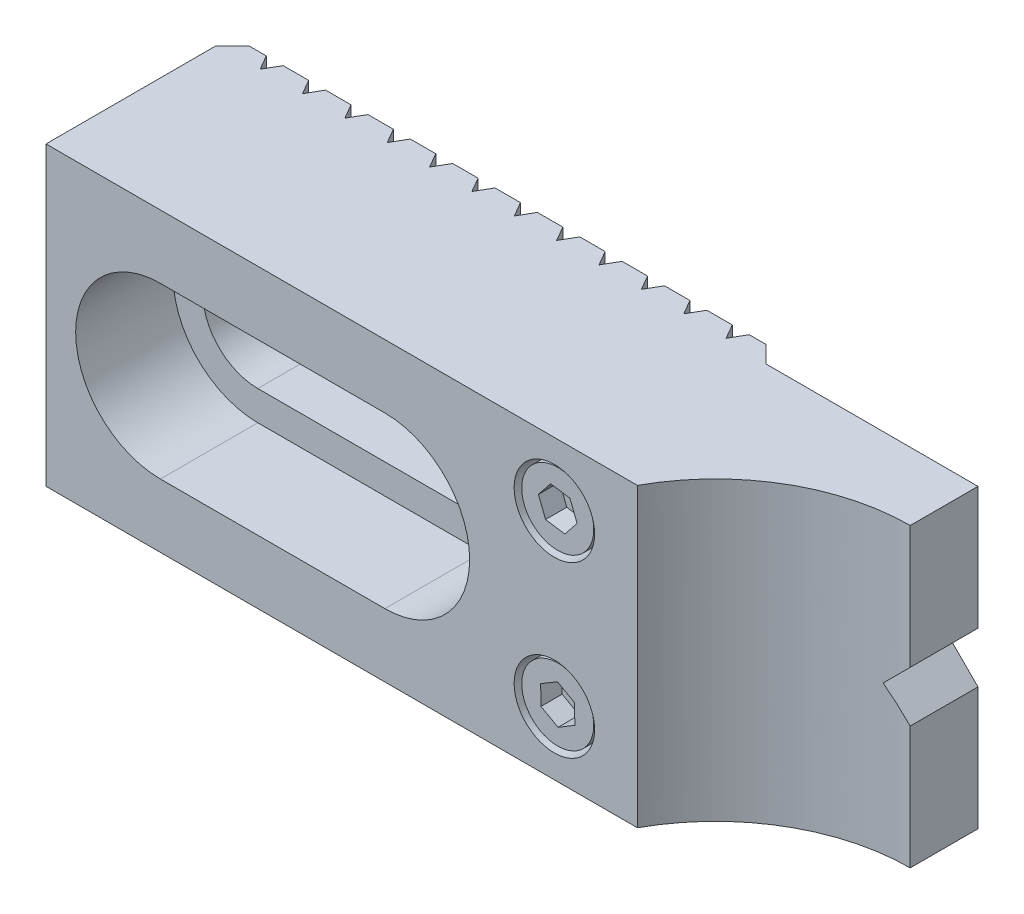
ISO-10303-21;
HEADER;
FILE_DESCRIPTION(('STEP AP214'),'2;1');
FILE_NAME('part.step','',(''),(''),'','','');
FILE_SCHEMA(('AUTOMOTIVE_DESIGN { 1 0 10303 214 1 1 1 1 }'));
ENDSEC;
DATA;
#1=APPLICATION_CONTEXT('core data for automotive mechanical design processes');
#2=APPLICATION_PROTOCOL_DEFINITION('international standard','automotive_design',2000,#1);
#3=PRODUCT_CONTEXT('',#1,'mechanical');
#4=PRODUCT('Part','Part','',(#3));
#5=PRODUCT_RELATED_PRODUCT_CATEGORY('part','',(#4));
#6=PRODUCT_DEFINITION_FORMATION('','',#4);
#7=PRODUCT_DEFINITION_CONTEXT('part definition',#1,'design');
#8=PRODUCT_DEFINITION('design','',#6,#7);
#9=PRODUCT_DEFINITION_SHAPE('','',#8);
#10=(LENGTH_UNIT() NAMED_UNIT(*) SI_UNIT(.MILLI.,.METRE.));
#11=(NAMED_UNIT(*) PLANE_ANGLE_UNIT() SI_UNIT($,.RADIAN.));
#12=(NAMED_UNIT(*) SI_UNIT($,.STERADIAN.) SOLID_ANGLE_UNIT());
#13=UNCERTAINTY_MEASURE_WITH_UNIT(LENGTH_MEASURE(1.E-05),#10,'distance_accuracy_value','');
#14=(GEOMETRIC_REPRESENTATION_CONTEXT(3) GLOBAL_UNCERTAINTY_ASSIGNED_CONTEXT((#13)) GLOBAL_UNIT_ASSIGNED_CONTEXT((#10,
#11,#12)) REPRESENTATION_CONTEXT('',''));
#15=CARTESIAN_POINT('',(0.,0.,0.));
#16=DIRECTION('',(0.,0.,1.));
#17=DIRECTION('',(1.,0.,0.));
#18=AXIS2_PLACEMENT_3D('',#15,#16,#17);
#19=CARTESIAN_POINT('',(9.0011840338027,-17.5,0.));
#20=DIRECTION('',(0.,0.,-1.));
#21=DIRECTION('',(-1.,0.,0.));
#22=AXIS2_PLACEMENT_3D('',#19,#20,#21);
#23=PLANE('',#22);
#24=DIRECTION('',(0.,-1.,0.));
#25=VECTOR('',#24,1.);
#26=CARTESIAN_POINT('',(-34.0011840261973,17.505,0.));
#27=LINE('',#26,#25);
#28=CARTESIAN_POINT('',(-34.0011840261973,13.0585416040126,0.));
#29=VERTEX_POINT('',#28);
#30=CARTESIAN_POINT('',(-34.0011840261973,-11.9093899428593,0.));
#31=VERTEX_POINT('',#30);
#32=EDGE_CURVE('E4261',#29,#31,#27,.T.);
#33=ORIENTED_EDGE('',*,*,#32,.F.);
#34=CARTESIAN_POINT('',(-34.0011840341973,13.0585416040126,0.));
#35=DIRECTION('',(0.,1.,0.));
#36=VECTOR('',#35,1.);
#37=LINE('',#34,#36);
#38=CARTESIAN_POINT('',(-34.0011840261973,17.5,0.));
#39=VERTEX_POINT('',#38);
#40=EDGE_CURVE('E931',#29,#39,#37,.T.);
#41=ORIENTED_EDGE('',*,*,#40,.T.);
#42=DIRECTION('',(1.,0.,0.));
#43=VECTOR('',#42,1.);
#44=CARTESIAN_POINT('',(-40.0000000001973,17.5,0.));
#45=LINE('',#44,#43);
#46=CARTESIAN_POINT('',(-30.9988159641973,17.5,0.));
#47=VERTEX_POINT('',#46);
#48=EDGE_CURVE('E1422',#47,#39,#45,.F.);
#49=ORIENTED_EDGE('',*,*,#48,.F.);
#50=CARTESIAN_POINT('',(-30.9988159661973,17.5,0.));
#51=DIRECTION('',(0.,-1.,0.));
#52=VECTOR('',#51,1.);
#53=LINE('',#50,#52);
#54=CARTESIAN_POINT('',(-30.9988159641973,13.0585416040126,0.));
#55=VERTEX_POINT('',#54);
#56=EDGE_CURVE('E945',#47,#55,#53,.T.);
#57=ORIENTED_EDGE('',*,*,#56,.T.);
#58=DIRECTION('',(0.,-1.,0.));
#59=VECTOR('',#58,1.);
#60=CARTESIAN_POINT('',(-30.9988159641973,17.505,0.));
#61=LINE('',#60,#59);
#62=CARTESIAN_POINT('',(-30.9988159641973,4.69155144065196,0.));
#63=VERTEX_POINT('',#62);
#64=EDGE_CURVE('E4265',#55,#63,#61,.T.);
#65=ORIENTED_EDGE('',*,*,#64,.T.);
#66=CARTESIAN_POINT('',(-26.5,0.,0.));
#67=DIRECTION('',(0.,0.,-1.));
#68=DIRECTION('',(-1.,0.,0.));
#69=AXIS2_PLACEMENT_3D('',#66,#67,#68);
#70=CIRCLE('',#69,6.5);
#71=CARTESIAN_POINT('',(-30.9988159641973,-4.69155144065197,0.));
#72=VERTEX_POINT('',#71);
#73=EDGE_CURVE('E1144',#72,#63,#70,.T.);
#74=ORIENTED_EDGE('',*,*,#73,.F.);
#75=CARTESIAN_POINT('',(-30.9988159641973,-11.9093899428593,0.));
#76=VERTEX_POINT('',#75);
#77=EDGE_CURVE('E4266',#72,#76,#61,.T.);
#78=ORIENTED_EDGE('',*,*,#77,.T.);
#79=CARTESIAN_POINT('',(-30.9988159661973,-11.9093899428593,0.));
#80=DIRECTION('',(0.,-1.,0.));
#81=VECTOR('',#80,1.);
#82=LINE('',#79,#81);
#83=CARTESIAN_POINT('',(-30.9988159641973,-17.5,0.));
#84=VERTEX_POINT('',#83);
#85=EDGE_CURVE('E957',#76,#84,#82,.T.);
#86=ORIENTED_EDGE('',*,*,#85,.T.);
#87=DIRECTION('',(-1.,0.,0.));
#88=VECTOR('',#87,1.);
#89=CARTESIAN_POINT('',(9.0011840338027,-17.5,0.));
#90=LINE('',#89,#88);
#91=CARTESIAN_POINT('',(-34.0011840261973,-17.5,0.));
#92=VERTEX_POINT('',#91);
#93=EDGE_CURVE('E1201',#84,#92,#90,.T.);
#94=ORIENTED_EDGE('',*,*,#93,.T.);
#95=CARTESIAN_POINT('',(-34.0011840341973,-17.5,0.));
#96=DIRECTION('',(0.,1.,0.));
#97=VECTOR('',#96,1.);
#98=LINE('',#95,#97);
#99=EDGE_CURVE('E969',#92,#31,#98,.T.);
#100=ORIENTED_EDGE('',*,*,#99,.T.);
#101=EDGE_LOOP('',(#33,#41,#49,#57,#65,#74,#78,#86,#94,#100));
#102=FACE_BOUND('',#101,.T.);
#103=ADVANCED_FACE('F14',(#102),#23,.T.);
#104=DIRECTION('',(0.,-1.,0.));
#105=VECTOR('',#104,1.);
#106=CARTESIAN_POINT('',(-29.001184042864,17.505,0.));
#107=LINE('',#106,#105);
#108=CARTESIAN_POINT('',(-29.001184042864,13.0585416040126,0.));
#109=VERTEX_POINT('',#108);
#110=CARTESIAN_POINT('',(-29.001184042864,5.99950651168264,0.));
#111=VERTEX_POINT('',#110);
#112=EDGE_CURVE('E4220',#109,#111,#107,.T.);
#113=ORIENTED_EDGE('',*,*,#112,.F.);
#114=CARTESIAN_POINT('',(-29.0011840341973,13.0585416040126,0.));
#115=DIRECTION('',(0.,1.,0.));
#116=VECTOR('',#115,1.);
#117=LINE('',#114,#116);
#118=CARTESIAN_POINT('',(-29.001184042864,17.5,0.));
#119=VERTEX_POINT('',#118);
#120=EDGE_CURVE('E2284',#109,#119,#117,.T.);
#121=ORIENTED_EDGE('',*,*,#120,.T.);
#122=DIRECTION('',(1.,0.,0.));
#123=VECTOR('',#122,1.);
#124=CARTESIAN_POINT('',(-40.0000000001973,17.5,0.));
#125=LINE('',#124,#123);
#126=CARTESIAN_POINT('',(-25.998815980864,17.5,0.));
#127=VERTEX_POINT('',#126);
#128=EDGE_CURVE('E1409',#127,#119,#125,.F.);
#129=ORIENTED_EDGE('',*,*,#128,.F.);
#130=CARTESIAN_POINT('',(-25.9988159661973,13.0585416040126,0.));
#131=DIRECTION('',(0.,1.,0.));
#132=VECTOR('',#131,1.);
#133=LINE('',#130,#132);
#134=CARTESIAN_POINT('',(-25.998815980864,13.0585416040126,0.));
#135=VERTEX_POINT('',#134);
#136=EDGE_CURVE('E2296',#135,#127,#133,.T.);
#137=ORIENTED_EDGE('',*,*,#136,.F.);
#138=DIRECTION('',(0.,-1.,0.));
#139=VECTOR('',#138,1.);
#140=CARTESIAN_POINT('',(-25.998815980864,17.505,0.));
#141=LINE('',#140,#139);
#142=CARTESIAN_POINT('',(-25.998815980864,6.5,0.));
#143=VERTEX_POINT('',#142);
#144=EDGE_CURVE('E4238',#135,#143,#141,.T.);
#145=ORIENTED_EDGE('',*,*,#144,.T.);
#146=DIRECTION('',(1.,0.,0.));
#147=VECTOR('',#146,1.);
#148=CARTESIAN_POINT('',(9.00118403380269,6.5,0.));
#149=LINE('',#148,#147);
#150=CARTESIAN_POINT('',(-26.5,6.5,0.));
#151=VERTEX_POINT('',#150);
#152=EDGE_CURVE('E1129',#151,#143,#149,.T.);
#153=ORIENTED_EDGE('',*,*,#152,.F.);
#154=EDGE_CURVE('E1137',#111,#151,#70,.T.);
#155=ORIENTED_EDGE('',*,*,#154,.F.);
#156=EDGE_LOOP('',(#113,#121,#129,#137,#145,#153,#155));
#157=FACE_BOUND('',#156,.T.);
#158=ADVANCED_FACE('F1835',(#157),#23,.T.);
#159=CARTESIAN_POINT('',(-29.001184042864,-5.99950651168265,0.));
#160=VERTEX_POINT('',#159);
#161=CARTESIAN_POINT('',(-29.0011840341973,-11.9093899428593,0.));
#162=VERTEX_POINT('',#161);
#163=EDGE_CURVE('E4233',#160,#162,#107,.T.);
#164=ORIENTED_EDGE('',*,*,#163,.F.);
#165=CARTESIAN_POINT('',(-26.5,-6.5,0.));
#166=VERTEX_POINT('',#165);
#167=EDGE_CURVE('E1140',#166,#160,#70,.T.);
#168=ORIENTED_EDGE('',*,*,#167,.F.);
#169=DIRECTION('',(-1.,0.,0.));
#170=VECTOR('',#169,1.);
#171=CARTESIAN_POINT('',(9.0011840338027,-6.5,0.));
#172=LINE('',#171,#170);
#173=CARTESIAN_POINT('',(-25.998815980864,-6.5,0.));
#174=VERTEX_POINT('',#173);
#175=EDGE_CURVE('E1143',#174,#166,#172,.T.);
#176=ORIENTED_EDGE('',*,*,#175,.F.);
#177=CARTESIAN_POINT('',(-25.998815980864,-11.9093899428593,0.));
#178=VERTEX_POINT('',#177);
#179=EDGE_CURVE('E4236',#174,#178,#141,.T.);
#180=ORIENTED_EDGE('',*,*,#179,.T.);
#181=CARTESIAN_POINT('',(-25.9988159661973,-11.9093899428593,0.));
#182=DIRECTION('',(0.,-1.,0.));
#183=VECTOR('',#182,1.);
#184=LINE('',#181,#183);
#185=CARTESIAN_POINT('',(-25.998815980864,-17.5,0.));
#186=VERTEX_POINT('',#185);
#187=EDGE_CURVE('E982',#178,#186,#184,.T.);
#188=ORIENTED_EDGE('',*,*,#187,.T.);
#189=DIRECTION('',(-1.,0.,0.));
#190=VECTOR('',#189,1.);
#191=CARTESIAN_POINT('',(9.0011840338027,-17.5,0.));
#192=LINE('',#191,#190);
#193=CARTESIAN_POINT('',(-29.001184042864,-17.5,0.));
#194=VERTEX_POINT('',#193);
#195=EDGE_CURVE('E1195',#186,#194,#192,.T.);
#196=ORIENTED_EDGE('',*,*,#195,.T.);
#197=CARTESIAN_POINT('',(-29.0011840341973,-17.5,0.));
#198=DIRECTION('',(0.,1.,0.));
#199=VECTOR('',#198,1.);
#200=LINE('',#197,#199);
#201=EDGE_CURVE('E995',#194,#162,#200,.T.);
#202=ORIENTED_EDGE('',*,*,#201,.T.);
#203=EDGE_LOOP('',(#164,#168,#176,#180,#188,#196,#202));
#204=FACE_BOUND('',#203,.T.);
#205=ADVANCED_FACE('F1832',(#204),#23,.T.);
#206=DIRECTION('',(0.,-1.,0.));
#207=VECTOR('',#206,1.);
#208=CARTESIAN_POINT('',(-24.0011840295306,17.505,0.));
#209=LINE('',#208,#207);
#210=CARTESIAN_POINT('',(-24.0011840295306,13.0585416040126,0.));
#211=VERTEX_POINT('',#210);
#212=CARTESIAN_POINT('',(-24.0011840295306,6.5,0.));
#213=VERTEX_POINT('',#212);
#214=EDGE_CURVE('E5121',#211,#213,#209,.T.);
#215=ORIENTED_EDGE('',*,*,#214,.F.);
#216=CARTESIAN_POINT('',(-24.0011840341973,13.0585416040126,0.));
#217=DIRECTION('',(0.,1.,0.));
#218=VECTOR('',#217,1.);
#219=LINE('',#216,#218);
#220=CARTESIAN_POINT('',(-24.0011840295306,17.5,0.));
#221=VERTEX_POINT('',#220);
#222=EDGE_CURVE('E1656',#211,#221,#219,.T.);
#223=ORIENTED_EDGE('',*,*,#222,.T.);
#224=DIRECTION('',(1.,0.,0.));
#225=VECTOR('',#224,1.);
#226=CARTESIAN_POINT('',(-40.0000000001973,17.5,0.));
#227=LINE('',#226,#225);
#228=CARTESIAN_POINT('',(-20.9988159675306,17.5,0.));
#229=VERTEX_POINT('',#228);
#230=EDGE_CURVE('E1395',#229,#221,#227,.F.);
#231=ORIENTED_EDGE('',*,*,#230,.F.);
#232=CARTESIAN_POINT('',(-20.9988159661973,13.0585416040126,0.));
#233=DIRECTION('',(0.,1.,0.));
#234=VECTOR('',#233,1.);
#235=LINE('',#232,#234);
#236=CARTESIAN_POINT('',(-20.9988159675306,13.0585416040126,0.));
#237=VERTEX_POINT('',#236);
#238=EDGE_CURVE('E1654',#237,#229,#235,.T.);
#239=ORIENTED_EDGE('',*,*,#238,.F.);
#240=DIRECTION('',(0.,-1.,0.));
#241=VECTOR('',#240,1.);
#242=CARTESIAN_POINT('',(-20.9988159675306,17.505,0.));
#243=LINE('',#242,#241);
#244=CARTESIAN_POINT('',(-20.9988159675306,6.5,0.));
#245=VERTEX_POINT('',#244);
#246=EDGE_CURVE('E2413',#237,#245,#243,.T.);
#247=ORIENTED_EDGE('',*,*,#246,.T.);
#248=EDGE_CURVE('E1138',#213,#245,#149,.T.);
#249=ORIENTED_EDGE('',*,*,#248,.F.);
#250=EDGE_LOOP('',(#215,#223,#231,#239,#247,#249));
#251=FACE_BOUND('',#250,.T.);
#252=ADVANCED_FACE('F1823',(#251),#23,.T.);
#253=CARTESIAN_POINT('',(-24.0011840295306,-6.5,0.));
#254=VERTEX_POINT('',#253);
#255=CARTESIAN_POINT('',(-24.0011840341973,-11.9093899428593,0.));
#256=VERTEX_POINT('',#255);
#257=EDGE_CURVE('E1814',#254,#256,#209,.T.);
#258=ORIENTED_EDGE('',*,*,#257,.F.);
#259=CARTESIAN_POINT('',(-20.9988159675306,-6.5,0.));
#260=VERTEX_POINT('',#259);
#261=EDGE_CURVE('E1146',#260,#254,#172,.T.);
#262=ORIENTED_EDGE('',*,*,#261,.F.);
#263=CARTESIAN_POINT('',(-20.9988159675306,-11.9093899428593,0.));
#264=VERTEX_POINT('',#263);
#265=EDGE_CURVE('E5137',#260,#264,#243,.T.);
#266=ORIENTED_EDGE('',*,*,#265,.T.);
#267=CARTESIAN_POINT('',(-20.9988159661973,-11.9093899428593,0.));
#268=DIRECTION('',(0.,-1.,0.));
#269=VECTOR('',#268,1.);
#270=LINE('',#267,#269);
#271=CARTESIAN_POINT('',(-20.9988159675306,-17.5,0.));
#272=VERTEX_POINT('',#271);
#273=EDGE_CURVE('E1008',#264,#272,#270,.T.);
#274=ORIENTED_EDGE('',*,*,#273,.T.);
#275=DIRECTION('',(-1.,0.,0.));
#276=VECTOR('',#275,1.);
#277=CARTESIAN_POINT('',(9.0011840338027,-17.5,0.));
#278=LINE('',#277,#276);
#279=CARTESIAN_POINT('',(-24.0011840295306,-17.5,0.));
#280=VERTEX_POINT('',#279);
#281=EDGE_CURVE('E1189',#272,#280,#278,.T.);
#282=ORIENTED_EDGE('',*,*,#281,.T.);
#283=CARTESIAN_POINT('',(-24.0011840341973,-17.5,0.));
#284=DIRECTION('',(0.,1.,0.));
#285=VECTOR('',#284,1.);
#286=LINE('',#283,#285);
#287=EDGE_CURVE('E1021',#280,#256,#286,.T.);
#288=ORIENTED_EDGE('',*,*,#287,.T.);
#289=EDGE_LOOP('',(#258,#262,#266,#274,#282,#288));
#290=FACE_BOUND('',#289,.T.);
#291=ADVANCED_FACE('F1818',(#290),#23,.T.);
#292=DIRECTION('',(0.,-1.,0.));
#293=VECTOR('',#292,1.);
#294=CARTESIAN_POINT('',(-19.0011840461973,17.505,0.));
#295=LINE('',#294,#293);
#296=CARTESIAN_POINT('',(-19.0011840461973,13.0585416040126,0.));
#297=VERTEX_POINT('',#296);
#298=CARTESIAN_POINT('',(-19.0011840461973,6.5,0.));
#299=VERTEX_POINT('',#298);
#300=EDGE_CURVE('E4090',#297,#299,#295,.T.);
#301=ORIENTED_EDGE('',*,*,#300,.F.);
#302=CARTESIAN_POINT('',(-19.0011840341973,13.0585416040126,0.));
#303=DIRECTION('',(0.,1.,0.));
#304=VECTOR('',#303,1.);
#305=LINE('',#302,#304);
#306=CARTESIAN_POINT('',(-19.0011840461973,17.5,0.));
#307=VERTEX_POINT('',#306);
#308=EDGE_CURVE('E1649',#297,#307,#305,.T.);
#309=ORIENTED_EDGE('',*,*,#308,.T.);
#310=DIRECTION('',(1.,0.,0.));
#311=VECTOR('',#310,1.);
#312=CARTESIAN_POINT('',(-40.0000000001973,17.5,0.));
#313=LINE('',#312,#311);
#314=CARTESIAN_POINT('',(-15.9988159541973,17.5,0.));
#315=VERTEX_POINT('',#314);
#316=EDGE_CURVE('E1380',#315,#307,#313,.F.);
#317=ORIENTED_EDGE('',*,*,#316,.F.);
#318=CARTESIAN_POINT('',(-15.9988159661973,13.0585416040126,0.));
#319=DIRECTION('',(0.,1.,0.));
#320=VECTOR('',#319,1.);
#321=LINE('',#318,#320);
#322=CARTESIAN_POINT('',(-15.9988159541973,13.0585416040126,0.));
#323=VERTEX_POINT('',#322);
#324=EDGE_CURVE('E2393',#323,#315,#321,.T.);
#325=ORIENTED_EDGE('',*,*,#324,.F.);
#326=DIRECTION('',(0.,-1.,0.));
#327=VECTOR('',#326,1.);
#328=CARTESIAN_POINT('',(-15.9988159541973,17.505,0.));
#329=LINE('',#328,#327);
#330=CARTESIAN_POINT('',(-15.9988159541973,6.5,0.));
#331=VERTEX_POINT('',#330);
#332=EDGE_CURVE('E4087',#323,#331,#329,.T.);
#333=ORIENTED_EDGE('',*,*,#332,.T.);
#334=EDGE_CURVE('E4092',#299,#331,#149,.T.);
#335=ORIENTED_EDGE('',*,*,#334,.F.);
#336=EDGE_LOOP('',(#301,#309,#317,#325,#333,#335));
#337=FACE_BOUND('',#336,.T.);
#338=ADVANCED_FACE('F1822',(#337),#23,.T.);
#339=CARTESIAN_POINT('',(-19.0011840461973,-6.5,0.));
#340=VERTEX_POINT('',#339);
#341=CARTESIAN_POINT('',(-19.0011840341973,-11.9093899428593,0.));
#342=VERTEX_POINT('',#341);
#343=EDGE_CURVE('E4095',#340,#342,#295,.T.);
#344=ORIENTED_EDGE('',*,*,#343,.F.);
#345=CARTESIAN_POINT('',(-15.9988159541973,-6.5,0.));
#346=VERTEX_POINT('',#345);
#347=EDGE_CURVE('E5180',#346,#340,#172,.T.);
#348=ORIENTED_EDGE('',*,*,#347,.F.);
#349=CARTESIAN_POINT('',(-15.9988159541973,-11.9093899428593,0.));
#350=VERTEX_POINT('',#349);
#351=EDGE_CURVE('E4117',#346,#350,#329,.T.);
#352=ORIENTED_EDGE('',*,*,#351,.T.);
#353=CARTESIAN_POINT('',(-15.9988159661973,-11.9093899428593,0.));
#354=DIRECTION('',(0.,-1.,0.));
#355=VECTOR('',#354,1.);
#356=LINE('',#353,#355);
#357=CARTESIAN_POINT('',(-15.9988159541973,-17.5,0.));
#358=VERTEX_POINT('',#357);
#359=EDGE_CURVE('E1034',#350,#358,#356,.T.);
#360=ORIENTED_EDGE('',*,*,#359,.T.);
#361=DIRECTION('',(-1.,0.,0.));
#362=VECTOR('',#361,1.);
#363=CARTESIAN_POINT('',(9.0011840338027,-17.5,0.));
#364=LINE('',#363,#362);
#365=CARTESIAN_POINT('',(-19.0011840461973,-17.5,0.));
#366=VERTEX_POINT('',#365);
#367=EDGE_CURVE('E1183',#358,#366,#364,.T.);
#368=ORIENTED_EDGE('',*,*,#367,.T.);
#369=CARTESIAN_POINT('',(-19.0011840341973,-17.5,0.));
#370=DIRECTION('',(0.,1.,0.));
#371=VECTOR('',#370,1.);
#372=LINE('',#369,#371);
#373=EDGE_CURVE('E1047',#366,#342,#372,.T.);
#374=ORIENTED_EDGE('',*,*,#373,.T.);
#375=EDGE_LOOP('',(#344,#348,#352,#360,#368,#374));
#376=FACE_BOUND('',#375,.T.);
#377=ADVANCED_FACE('F1830',(#376),#23,.T.);
#378=DIRECTION('',(0.,-1.,0.));
#379=VECTOR('',#378,1.);
#380=CARTESIAN_POINT('',(-14.0011840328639,17.505,0.));
#381=LINE('',#380,#379);
#382=CARTESIAN_POINT('',(-14.0011840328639,13.0585416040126,0.));
#383=VERTEX_POINT('',#382);
#384=CARTESIAN_POINT('',(-14.0011840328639,6.5,0.));
#385=VERTEX_POINT('',#384);
#386=EDGE_CURVE('E4131',#383,#385,#381,.T.);
#387=ORIENTED_EDGE('',*,*,#386,.F.);
#388=CARTESIAN_POINT('',(-14.0011840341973,13.0585416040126,0.));
#389=DIRECTION('',(0.,1.,0.));
#390=VECTOR('',#389,1.);
#391=LINE('',#388,#390);
#392=CARTESIAN_POINT('',(-14.0011840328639,17.5,0.));
#393=VERTEX_POINT('',#392);
#394=EDGE_CURVE('E2359',#383,#393,#391,.T.);
#395=ORIENTED_EDGE('',*,*,#394,.T.);
#396=DIRECTION('',(1.,0.,0.));
#397=VECTOR('',#396,1.);
#398=CARTESIAN_POINT('',(-40.0000000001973,17.5,0.));
#399=LINE('',#398,#397);
#400=CARTESIAN_POINT('',(-10.9988159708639,17.5,0.));
#401=VERTEX_POINT('',#400);
#402=EDGE_CURVE('E1365',#401,#393,#399,.F.);
#403=ORIENTED_EDGE('',*,*,#402,.F.);
#404=CARTESIAN_POINT('',(-10.9988159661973,13.0585416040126,0.));
#405=DIRECTION('',(0.,1.,0.));
#406=VECTOR('',#405,1.);
#407=LINE('',#404,#406);
#408=CARTESIAN_POINT('',(-10.9988159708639,13.0585416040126,0.));
#409=VERTEX_POINT('',#408);
#410=EDGE_CURVE('E2371',#409,#401,#407,.T.);
#411=ORIENTED_EDGE('',*,*,#410,.F.);
#412=DIRECTION('',(0.,-1.,0.));
#413=VECTOR('',#412,1.);
#414=CARTESIAN_POINT('',(-10.9988159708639,17.505,0.));
#415=LINE('',#414,#413);
#416=CARTESIAN_POINT('',(-10.9988159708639,6.5,0.));
#417=VERTEX_POINT('',#416);
#418=EDGE_CURVE('E4135',#409,#417,#415,.T.);
#419=ORIENTED_EDGE('',*,*,#418,.T.);
#420=EDGE_CURVE('E5112',#385,#417,#149,.T.);
#421=ORIENTED_EDGE('',*,*,#420,.F.);
#422=EDGE_LOOP('',(#387,#395,#403,#411,#419,#421));
#423=FACE_BOUND('',#422,.T.);
#424=ADVANCED_FACE('F5264',(#423),#23,.T.);
#425=CARTESIAN_POINT('',(-14.0011840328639,-6.5,0.));
#426=VERTEX_POINT('',#425);
#427=CARTESIAN_POINT('',(-14.0011840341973,-11.9093899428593,0.));
#428=VERTEX_POINT('',#427);
#429=EDGE_CURVE('E4133',#426,#428,#381,.T.);
#430=ORIENTED_EDGE('',*,*,#429,.F.);
#431=CARTESIAN_POINT('',(-10.9988159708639,-6.5,0.));
#432=VERTEX_POINT('',#431);
#433=EDGE_CURVE('E5177',#432,#426,#172,.T.);
#434=ORIENTED_EDGE('',*,*,#433,.F.);
#435=CARTESIAN_POINT('',(-10.9988159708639,-11.9093899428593,0.));
#436=VERTEX_POINT('',#435);
#437=EDGE_CURVE('E4146',#432,#436,#415,.T.);
#438=ORIENTED_EDGE('',*,*,#437,.T.);
#439=CARTESIAN_POINT('',(-10.9988159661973,-11.9093899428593,0.));
#440=DIRECTION('',(0.,-1.,0.));
#441=VECTOR('',#440,1.);
#442=LINE('',#439,#441);
#443=CARTESIAN_POINT('',(-10.9988159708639,-17.5,0.));
#444=VERTEX_POINT('',#443);
#445=EDGE_CURVE('E1060',#436,#444,#442,.T.);
#446=ORIENTED_EDGE('',*,*,#445,.T.);
#447=DIRECTION('',(-1.,0.,0.));
#448=VECTOR('',#447,1.);
#449=CARTESIAN_POINT('',(9.0011840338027,-17.5,0.));
#450=LINE('',#449,#448);
#451=CARTESIAN_POINT('',(-14.0011840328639,-17.5,0.));
#452=VERTEX_POINT('',#451);
#453=EDGE_CURVE('E1177',#444,#452,#450,.T.);
#454=ORIENTED_EDGE('',*,*,#453,.T.);
#455=CARTESIAN_POINT('',(-14.0011840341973,-17.5,0.));
#456=DIRECTION('',(0.,1.,0.));
#457=VECTOR('',#456,1.);
#458=LINE('',#455,#457);
#459=EDGE_CURVE('E1073',#452,#428,#458,.T.);
#460=ORIENTED_EDGE('',*,*,#459,.T.);
#461=EDGE_LOOP('',(#430,#434,#438,#446,#454,#460));
#462=FACE_BOUND('',#461,.T.);
#463=ADVANCED_FACE('F5261',(#462),#23,.T.);
#464=DIRECTION('',(0.,-1.,0.));
#465=VECTOR('',#464,1.);
#466=CARTESIAN_POINT('',(-9.00118401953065,17.505,0.));
#467=LINE('',#466,#465);
#468=CARTESIAN_POINT('',(-9.00118401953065,13.0585416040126,0.));
#469=VERTEX_POINT('',#468);
#470=CARTESIAN_POINT('',(-9.00118401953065,6.5,0.));
#471=VERTEX_POINT('',#470);
#472=EDGE_CURVE('E4161',#469,#471,#467,.T.);
#473=ORIENTED_EDGE('',*,*,#472,.F.);
#474=CARTESIAN_POINT('',(-9.0011840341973,13.0585416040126,0.));
#475=DIRECTION('',(0.,1.,0.));
#476=VECTOR('',#475,1.);
#477=LINE('',#474,#476);
#478=CARTESIAN_POINT('',(-9.00118401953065,17.5,0.));
#479=VERTEX_POINT('',#478);
#480=EDGE_CURVE('E2334',#469,#479,#477,.T.);
#481=ORIENTED_EDGE('',*,*,#480,.T.);
#482=DIRECTION('',(1.,0.,0.));
#483=VECTOR('',#482,1.);
#484=CARTESIAN_POINT('',(-40.0000000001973,17.5,0.));
#485=LINE('',#484,#483);
#486=CARTESIAN_POINT('',(-5.99881595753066,17.5,0.));
#487=VERTEX_POINT('',#486);
#488=EDGE_CURVE('E1350',#487,#479,#485,.F.);
#489=ORIENTED_EDGE('',*,*,#488,.F.);
#490=CARTESIAN_POINT('',(-5.9988159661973,13.0585416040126,0.));
#491=DIRECTION('',(0.,1.,0.));
#492=VECTOR('',#491,1.);
#493=LINE('',#490,#492);
#494=CARTESIAN_POINT('',(-5.99881595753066,13.0585416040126,0.));
#495=VERTEX_POINT('',#494);
#496=EDGE_CURVE('E2346',#495,#487,#493,.T.);
#497=ORIENTED_EDGE('',*,*,#496,.F.);
#498=DIRECTION('',(0.,-1.,0.));
#499=VECTOR('',#498,1.);
#500=CARTESIAN_POINT('',(-5.99881595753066,17.505,0.));
#501=LINE('',#500,#499);
#502=CARTESIAN_POINT('',(-5.99881595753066,6.5,0.));
#503=VERTEX_POINT('',#502);
#504=EDGE_CURVE('E4165',#495,#503,#501,.T.);
#505=ORIENTED_EDGE('',*,*,#504,.T.);
#506=EDGE_CURVE('E5108',#471,#503,#149,.T.);
#507=ORIENTED_EDGE('',*,*,#506,.F.);
#508=EDGE_LOOP('',(#473,#481,#489,#497,#505,#507));
#509=FACE_BOUND('',#508,.T.);
#510=ADVANCED_FACE('F5263',(#509),#23,.T.);
#511=CARTESIAN_POINT('',(-9.00118401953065,-6.5,0.));
#512=VERTEX_POINT('',#511);
#513=CARTESIAN_POINT('',(-9.0011840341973,-11.9093899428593,0.));
#514=VERTEX_POINT('',#513);
#515=EDGE_CURVE('E4163',#512,#514,#467,.T.);
#516=ORIENTED_EDGE('',*,*,#515,.F.);
#517=CARTESIAN_POINT('',(-5.99881595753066,-6.5,0.));
#518=VERTEX_POINT('',#517);
#519=EDGE_CURVE('E5175',#518,#512,#172,.T.);
#520=ORIENTED_EDGE('',*,*,#519,.F.);
#521=CARTESIAN_POINT('',(-5.99881595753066,-11.9093899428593,0.));
#522=VERTEX_POINT('',#521);
#523=EDGE_CURVE('E4176',#518,#522,#501,.T.);
#524=ORIENTED_EDGE('',*,*,#523,.T.);
#525=CARTESIAN_POINT('',(-5.9988159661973,-11.9093899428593,0.));
#526=DIRECTION('',(0.,-1.,0.));
#527=VECTOR('',#526,1.);
#528=LINE('',#525,#527);
#529=CARTESIAN_POINT('',(-5.99881595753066,-17.5,0.));
#530=VERTEX_POINT('',#529);
#531=EDGE_CURVE('E1086',#522,#530,#528,.T.);
#532=ORIENTED_EDGE('',*,*,#531,.T.);
#533=DIRECTION('',(-1.,0.,0.));
#534=VECTOR('',#533,1.);
#535=CARTESIAN_POINT('',(9.0011840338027,-17.5,0.));
#536=LINE('',#535,#534);
#537=CARTESIAN_POINT('',(-9.00118401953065,-17.5,0.));
#538=VERTEX_POINT('',#537);
#539=EDGE_CURVE('E1171',#530,#538,#536,.T.);
#540=ORIENTED_EDGE('',*,*,#539,.T.);
#541=CARTESIAN_POINT('',(-9.0011840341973,-17.5,0.));
#542=DIRECTION('',(0.,1.,0.));
#543=VECTOR('',#542,1.);
#544=LINE('',#541,#543);
#545=EDGE_CURVE('E1099',#538,#514,#544,.T.);
#546=ORIENTED_EDGE('',*,*,#545,.T.);
#547=EDGE_LOOP('',(#516,#520,#524,#532,#540,#546));
#548=FACE_BOUND('',#547,.T.);
#549=ADVANCED_FACE('F5270',(#548),#23,.T.);
#550=DIRECTION('',(0.,-1.,0.));
#551=VECTOR('',#550,1.);
#552=CARTESIAN_POINT('',(-4.0011840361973,17.505,0.));
#553=LINE('',#552,#551);
#554=CARTESIAN_POINT('',(-4.0011840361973,13.0585416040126,0.));
#555=VERTEX_POINT('',#554);
#556=CARTESIAN_POINT('',(-4.0011840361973,6.5,0.));
#557=VERTEX_POINT('',#556);
#558=EDGE_CURVE('E4191',#555,#557,#553,.T.);
#559=ORIENTED_EDGE('',*,*,#558,.F.);
#560=CARTESIAN_POINT('',(-4.0011840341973,13.0585416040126,0.));
#561=DIRECTION('',(0.,1.,0.));
#562=VECTOR('',#561,1.);
#563=LINE('',#560,#562);
#564=CARTESIAN_POINT('',(-4.0011840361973,17.5,0.));
#565=VERTEX_POINT('',#564);
#566=EDGE_CURVE('E2309',#555,#565,#563,.T.);
#567=ORIENTED_EDGE('',*,*,#566,.T.);
#568=DIRECTION('',(1.,0.,0.));
#569=VECTOR('',#568,1.);
#570=CARTESIAN_POINT('',(-40.0000000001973,17.5,0.));
#571=LINE('',#570,#569);
#572=CARTESIAN_POINT('',(-0.998815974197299,17.5,0.));
#573=VERTEX_POINT('',#572);
#574=EDGE_CURVE('E1335',#573,#565,#571,.F.);
#575=ORIENTED_EDGE('',*,*,#574,.F.);
#576=CARTESIAN_POINT('',(-0.998815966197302,13.0585416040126,0.));
#577=DIRECTION('',(0.,1.,0.));
#578=VECTOR('',#577,1.);
#579=LINE('',#576,#578);
#580=CARTESIAN_POINT('',(-0.998815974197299,13.0585416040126,0.));
#581=VERTEX_POINT('',#580);
#582=EDGE_CURVE('E2321',#581,#573,#579,.T.);
#583=ORIENTED_EDGE('',*,*,#582,.F.);
#584=DIRECTION('',(0.,-1.,0.));
#585=VECTOR('',#584,1.);
#586=CARTESIAN_POINT('',(-0.998815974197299,17.505,0.));
#587=LINE('',#586,#585);
#588=CARTESIAN_POINT('',(-0.998815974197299,6.5,0.));
#589=VERTEX_POINT('',#588);
#590=EDGE_CURVE('E4195',#581,#589,#587,.T.);
#591=ORIENTED_EDGE('',*,*,#590,.T.);
#592=EDGE_CURVE('E1139',#557,#589,#149,.T.);
#593=ORIENTED_EDGE('',*,*,#592,.F.);
#594=EDGE_LOOP('',(#559,#567,#575,#583,#591,#593));
#595=FACE_BOUND('',#594,.T.);
#596=ADVANCED_FACE('F5696',(#595),#23,.T.);
#597=CARTESIAN_POINT('',(-4.0011840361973,-6.5,0.));
#598=VERTEX_POINT('',#597);
#599=CARTESIAN_POINT('',(-4.0011840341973,-11.9093899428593,0.));
#600=VERTEX_POINT('',#599);
#601=EDGE_CURVE('E4193',#598,#600,#553,.T.);
#602=ORIENTED_EDGE('',*,*,#601,.F.);
#603=CARTESIAN_POINT('',(-0.998815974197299,-6.5,0.));
#604=VERTEX_POINT('',#603);
#605=EDGE_CURVE('E1147',#604,#598,#172,.T.);
#606=ORIENTED_EDGE('',*,*,#605,.F.);
#607=CARTESIAN_POINT('',(-0.998815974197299,-11.9093899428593,0.));
#608=VERTEX_POINT('',#607);
#609=EDGE_CURVE('E4205',#604,#608,#587,.T.);
#610=ORIENTED_EDGE('',*,*,#609,.T.);
#611=CARTESIAN_POINT('',(-0.998815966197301,-11.9093899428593,0.));
#612=DIRECTION('',(0.,-1.,0.));
#613=VECTOR('',#612,1.);
#614=LINE('',#611,#613);
#615=CARTESIAN_POINT('',(-0.998815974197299,-17.5,0.));
#616=VERTEX_POINT('',#615);
#617=EDGE_CURVE('E1112',#608,#616,#614,.T.);
#618=ORIENTED_EDGE('',*,*,#617,.T.);
#619=DIRECTION('',(-1.,0.,0.));
#620=VECTOR('',#619,1.);
#621=CARTESIAN_POINT('',(9.0011840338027,-17.5,0.));
#622=LINE('',#621,#620);
#623=CARTESIAN_POINT('',(-4.0011840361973,-17.5,0.));
#624=VERTEX_POINT('',#623);
#625=EDGE_CURVE('E1165',#616,#624,#622,.T.);
#626=ORIENTED_EDGE('',*,*,#625,.T.);
#627=CARTESIAN_POINT('',(-4.0011840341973,-17.5,0.));
#628=DIRECTION('',(0.,1.,0.));
#629=VECTOR('',#628,1.);
#630=LINE('',#627,#629);
#631=EDGE_CURVE('E1125',#624,#600,#630,.T.);
#632=ORIENTED_EDGE('',*,*,#631,.T.);
#633=EDGE_LOOP('',(#602,#606,#610,#618,#626,#632));
#634=FACE_BOUND('',#633,.T.);
#635=ADVANCED_FACE('F5171',(#634),#23,.T.);
#636=DIRECTION('',(0.,-1.,0.));
#637=VECTOR('',#636,1.);
#638=CARTESIAN_POINT('',(0.998815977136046,17.505,0.));
#639=LINE('',#638,#637);
#640=CARTESIAN_POINT('',(0.998815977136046,13.0585416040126,0.));
#641=VERTEX_POINT('',#640);
#642=CARTESIAN_POINT('',(0.998815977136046,6.42280052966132,0.));
#643=VERTEX_POINT('',#642);
#644=EDGE_CURVE('E4304',#641,#643,#639,.T.);
#645=ORIENTED_EDGE('',*,*,#644,.F.);
#646=CARTESIAN_POINT('',(0.998815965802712,13.0585416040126,0.));
#647=DIRECTION('',(0.,1.,0.));
#648=VECTOR('',#647,1.);
#649=LINE('',#646,#648);
#650=CARTESIAN_POINT('',(0.998815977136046,17.5,0.));
#651=VERTEX_POINT('',#650);
#652=EDGE_CURVE('E2235',#641,#651,#649,.T.);
#653=ORIENTED_EDGE('',*,*,#652,.T.);
#654=DIRECTION('',(-1.,0.,0.));
#655=VECTOR('',#654,1.);
#656=CARTESIAN_POINT('',(9.0011840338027,17.5,0.));
#657=LINE('',#656,#655);
#658=CARTESIAN_POINT('',(4.00118403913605,17.5,0.));
#659=VERTEX_POINT('',#658);
#660=EDGE_CURVE('E1322',#651,#659,#657,.F.);
#661=ORIENTED_EDGE('',*,*,#660,.T.);
#662=CARTESIAN_POINT('',(4.0011840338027,17.5,0.));
#663=DIRECTION('',(0.,-1.,0.));
#664=VECTOR('',#663,1.);
#665=LINE('',#662,#664);
#666=CARTESIAN_POINT('',(4.00118403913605,13.0585416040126,0.));
#667=VERTEX_POINT('',#666);
#668=EDGE_CURVE('E1324',#659,#667,#665,.T.);
#669=ORIENTED_EDGE('',*,*,#668,.T.);
#670=DIRECTION('',(0.,-1.,0.));
#671=VECTOR('',#670,1.);
#672=CARTESIAN_POINT('',(4.00118403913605,17.505,0.));
#673=LINE('',#672,#671);
#674=CARTESIAN_POINT('',(4.00118403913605,5.12255075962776,0.));
#675=VERTEX_POINT('',#674);
#676=EDGE_CURVE('E4294',#667,#675,#673,.T.);
#677=ORIENTED_EDGE('',*,*,#676,.T.);
#678=CARTESIAN_POINT('',(0.,0.,0.));
#679=DIRECTION('',(0.,0.,-1.));
#680=DIRECTION('',(-1.,0.,0.));
#681=AXIS2_PLACEMENT_3D('',#678,#679,#680);
#682=CIRCLE('',#681,6.5);
#683=EDGE_CURVE('E24',#643,#675,#682,.T.);
#684=ORIENTED_EDGE('',*,*,#683,.F.);
#685=EDGE_LOOP('',(#645,#653,#661,#669,#677,#684));
#686=FACE_BOUND('',#685,.T.);
#687=ADVANCED_FACE('F5681',(#686),#23,.T.);
#688=CARTESIAN_POINT('',(0.998815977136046,-6.42280052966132,0.));
#689=VERTEX_POINT('',#688);
#690=CARTESIAN_POINT('',(0.998815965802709,-11.9093899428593,0.));
#691=VERTEX_POINT('',#690);
#692=EDGE_CURVE('E4296',#689,#691,#639,.T.);
#693=ORIENTED_EDGE('',*,*,#692,.F.);
#694=CARTESIAN_POINT('',(4.00118403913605,-5.12255075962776,0.));
#695=VERTEX_POINT('',#694);
#696=EDGE_CURVE('E1148',#695,#689,#682,.T.);
#697=ORIENTED_EDGE('',*,*,#696,.F.);
#698=CARTESIAN_POINT('',(4.00118403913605,-11.9093899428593,0.));
#699=VERTEX_POINT('',#698);
#700=EDGE_CURVE('E4062',#695,#699,#673,.T.);
#701=ORIENTED_EDGE('',*,*,#700,.T.);
#702=CARTESIAN_POINT('',(4.0011840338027,-17.5,0.));
#703=DIRECTION('',(0.,1.,0.));
#704=VECTOR('',#703,1.);
#705=LINE('',#702,#704);
#706=CARTESIAN_POINT('',(4.00118403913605,-17.5,0.));
#707=VERTEX_POINT('',#706);
#708=EDGE_CURVE('E1475',#707,#699,#705,.T.);
#709=ORIENTED_EDGE('',*,*,#708,.F.);
#710=DIRECTION('',(-1.,0.,0.));
#711=VECTOR('',#710,1.);
#712=CARTESIAN_POINT('',(9.0011840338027,-17.5,0.));
#713=LINE('',#712,#711);
#714=CARTESIAN_POINT('',(0.998815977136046,-17.5,0.));
#715=VERTEX_POINT('',#714);
#716=EDGE_CURVE('E1158',#707,#715,#713,.T.);
#717=ORIENTED_EDGE('',*,*,#716,.T.);
#718=CARTESIAN_POINT('',(0.998815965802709,-17.5,0.));
#719=DIRECTION('',(0.,1.,0.));
#720=VECTOR('',#719,1.);
#721=LINE('',#718,#720);
#722=EDGE_CURVE('E2272',#715,#691,#721,.T.);
#723=ORIENTED_EDGE('',*,*,#722,.T.);
#724=EDGE_LOOP('',(#693,#697,#701,#709,#717,#723));
#725=FACE_BOUND('',#724,.T.);
#726=ADVANCED_FACE('F1859',(#725),#23,.T.);
#727=DIRECTION('',(0.,-1.,0.));
#728=VECTOR('',#727,1.);
#729=CARTESIAN_POINT('',(5.9988159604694,17.505,0.));
#730=LINE('',#729,#728);
#731=CARTESIAN_POINT('',(5.9988159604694,13.0585416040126,0.));
#732=VERTEX_POINT('',#731);
#733=CARTESIAN_POINT('',(5.9988159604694,2.5028398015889,0.));
#734=VERTEX_POINT('',#733);
#735=EDGE_CURVE('E4244',#732,#734,#730,.T.);
#736=ORIENTED_EDGE('',*,*,#735,.F.);
#737=CARTESIAN_POINT('',(5.9988159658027,13.0585416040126,0.));
#738=DIRECTION('',(0.,1.,0.));
#739=VECTOR('',#738,1.);
#740=LINE('',#737,#739);
#741=CARTESIAN_POINT('',(5.9988159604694,17.5,0.));
#742=VERTEX_POINT('',#741);
#743=EDGE_CURVE('E1309',#732,#742,#740,.T.);
#744=ORIENTED_EDGE('',*,*,#743,.T.);
#745=DIRECTION('',(-1.,0.,0.));
#746=VECTOR('',#745,1.);
#747=CARTESIAN_POINT('',(9.0011840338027,17.5,0.));
#748=LINE('',#747,#746);
#749=CARTESIAN_POINT('',(9.0011840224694,17.5,0.));
#750=VERTEX_POINT('',#749);
#751=EDGE_CURVE('E1306',#742,#750,#748,.F.);
#752=ORIENTED_EDGE('',*,*,#751,.T.);
#753=CARTESIAN_POINT('',(9.0011840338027,17.5,0.));
#754=DIRECTION('',(0.,-1.,0.));
#755=VECTOR('',#754,1.);
#756=LINE('',#753,#755);
#757=CARTESIAN_POINT('',(9.0011840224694,13.0585416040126,0.));
#758=VERTEX_POINT('',#757);
#759=EDGE_CURVE('E1155',#750,#758,#756,.T.);
#760=ORIENTED_EDGE('',*,*,#759,.T.);
#761=DIRECTION('',(0.,-1.,0.));
#762=VECTOR('',#761,1.);
#763=CARTESIAN_POINT('',(9.0011840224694,17.505,0.));
#764=LINE('',#763,#762);
#765=CARTESIAN_POINT('',(9.0011840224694,-11.9093899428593,0.));
#766=VERTEX_POINT('',#765);
#767=EDGE_CURVE('E4245',#758,#766,#764,.T.);
#768=ORIENTED_EDGE('',*,*,#767,.T.);
#769=CARTESIAN_POINT('',(9.0011840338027,-11.9093899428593,0.));
#770=DIRECTION('',(0.,-1.,0.));
#771=VECTOR('',#770,1.);
#772=LINE('',#769,#771);
#773=CARTESIAN_POINT('',(9.0011840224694,-17.5,0.));
#774=VERTEX_POINT('',#773);
#775=EDGE_CURVE('E1308',#766,#774,#772,.T.);
#776=ORIENTED_EDGE('',*,*,#775,.T.);
#777=DIRECTION('',(-1.,0.,0.));
#778=VECTOR('',#777,1.);
#779=CARTESIAN_POINT('',(9.0011840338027,-17.5,0.));
#780=LINE('',#779,#778);
#781=CARTESIAN_POINT('',(5.9988159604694,-17.5,0.));
#782=VERTEX_POINT('',#781);
#783=EDGE_CURVE('E1152',#774,#782,#780,.T.);
#784=ORIENTED_EDGE('',*,*,#783,.T.);
#785=CARTESIAN_POINT('',(5.9988159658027,-17.5,0.));
#786=DIRECTION('',(0.,1.,0.));
#787=VECTOR('',#786,1.);
#788=LINE('',#785,#787);
#789=CARTESIAN_POINT('',(5.99881596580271,-11.9093899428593,0.));
#790=VERTEX_POINT('',#789);
#791=EDGE_CURVE('E1154',#782,#790,#788,.T.);
#792=ORIENTED_EDGE('',*,*,#791,.T.);
#793=CARTESIAN_POINT('',(5.9988159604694,-2.5028398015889,0.));
#794=VERTEX_POINT('',#793);
#795=EDGE_CURVE('E4241',#794,#790,#730,.T.);
#796=ORIENTED_EDGE('',*,*,#795,.F.);
#797=EDGE_CURVE('E1150',#734,#794,#682,.T.);
#798=ORIENTED_EDGE('',*,*,#797,.F.);
#799=EDGE_LOOP('',(#736,#744,#752,#760,#768,#776,#784,#792,#796,#798));
#800=FACE_BOUND('',#799,.T.);
#801=ADVANCED_FACE('F1844',(#800),#23,.T.);
#802=CARTESIAN_POINT('',(0.,0.,-0.00500001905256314));
#803=DIRECTION('',(0.,0.,1.));
#804=DIRECTION('',(1.,0.,0.));
#805=AXIS2_PLACEMENT_3D('',#802,#803,#804);
#806=CYLINDRICAL_SURFACE('',#805,6.5);
#807=DIRECTION('',(0.,0.,1.));
#808=VECTOR('',#807,1.);
#809=CARTESIAN_POINT('',(0.,6.5,-0.00500001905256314));
#810=LINE('',#809,#808);
#811=CARTESIAN_POINT('',(-1.35306488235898E-08,6.5,1.73000000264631));
#812=VERTEX_POINT('',#811);
#813=CARTESIAN_POINT('',(0.,6.5,10.5));
#814=VERTEX_POINT('',#813);
#815=EDGE_CURVE('E1900',#812,#814,#810,.T.);
#816=ORIENTED_EDGE('',*,*,#815,.F.);
#817=CARTESIAN_POINT('',(0.,0.,1.72999997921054));
#818=DIRECTION('',(0.866025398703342,0.,0.500000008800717));
#819=DIRECTION('',(-0.500000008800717,0.,0.866025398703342));
#820=AXIS2_PLACEMENT_3D('',#817,#818,#819);
#821=ELLIPSE('',#820,12.9999997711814,6.5);
#822=EDGE_CURVE('E5882',#812,#643,#821,.F.);
#823=ORIENTED_EDGE('',*,*,#822,.T.);
#824=ORIENTED_EDGE('',*,*,#683,.T.);
#825=CARTESIAN_POINT('',(0.,0.,-6.93025409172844));
#826=DIRECTION('',(-0.866025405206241,0.,0.499999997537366));
#827=DIRECTION('',(0.499999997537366,0.,0.866025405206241));
#828=AXIS2_PLACEMENT_3D('',#825,#826,#827);
#829=ELLIPSE('',#828,13.0000000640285,6.5);
#830=CARTESIAN_POINT('',(4.9999999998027,4.15331193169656,1.73000000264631));
#831=VERTEX_POINT('',#830);
#832=EDGE_CURVE('E4319',#675,#831,#829,.F.);
#833=ORIENTED_EDGE('',*,*,#832,.T.);
#834=CARTESIAN_POINT('',(0.,0.,10.3902540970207));
#835=DIRECTION('',(0.866025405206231,0.,0.499999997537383));
#836=DIRECTION('',(-0.499999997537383,0.,0.866025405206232));
#837=AXIS2_PLACEMENT_3D('',#834,#835,#836);
#838=ELLIPSE('',#837,13.0000000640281,6.5);
#839=EDGE_CURVE('E4324',#831,#734,#838,.F.);
#840=ORIENTED_EDGE('',*,*,#839,.T.);
#841=ORIENTED_EDGE('',*,*,#797,.T.);
#842=CARTESIAN_POINT('',(4.9999999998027,-4.15331193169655,1.73000000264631));
#843=VERTEX_POINT('',#842);
#844=EDGE_CURVE('E4317',#794,#843,#838,.F.);
#845=ORIENTED_EDGE('',*,*,#844,.T.);
#846=EDGE_CURVE('E4315',#843,#695,#829,.F.);
#847=ORIENTED_EDGE('',*,*,#846,.T.);
#848=ORIENTED_EDGE('',*,*,#696,.T.);
#849=CARTESIAN_POINT('',(-1.35306488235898E-08,-6.5,1.73000000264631));
#850=VERTEX_POINT('',#849);
#851=EDGE_CURVE('E4287',#689,#850,#821,.F.);
#852=ORIENTED_EDGE('',*,*,#851,.T.);
#853=DIRECTION('',(0.,0.,1.));
#854=VECTOR('',#853,1.);
#855=CARTESIAN_POINT('',(0.,-6.5,-0.00500001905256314));
#856=LINE('',#855,#854);
#857=CARTESIAN_POINT('',(0.,-6.5,10.5));
#858=VERTEX_POINT('',#857);
#859=EDGE_CURVE('E4362',#850,#858,#856,.T.);
#860=ORIENTED_EDGE('',*,*,#859,.T.);
#861=CARTESIAN_POINT('',(0.,0.,10.5));
#862=DIRECTION('',(0.,0.,1.));
#863=DIRECTION('',(1.,0.,0.));
#864=AXIS2_PLACEMENT_3D('',#861,#862,#863);
#865=CIRCLE('',#864,6.5);
#866=EDGE_CURVE('E4359',#814,#858,#865,.F.);
#867=ORIENTED_EDGE('',*,*,#866,.F.);
#868=EDGE_LOOP('',(#816,#823,#824,#833,#840,#841,#845,#847,#848,#852,#860,#867));
#869=FACE_BOUND('',#868,.T.);
#870=ADVANCED_FACE('F1858',(#869),#806,.F.);
#871=CARTESIAN_POINT('',(0.,-6.5,-0.00500001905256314));
#872=DIRECTION('',(0.,-1.,0.));
#873=DIRECTION('',(1.,0.,0.));
#874=AXIS2_PLACEMENT_3D('',#871,#872,#873);
#875=PLANE('',#874);
#876=DIRECTION('',(-0.499999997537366,0.,0.866025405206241));
#877=VECTOR('',#876,1.);
#878=CARTESIAN_POINT('',(-17.9987230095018,-6.5,-10.3965675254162));
#879=LINE('',#878,#877);
#880=CARTESIAN_POINT('',(-24.9999999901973,-6.5,1.73000000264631));
#881=VERTEX_POINT('',#880);
#882=EDGE_CURVE('E4284',#254,#881,#879,.T.);
#883=ORIENTED_EDGE('',*,*,#882,.T.);
#884=DIRECTION('',(-0.5000000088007,0.,-0.866025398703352));
#885=VECTOR('',#884,1.);
#886=CARTESIAN_POINT('',(-19.501276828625,-6.5,11.2540676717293));
#887=LINE('',#886,#885);
#888=EDGE_CURVE('E4283',#881,#174,#887,.T.);
#889=ORIENTED_EDGE('',*,*,#888,.T.);
#890=ORIENTED_EDGE('',*,*,#175,.T.);
#891=DIRECTION('',(0.,0.,1.));
#892=VECTOR('',#891,1.);
#893=CARTESIAN_POINT('',(-26.5,-6.5,-0.00500001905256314));
#894=LINE('',#893,#892);
#895=CARTESIAN_POINT('',(-26.5,-6.5,10.5));
#896=VERTEX_POINT('',#895);
#897=EDGE_CURVE('E4280',#166,#896,#894,.T.);
#898=ORIENTED_EDGE('',*,*,#897,.T.);
#899=DIRECTION('',(-1.,0.,0.));
#900=VECTOR('',#899,1.);
#901=CARTESIAN_POINT('',(0.,-6.5,10.5));
#902=LINE('',#901,#900);
#903=EDGE_CURVE('E4357',#858,#896,#902,.T.);
#904=ORIENTED_EDGE('',*,*,#903,.F.);
#905=ORIENTED_EDGE('',*,*,#859,.F.);
#906=DIRECTION('',(-0.499999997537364,0.,-0.866025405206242));
#907=VECTOR('',#906,1.);
#908=CARTESIAN_POINT('',(-0.751277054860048,-6.5,0.428749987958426));
#909=LINE('',#908,#907);
#910=EDGE_CURVE('E5174',#850,#604,#909,.T.);
#911=ORIENTED_EDGE('',*,*,#910,.T.);
#912=ORIENTED_EDGE('',*,*,#605,.T.);
#913=DIRECTION('',(-0.499999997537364,0.,0.866025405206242));
#914=VECTOR('',#913,1.);
#915=CARTESIAN_POINT('',(-2.99872296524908,-6.5,-1.73631351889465));
#916=LINE('',#915,#914);
#917=CARTESIAN_POINT('',(-4.99999999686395,-6.5,1.73000000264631));
#918=VERTEX_POINT('',#917);
#919=EDGE_CURVE('E4180',#598,#918,#916,.T.);
#920=ORIENTED_EDGE('',*,*,#919,.T.);
#921=DIRECTION('',(-0.499999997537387,0.,-0.866025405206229));
#922=VECTOR('',#921,1.);
#923=CARTESIAN_POINT('',(-4.50127705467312,-6.5,2.59381348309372));
#924=LINE('',#923,#922);
#925=EDGE_CURVE('E4157',#918,#518,#924,.T.);
#926=ORIENTED_EDGE('',*,*,#925,.T.);
#927=ORIENTED_EDGE('',*,*,#519,.T.);
#928=DIRECTION('',(-0.5000000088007,0.,0.866025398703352));
#929=VECTOR('',#928,1.);
#930=CARTESIAN_POINT('',(-6.7487228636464,-6.5,-3.90137707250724));
#931=LINE('',#930,#929);
#932=CARTESIAN_POINT('',(-10.0000000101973,-6.5,1.73000000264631));
#933=VERTEX_POINT('',#932);
#934=EDGE_CURVE('E4150',#512,#933,#931,.T.);
#935=ORIENTED_EDGE('',*,*,#934,.T.);
#936=DIRECTION('',(-0.499999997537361,0.,-0.866025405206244));
#937=VECTOR('',#936,1.);
#938=CARTESIAN_POINT('',(-8.25127707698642,-6.5,4.75887699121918));
#939=LINE('',#938,#937);
#940=EDGE_CURVE('E4127',#933,#432,#939,.T.);
#941=ORIENTED_EDGE('',*,*,#940,.T.);
#942=ORIENTED_EDGE('',*,*,#433,.T.);
#943=DIRECTION('',(-0.499999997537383,0.,0.866025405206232));
#944=VECTOR('',#943,1.);
#945=CARTESIAN_POINT('',(-10.4987229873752,-6.5,-6.06644052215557));
#946=LINE('',#945,#944);
#947=CARTESIAN_POINT('',(-14.9999999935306,-6.5,1.73000000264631));
#948=VERTEX_POINT('',#947);
#949=EDGE_CURVE('E4120',#426,#948,#946,.T.);
#950=ORIENTED_EDGE('',*,*,#949,.T.);
#951=DIRECTION('',(-0.499999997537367,0.,-0.866025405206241));
#952=VECTOR('',#951,1.);
#953=CARTESIAN_POINT('',(-12.0012770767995,-6.5,6.92394048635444));
#954=LINE('',#953,#952);
#955=EDGE_CURVE('E4102',#948,#346,#954,.T.);
#956=ORIENTED_EDGE('',*,*,#955,.T.);
#957=ORIENTED_EDGE('',*,*,#347,.T.);
#958=DIRECTION('',(-0.499999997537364,0.,0.866025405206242));
#959=VECTOR('',#958,1.);
#960=CARTESIAN_POINT('',(-14.2487230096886,-6.5,-8.23150403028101));
#961=LINE('',#960,#959);
#962=CARTESIAN_POINT('',(-20.0000000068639,-6.5,1.73000000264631));
#963=VERTEX_POINT('',#962);
#964=EDGE_CURVE('E5140',#340,#963,#961,.T.);
#965=ORIENTED_EDGE('',*,*,#964,.T.);
#966=DIRECTION('',(-0.499999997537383,0.,-0.866025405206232));
#967=VECTOR('',#966,1.);
#968=CARTESIAN_POINT('',(-15.7512770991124,-6.5,9.08900399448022));
#969=LINE('',#968,#967);
#970=EDGE_CURVE('E5128',#963,#260,#969,.T.);
#971=ORIENTED_EDGE('',*,*,#970,.T.);
#972=ORIENTED_EDGE('',*,*,#261,.T.);
#973=EDGE_LOOP('',(#883,#889,#890,#898,#904,#905,#911,#912,#920,#926,#927,#935,#941,#942,#950,
#956,#957,#965,#971,#972));
#974=FACE_BOUND('',#973,.T.);
#975=ADVANCED_FACE('F1873',(#974),#875,.F.);
#976=CARTESIAN_POINT('',(-26.5,0.,-0.00500001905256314));
#977=DIRECTION('',(0.,0.,1.));
#978=DIRECTION('',(1.,0.,0.));
#979=AXIS2_PLACEMENT_3D('',#976,#977,#978);
#980=CYLINDRICAL_SURFACE('',#979,6.5);
#981=ORIENTED_EDGE('',*,*,#73,.T.);
#982=CARTESIAN_POINT('',(-26.5,0.,7.79217787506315));
#983=DIRECTION('',(-0.866025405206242,0.,0.499999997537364));
#984=DIRECTION('',(0.499999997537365,0.,0.866025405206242));
#985=AXIS2_PLACEMENT_3D('',#982,#983,#984);
#986=ELLIPSE('',#985,13.0000000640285,6.5);
#987=CARTESIAN_POINT('',(-30.0000000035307,5.47722557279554,1.73000000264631));
#988=VERTEX_POINT('',#987);
#989=EDGE_CURVE('E4208',#63,#988,#986,.F.);
#990=ORIENTED_EDGE('',*,*,#989,.T.);
#991=CARTESIAN_POINT('',(-26.5,0.,-4.33217786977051));
#992=DIRECTION('',(0.866025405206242,0.,0.499999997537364));
#993=DIRECTION('',(-0.499999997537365,0.,0.866025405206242));
#994=AXIS2_PLACEMENT_3D('',#991,#992,#993);
#995=ELLIPSE('',#994,13.0000000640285,6.5);
#996=EDGE_CURVE('E4211',#988,#111,#995,.F.);
#997=ORIENTED_EDGE('',*,*,#996,.T.);
#998=ORIENTED_EDGE('',*,*,#154,.T.);
#999=DIRECTION('',(0.,0.,1.));
#1000=VECTOR('',#999,1.);
#1001=CARTESIAN_POINT('',(-26.5,6.5,-0.00500001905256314));
#1002=LINE('',#1001,#1000);
#1003=CARTESIAN_POINT('',(-26.5,6.5,10.5));
#1004=VERTEX_POINT('',#1003);
#1005=EDGE_CURVE('E4277',#151,#1004,#1002,.T.);
#1006=ORIENTED_EDGE('',*,*,#1005,.T.);
#1007=CARTESIAN_POINT('',(-26.5,0.,10.5));
#1008=DIRECTION('',(0.,0.,1.));
#1009=DIRECTION('',(1.,0.,0.));
#1010=AXIS2_PLACEMENT_3D('',#1007,#1008,#1009);
#1011=CIRCLE('',#1010,6.5);
#1012=EDGE_CURVE('E39',#896,#1004,#1011,.F.);
#1013=ORIENTED_EDGE('',*,*,#1012,.F.);
#1014=ORIENTED_EDGE('',*,*,#897,.F.);
#1015=ORIENTED_EDGE('',*,*,#167,.T.);
#1016=CARTESIAN_POINT('',(-30.0000000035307,-5.47722557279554,1.73000000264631));
#1017=VERTEX_POINT('',#1016);
#1018=EDGE_CURVE('E4212',#160,#1017,#995,.F.);
#1019=ORIENTED_EDGE('',*,*,#1018,.T.);
#1020=EDGE_CURVE('E4187',#1017,#72,#986,.F.);
#1021=ORIENTED_EDGE('',*,*,#1020,.T.);
#1022=EDGE_LOOP('',(#981,#990,#997,#998,#1006,#1013,#1014,#1015,#1019,#1021));
#1023=FACE_BOUND('',#1022,.T.);
#1024=ADVANCED_FACE('F1862',(#1023),#980,.F.);
#1025=CARTESIAN_POINT('',(0.,6.5,-0.00500001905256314));
#1026=DIRECTION('',(0.,1.,0.));
#1027=DIRECTION('',(-1.,0.,0.));
#1028=AXIS2_PLACEMENT_3D('',#1025,#1026,#1027);
#1029=PLANE('',#1028);
#1030=ORIENTED_EDGE('',*,*,#152,.T.);
#1031=DIRECTION('',(0.5000000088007,0.,0.866025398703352));
#1032=VECTOR('',#1031,1.);
#1033=CARTESIAN_POINT('',(-19.501276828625,6.5,11.2540676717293));
#1034=LINE('',#1033,#1032);
#1035=CARTESIAN_POINT('',(-24.9999999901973,6.5,1.73000000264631));
#1036=VERTEX_POINT('',#1035);
#1037=EDGE_CURVE('E4281',#143,#1036,#1034,.T.);
#1038=ORIENTED_EDGE('',*,*,#1037,.T.);
#1039=DIRECTION('',(0.499999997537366,0.,-0.866025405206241));
#1040=VECTOR('',#1039,1.);
#1041=CARTESIAN_POINT('',(-17.9987230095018,6.5,-10.3965675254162));
#1042=LINE('',#1041,#1040);
#1043=EDGE_CURVE('E4290',#1036,#213,#1042,.T.);
#1044=ORIENTED_EDGE('',*,*,#1043,.T.);
#1045=ORIENTED_EDGE('',*,*,#248,.T.);
#1046=DIRECTION('',(0.499999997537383,0.,0.866025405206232));
#1047=VECTOR('',#1046,1.);
#1048=CARTESIAN_POINT('',(-15.7512770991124,6.5,9.08900399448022));
#1049=LINE('',#1048,#1047);
#1050=CARTESIAN_POINT('',(-20.0000000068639,6.5,1.73000000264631));
#1051=VERTEX_POINT('',#1050);
#1052=EDGE_CURVE('E5120',#245,#1051,#1049,.T.);
#1053=ORIENTED_EDGE('',*,*,#1052,.T.);
#1054=DIRECTION('',(0.499999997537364,0.,-0.866025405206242));
#1055=VECTOR('',#1054,1.);
#1056=CARTESIAN_POINT('',(-14.2487230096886,6.5,-8.23150403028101));
#1057=LINE('',#1056,#1055);
#1058=EDGE_CURVE('E5143',#1051,#299,#1057,.T.);
#1059=ORIENTED_EDGE('',*,*,#1058,.T.);
#1060=ORIENTED_EDGE('',*,*,#334,.T.);
#1061=DIRECTION('',(0.499999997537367,0.,0.866025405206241));
#1062=VECTOR('',#1061,1.);
#1063=CARTESIAN_POINT('',(-12.0012770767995,6.5,6.92394048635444));
#1064=LINE('',#1063,#1062);
#1065=CARTESIAN_POINT('',(-14.9999999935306,6.5,1.73000000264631));
#1066=VERTEX_POINT('',#1065);
#1067=EDGE_CURVE('E4123',#331,#1066,#1064,.T.);
#1068=ORIENTED_EDGE('',*,*,#1067,.T.);
#1069=DIRECTION('',(0.499999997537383,0.,-0.866025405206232));
#1070=VECTOR('',#1069,1.);
#1071=CARTESIAN_POINT('',(-10.4987229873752,6.5,-6.06644052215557));
#1072=LINE('',#1071,#1070);
#1073=EDGE_CURVE('E4124',#1066,#385,#1072,.T.);
#1074=ORIENTED_EDGE('',*,*,#1073,.T.);
#1075=ORIENTED_EDGE('',*,*,#420,.T.);
#1076=DIRECTION('',(0.499999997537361,0.,0.866025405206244));
#1077=VECTOR('',#1076,1.);
#1078=CARTESIAN_POINT('',(-8.25127707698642,6.5,4.75887699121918));
#1079=LINE('',#1078,#1077);
#1080=CARTESIAN_POINT('',(-10.0000000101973,6.5,1.73000000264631));
#1081=VERTEX_POINT('',#1080);
#1082=EDGE_CURVE('E4153',#417,#1081,#1079,.T.);
#1083=ORIENTED_EDGE('',*,*,#1082,.T.);
#1084=DIRECTION('',(0.5000000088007,0.,-0.866025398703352));
#1085=VECTOR('',#1084,1.);
#1086=CARTESIAN_POINT('',(-6.7487228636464,6.5,-3.90137707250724));
#1087=LINE('',#1086,#1085);
#1088=EDGE_CURVE('E4154',#1081,#471,#1087,.T.);
#1089=ORIENTED_EDGE('',*,*,#1088,.T.);
#1090=ORIENTED_EDGE('',*,*,#506,.T.);
#1091=DIRECTION('',(0.499999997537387,0.,0.866025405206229));
#1092=VECTOR('',#1091,1.);
#1093=CARTESIAN_POINT('',(-4.50127705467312,6.5,2.59381348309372));
#1094=LINE('',#1093,#1092);
#1095=CARTESIAN_POINT('',(-4.99999999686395,6.5,1.73000000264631));
#1096=VERTEX_POINT('',#1095);
#1097=EDGE_CURVE('E4183',#503,#1096,#1094,.T.);
#1098=ORIENTED_EDGE('',*,*,#1097,.T.);
#1099=DIRECTION('',(0.499999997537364,0.,-0.866025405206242));
#1100=VECTOR('',#1099,1.);
#1101=CARTESIAN_POINT('',(-2.99872296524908,6.5,-1.73631351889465));
#1102=LINE('',#1101,#1100);
#1103=EDGE_CURVE('E4184',#1096,#557,#1102,.T.);
#1104=ORIENTED_EDGE('',*,*,#1103,.T.);
#1105=ORIENTED_EDGE('',*,*,#592,.T.);
#1106=DIRECTION('',(0.499999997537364,0.,0.866025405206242));
#1107=VECTOR('',#1106,1.);
#1108=CARTESIAN_POINT('',(-0.751277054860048,6.5,0.428749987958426));
#1109=LINE('',#1108,#1107);
#1110=EDGE_CURVE('E5884',#589,#812,#1109,.T.);
#1111=ORIENTED_EDGE('',*,*,#1110,.T.);
#1112=ORIENTED_EDGE('',*,*,#815,.T.);
#1113=DIRECTION('',(1.,0.,0.));
#1114=VECTOR('',#1113,1.);
#1115=CARTESIAN_POINT('',(0.,6.5,10.5));
#1116=LINE('',#1115,#1114);
#1117=EDGE_CURVE('E9',#1004,#814,#1116,.T.);
#1118=ORIENTED_EDGE('',*,*,#1117,.F.);
#1119=ORIENTED_EDGE('',*,*,#1005,.F.);
#1120=EDGE_LOOP('',(#1030,#1038,#1044,#1045,#1053,#1059,#1060,#1068,#1074,#1075,#1083,#1089,
#1090,#1098,#1104,#1105,#1111,#1112,#1118,#1119));
#1121=FACE_BOUND('',#1120,.T.);
#1122=ADVANCED_FACE('F1845',(#1121),#1029,.F.);
#1123=CARTESIAN_POINT('',(20.1107689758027,6.925942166,19.1));
#1124=DIRECTION('',(0.,0.,-1.));
#1125=DIRECTION('',(-0.782697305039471,0.622402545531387,0.));
#1126=AXIS2_PLACEMENT_3D('',#1123,#1124,#1125);
#1127=PLANE('',#1126);
#1128=CARTESIAN_POINT('',(21.4373771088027,11.807561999,19.1));
#1129=DIRECTION('',(-0.989037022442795,0.147667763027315,0.));
#1130=VECTOR('',#1129,1.);
#1131=LINE('',#1128,#1130);
#1132=CARTESIAN_POINT('',(21.4373771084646,11.8075619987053,19.1));
#1133=VERTEX_POINT('',#1132);
#1134=CARTESIAN_POINT('',(19.1532939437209,12.1485860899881,19.1));
#1135=VERTEX_POINT('',#1134);
#1136=EDGE_CURVE('E2753',#1133,#1135,#1131,.T.);
#1137=ORIENTED_EDGE('',*,*,#1136,.T.);
#1138=CARTESIAN_POINT('',(19.1532939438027,12.14858609,19.1));
#1139=DIRECTION('',(-0.622402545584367,-0.782697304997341,0.));
#1140=VECTOR('',#1139,1.);
#1141=LINE('',#1138,#1140);
#1142=CARTESIAN_POINT('',(17.7159168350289,10.3410240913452,19.1));
#1143=VERTEX_POINT('',#1142);
#1144=EDGE_CURVE('E2765',#1135,#1143,#1141,.T.);
#1145=ORIENTED_EDGE('',*,*,#1144,.T.);
#1146=CARTESIAN_POINT('',(18.5626228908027,8.192438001,19.1));
#1147=DIRECTION('',(-0.36663447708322,0.930365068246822,0.));
#1148=VECTOR('',#1147,1.);
#1149=LINE('',#1146,#1148);
#1150=CARTESIAN_POINT('',(18.5626228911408,8.19243800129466,19.1));
#1151=VERTEX_POINT('',#1150);
#1152=EDGE_CURVE('E2776',#1151,#1143,#1149,.T.);
#1153=ORIENTED_EDGE('',*,*,#1152,.F.);
#1154=CARTESIAN_POINT('',(18.5626228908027,8.192438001,19.1));
#1155=DIRECTION('',(0.989037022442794,-0.147667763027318,0.));
#1156=VECTOR('',#1155,1.);
#1157=LINE('',#1154,#1156);
#1158=CARTESIAN_POINT('',(20.8467060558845,7.85141391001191,19.1));
#1159=VERTEX_POINT('',#1158);
#1160=EDGE_CURVE('E2787',#1151,#1159,#1157,.T.);
#1161=ORIENTED_EDGE('',*,*,#1160,.T.);
#1162=CARTESIAN_POINT('',(20.8467060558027,7.85141391,19.1));
#1163=DIRECTION('',(0.622402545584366,0.782697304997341,0.));
#1164=VECTOR('',#1163,1.);
#1165=LINE('',#1162,#1164);
#1166=CARTESIAN_POINT('',(22.2840831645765,9.65897590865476,19.1));
#1167=VERTEX_POINT('',#1166);
#1168=EDGE_CURVE('E2797',#1159,#1167,#1165,.T.);
#1169=ORIENTED_EDGE('',*,*,#1168,.T.);
#1170=CARTESIAN_POINT('',(21.4373771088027,11.807561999,19.1));
#1171=DIRECTION('',(0.36663447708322,-0.930365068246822,0.));
#1172=VECTOR('',#1171,1.);
#1173=LINE('',#1170,#1172);
#1174=EDGE_CURVE('E2807',#1133,#1167,#1173,.T.);
#1175=ORIENTED_EDGE('',*,*,#1174,.F.);
#1176=EDGE_LOOP('',(#1137,#1145,#1153,#1161,#1169,#1175));
#1177=FACE_BOUND('',#1176,.T.);
#1178=ADVANCED_FACE('F1854',(#1177),#1127,.F.);
#1179=CARTESIAN_POINT('',(23.0151671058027,-9.391010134,19.1));
#1180=DIRECTION('',(0.,0.,-1.));
#1181=DIRECTION('',(-0.486895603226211,-0.873460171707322,0.));
#1182=AXIS2_PLACEMENT_3D('',#1179,#1180,#1181);
#1183=PLANE('',#1182);
#1184=CARTESIAN_POINT('',(17.9828301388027,-8.87556276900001,19.1));
#1185=DIRECTION('',(0.0150661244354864,-0.999886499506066,0.));
#1186=VECTOR('',#1185,1.);
#1187=LINE('',#1184,#1186);
#1188=CARTESIAN_POINT('',(17.9828301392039,-8.87556276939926,19.1));
#1189=VERTEX_POINT('',#1188);
#1190=CARTESIAN_POINT('',(18.0176238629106,-11.1847017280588,19.1));
#1191=VERTEX_POINT('',#1190);
#1192=EDGE_CURVE('E2821',#1189,#1191,#1187,.T.);
#1193=ORIENTED_EDGE('',*,*,#1192,.T.);
#1194=CARTESIAN_POINT('',(18.0176238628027,-11.184701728,19.1));
#1195=DIRECTION('',(0.873460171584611,-0.486895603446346,0.));
#1196=VECTOR('',#1195,1.);
#1197=LINE('',#1194,#1196);
#1198=CARTESIAN_POINT('',(20.0347937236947,-12.3091389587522,19.1));
#1199=VERTEX_POINT('',#1198);
#1200=EDGE_CURVE('E6201',#1191,#1199,#1197,.T.);
#1201=ORIENTED_EDGE('',*,*,#1200,.T.);
#1202=CARTESIAN_POINT('',(22.0171698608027,-11.124437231,19.1));
#1203=DIRECTION('',(-0.858394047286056,-0.51299089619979,0.));
#1204=VECTOR('',#1203,1.);
#1205=LINE('',#1202,#1204);
#1206=CARTESIAN_POINT('',(22.0171698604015,-11.1244372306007,19.1));
#1207=VERTEX_POINT('',#1206);
#1208=EDGE_CURVE('E3334',#1207,#1199,#1205,.T.);
#1209=ORIENTED_EDGE('',*,*,#1208,.F.);
#1210=CARTESIAN_POINT('',(22.0171698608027,-11.124437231,19.1));
#1211=DIRECTION('',(-0.0150661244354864,0.999886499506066,0.));
#1212=VECTOR('',#1211,1.);
#1213=LINE('',#1210,#1212);
#1214=CARTESIAN_POINT('',(21.9823761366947,-8.81529827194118,19.1));
#1215=VERTEX_POINT('',#1214);
#1216=EDGE_CURVE('E6202',#1207,#1215,#1213,.T.);
#1217=ORIENTED_EDGE('',*,*,#1216,.T.);
#1218=CARTESIAN_POINT('',(21.9823761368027,-8.815298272,19.1));
#1219=DIRECTION('',(-0.873460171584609,0.48689560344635,0.));
#1220=VECTOR('',#1219,1.);
#1221=LINE('',#1218,#1220);
#1222=CARTESIAN_POINT('',(19.9652062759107,-7.6908610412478,19.1));
#1223=VERTEX_POINT('',#1222);
#1224=EDGE_CURVE('E3253',#1215,#1223,#1221,.T.);
#1225=ORIENTED_EDGE('',*,*,#1224,.T.);
#1226=CARTESIAN_POINT('',(17.9828301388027,-8.875562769,19.1));
#1227=DIRECTION('',(0.858394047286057,0.512990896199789,0.));
#1228=VECTOR('',#1227,1.);
#1229=LINE('',#1226,#1228);
#1230=EDGE_CURVE('E2865',#1189,#1223,#1229,.T.);
#1231=ORIENTED_EDGE('',*,*,#1230,.F.);
#1232=EDGE_LOOP('',(#1193,#1201,#1209,#1217,#1225,#1231));
#1233=FACE_BOUND('',#1232,.T.);
#1234=ADVANCED_FACE('F1870',(#1233),#1183,.F.);
#1235=CARTESIAN_POINT('',(21.4373771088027,11.807561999,19.1));
#1236=DIRECTION('',(0.147667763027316,0.989037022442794,0.));
#1237=DIRECTION('',(-0.989037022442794,0.147667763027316,0.));
#1238=AXIS2_PLACEMENT_3D('',#1235,#1236,#1237);
#1239=PLANE('',#1238);
#1240=CARTESIAN_POINT('',(21.4373771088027,11.807561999,21.6));
#1241=DIRECTION('',(0.,0.,-1.));
#1242=VECTOR('',#1241,1.);
#1243=LINE('',#1240,#1242);
#1244=CARTESIAN_POINT('',(21.4373771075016,11.8075619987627,21.6));
#1245=VERTEX_POINT('',#1244);
#1246=EDGE_CURVE('E2879',#1245,#1133,#1243,.T.);
#1247=ORIENTED_EDGE('',*,*,#1246,.F.);
#1248=CARTESIAN_POINT('',(19.1532939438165,12.1485860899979,21.6));
#1249=DIRECTION('',(0.989037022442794,-0.147667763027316,0.));
#1250=VECTOR('',#1249,1.);
#1251=LINE('',#1248,#1250);
#1252=CARTESIAN_POINT('',(19.1532939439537,12.1485860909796,21.6));
#1253=VERTEX_POINT('',#1252);
#1254=EDGE_CURVE('E2890',#1253,#1245,#1251,.T.);
#1255=ORIENTED_EDGE('',*,*,#1254,.F.);
#1256=CARTESIAN_POINT('',(19.1532939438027,12.14858609,21.6));
#1257=DIRECTION('',(0.,0.,-1.));
#1258=VECTOR('',#1257,1.);
#1259=LINE('',#1256,#1258);
#1260=EDGE_CURVE('E2900',#1253,#1135,#1259,.T.);
#1261=ORIENTED_EDGE('',*,*,#1260,.T.);
#1262=ORIENTED_EDGE('',*,*,#1136,.F.);
#1263=EDGE_LOOP('',(#1247,#1255,#1261,#1262));
#1264=FACE_BOUND('',#1263,.T.);
#1265=ADVANCED_FACE('F2835',(#1264),#1239,.F.);
#1266=CARTESIAN_POINT('',(21.4373771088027,11.807561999,19.1));
#1267=DIRECTION('',(-0.930365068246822,-0.36663447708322,0.));
#1268=DIRECTION('',(0.36663447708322,-0.930365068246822,0.));
#1269=AXIS2_PLACEMENT_3D('',#1266,#1267,#1268);
#1270=PLANE('',#1269);
#1271=ORIENTED_EDGE('',*,*,#1246,.T.);
#1272=ORIENTED_EDGE('',*,*,#1174,.T.);
#1273=CARTESIAN_POINT('',(22.2840831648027,9.658975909,19.1));
#1274=DIRECTION('',(0.,0.,1.));
#1275=VECTOR('',#1274,1.);
#1276=LINE('',#1273,#1275);
#1277=CARTESIAN_POINT('',(22.2840831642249,9.65897591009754,21.6));
#1278=VERTEX_POINT('',#1277);
#1279=EDGE_CURVE('E2977',#1167,#1278,#1276,.T.);
#1280=ORIENTED_EDGE('',*,*,#1279,.T.);
#1281=CARTESIAN_POINT('',(21.4373771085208,11.8075619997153,21.6));
#1282=DIRECTION('',(0.36663447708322,-0.930365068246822,0.));
#1283=VECTOR('',#1282,1.);
#1284=LINE('',#1281,#1283);
#1285=EDGE_CURVE('E2953',#1245,#1278,#1284,.T.);
#1286=ORIENTED_EDGE('',*,*,#1285,.F.);
#1287=EDGE_LOOP('',(#1271,#1272,#1280,#1286));
#1288=FACE_BOUND('',#1287,.T.);
#1289=ADVANCED_FACE('F2924',(#1288),#1270,.T.);
#1290=CARTESIAN_POINT('',(20.8467060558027,7.85141391,21.6));
#1291=DIRECTION('',(0.782697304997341,-0.622402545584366,0.));
#1292=DIRECTION('',(0.,0.,-1.));
#1293=AXIS2_PLACEMENT_3D('',#1290,#1291,#1292);
#1294=PLANE('',#1293);
#1295=CARTESIAN_POINT('',(22.2840831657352,9.65897591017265,21.6));
#1296=DIRECTION('',(-0.622402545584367,-0.78269730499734,0.));
#1297=VECTOR('',#1296,1.);
#1298=LINE('',#1295,#1297);
#1299=CARTESIAN_POINT('',(20.8467060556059,7.85141391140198,21.6));
#1300=VERTEX_POINT('',#1299);
#1301=EDGE_CURVE('E2967',#1278,#1300,#1298,.T.);
#1302=ORIENTED_EDGE('',*,*,#1301,.F.);
#1303=ORIENTED_EDGE('',*,*,#1279,.F.);
#1304=ORIENTED_EDGE('',*,*,#1168,.F.);
#1305=CARTESIAN_POINT('',(20.8467060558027,7.85141391,19.1));
#1306=DIRECTION('',(0.,0.,1.));
#1307=VECTOR('',#1306,1.);
#1308=LINE('',#1305,#1307);
#1309=EDGE_CURVE('E2997',#1159,#1300,#1308,.T.);
#1310=ORIENTED_EDGE('',*,*,#1309,.T.);
#1311=EDGE_LOOP('',(#1302,#1303,#1304,#1310));
#1312=FACE_BOUND('',#1311,.T.);
#1313=ADVANCED_FACE('F2933',(#1312),#1294,.F.);
#1314=CARTESIAN_POINT('',(18.5626228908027,8.192438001,19.1));
#1315=DIRECTION('',(-0.147667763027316,-0.989037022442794,0.));
#1316=DIRECTION('',(0.989037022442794,-0.147667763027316,0.));
#1317=AXIS2_PLACEMENT_3D('',#1314,#1315,#1316);
#1318=PLANE('',#1317);
#1319=CARTESIAN_POINT('',(20.846706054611,7.85141391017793,21.6));
#1320=DIRECTION('',(-0.989037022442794,0.147667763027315,0.));
#1321=VECTOR('',#1320,1.);
#1322=LINE('',#1319,#1321);
#1323=CARTESIAN_POINT('',(18.5626228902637,8.19243800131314,21.6));
#1324=VERTEX_POINT('',#1323);
#1325=EDGE_CURVE('E3010',#1300,#1324,#1322,.T.);
#1326=ORIENTED_EDGE('',*,*,#1325,.F.);
#1327=ORIENTED_EDGE('',*,*,#1309,.F.);
#1328=ORIENTED_EDGE('',*,*,#1160,.F.);
#1329=CARTESIAN_POINT('',(18.5626228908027,8.192438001,21.6));
#1330=DIRECTION('',(0.,0.,-1.));
#1331=VECTOR('',#1330,1.);
#1332=LINE('',#1329,#1331);
#1333=EDGE_CURVE('E3044',#1324,#1151,#1332,.T.);
#1334=ORIENTED_EDGE('',*,*,#1333,.F.);
#1335=EDGE_LOOP('',(#1326,#1327,#1328,#1334));
#1336=FACE_BOUND('',#1335,.T.);
#1337=ADVANCED_FACE('F3015',(#1336),#1318,.F.);
#1338=CARTESIAN_POINT('',(18.5626228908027,8.192438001,19.1));
#1339=DIRECTION('',(0.930365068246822,0.36663447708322,0.));
#1340=DIRECTION('',(-0.36663447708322,0.930365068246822,0.));
#1341=AXIS2_PLACEMENT_3D('',#1338,#1339,#1340);
#1342=PLANE('',#1341);
#1343=ORIENTED_EDGE('',*,*,#1333,.T.);
#1344=ORIENTED_EDGE('',*,*,#1152,.T.);
#1345=CARTESIAN_POINT('',(17.7159168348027,10.341024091,19.1));
#1346=DIRECTION('',(0.,0.,1.));
#1347=VECTOR('',#1346,1.);
#1348=LINE('',#1345,#1347);
#1349=CARTESIAN_POINT('',(17.7159168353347,10.3410240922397,21.6));
#1350=VERTEX_POINT('',#1349);
#1351=EDGE_CURVE('E3076',#1143,#1350,#1348,.T.);
#1352=ORIENTED_EDGE('',*,*,#1351,.T.);
#1353=CARTESIAN_POINT('',(18.5626228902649,8.19243800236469,21.6));
#1354=DIRECTION('',(-0.36663447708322,0.930365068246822,0.));
#1355=VECTOR('',#1354,1.);
#1356=LINE('',#1353,#1355);
#1357=EDGE_CURVE('E3087',#1324,#1350,#1356,.T.);
#1358=ORIENTED_EDGE('',*,*,#1357,.F.);
#1359=EDGE_LOOP('',(#1343,#1344,#1352,#1358));
#1360=FACE_BOUND('',#1359,.T.);
#1361=ADVANCED_FACE('F3024',(#1360),#1342,.T.);
#1362=CARTESIAN_POINT('',(19.1532939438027,12.14858609,19.1));
#1363=DIRECTION('',(-0.782697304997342,0.622402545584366,0.));
#1364=DIRECTION('',(-0.622402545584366,-0.782697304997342,0.));
#1365=AXIS2_PLACEMENT_3D('',#1362,#1363,#1364);
#1366=PLANE('',#1365);
#1367=CARTESIAN_POINT('',(17.7159168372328,10.3410240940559,21.6));
#1368=DIRECTION('',(0.622402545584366,0.782697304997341,0.));
#1369=VECTOR('',#1368,1.);
#1370=LINE('',#1367,#1369);
#1371=EDGE_CURVE('E3099',#1350,#1253,#1370,.T.);
#1372=ORIENTED_EDGE('',*,*,#1371,.F.);
#1373=ORIENTED_EDGE('',*,*,#1351,.F.);
#1374=ORIENTED_EDGE('',*,*,#1144,.F.);
#1375=ORIENTED_EDGE('',*,*,#1260,.F.);
#1376=EDGE_LOOP('',(#1372,#1373,#1374,#1375));
#1377=FACE_BOUND('',#1376,.T.);
#1378=ADVANCED_FACE('F3104',(#1377),#1366,.F.);
#1379=CARTESIAN_POINT('',(17.9828301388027,-8.875562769,19.1));
#1380=DIRECTION('',(-0.999886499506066,-0.0150661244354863,0.));
#1381=DIRECTION('',(0.0150661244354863,-0.999886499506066,0.));
#1382=AXIS2_PLACEMENT_3D('',#1379,#1380,#1381);
#1383=PLANE('',#1382);
#1384=CARTESIAN_POINT('',(17.9828301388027,-8.875562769,21.6));
#1385=DIRECTION('',(0.,0.,-1.));
#1386=VECTOR('',#1385,1.);
#1387=LINE('',#1384,#1386);
#1388=CARTESIAN_POINT('',(17.9828301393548,-8.87556277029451,21.6));
#1389=VERTEX_POINT('',#1388);
#1390=EDGE_CURVE('E3145',#1389,#1189,#1387,.T.);
#1391=ORIENTED_EDGE('',*,*,#1390,.F.);
#1392=CARTESIAN_POINT('',(18.0176238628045,-11.1847017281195,21.6));
#1393=DIRECTION('',(-0.0150661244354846,0.999886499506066,0.));
#1394=VECTOR('',#1393,1.);
#1395=LINE('',#1392,#1394);
#1396=CARTESIAN_POINT('',(18.0176238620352,-11.1847017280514,21.6));
#1397=VERTEX_POINT('',#1396);
#1398=EDGE_CURVE('E3156',#1397,#1389,#1395,.T.);
#1399=ORIENTED_EDGE('',*,*,#1398,.F.);
#1400=CARTESIAN_POINT('',(18.0176238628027,-11.184701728,21.6));
#1401=DIRECTION('',(0.,0.,-1.));
#1402=VECTOR('',#1401,1.);
#1403=LINE('',#1400,#1402);
#1404=EDGE_CURVE('E3166',#1397,#1191,#1403,.T.);
#1405=ORIENTED_EDGE('',*,*,#1404,.T.);
#1406=ORIENTED_EDGE('',*,*,#1192,.F.);
#1407=EDGE_LOOP('',(#1391,#1399,#1405,#1406));
#1408=FACE_BOUND('',#1407,.T.);
#1409=ADVANCED_FACE('F3113',(#1408),#1383,.F.);
#1410=CARTESIAN_POINT('',(17.9828301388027,-8.875562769,19.1));
#1411=DIRECTION('',(0.512990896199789,-0.858394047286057,0.));
#1412=DIRECTION('',(0.858394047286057,0.512990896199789,0.));
#1413=AXIS2_PLACEMENT_3D('',#1410,#1411,#1412);
#1414=PLANE('',#1413);
#1415=ORIENTED_EDGE('',*,*,#1390,.T.);
#1416=ORIENTED_EDGE('',*,*,#1230,.T.);
#1417=CARTESIAN_POINT('',(19.9652062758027,-7.690861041,19.1));
#1418=DIRECTION('',(0.,0.,1.));
#1419=VECTOR('',#1418,1.);
#1420=LINE('',#1417,#1419);
#1421=CARTESIAN_POINT('',(19.9652062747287,-7.69086104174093,21.6));
#1422=VERTEX_POINT('',#1421);
#1423=EDGE_CURVE('E3243',#1223,#1422,#1420,.T.);
#1424=ORIENTED_EDGE('',*,*,#1423,.T.);
#1425=CARTESIAN_POINT('',(17.982830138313,-8.87556276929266,21.6));
#1426=DIRECTION('',(0.858394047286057,0.512990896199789,0.));
#1427=VECTOR('',#1426,1.);
#1428=LINE('',#1425,#1427);
#1429=EDGE_CURVE('E3219',#1389,#1422,#1428,.T.);
#1430=ORIENTED_EDGE('',*,*,#1429,.F.);
#1431=EDGE_LOOP('',(#1415,#1416,#1424,#1430));
#1432=FACE_BOUND('',#1431,.T.);
#1433=ADVANCED_FACE('F3190',(#1432),#1414,.T.);
#1434=CARTESIAN_POINT('',(21.9823761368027,-8.815298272,21.6));
#1435=DIRECTION('',(0.48689560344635,0.873460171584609,0.));
#1436=DIRECTION('',(0.,0.,-1.));
#1437=AXIS2_PLACEMENT_3D('',#1434,#1435,#1436);
#1438=PLANE('',#1437);
#1439=CARTESIAN_POINT('',(19.9652062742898,-7.69086104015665,21.6));
#1440=DIRECTION('',(0.873460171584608,-0.486895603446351,0.));
#1441=VECTOR('',#1440,1.);
#1442=LINE('',#1439,#1441);
#1443=CARTESIAN_POINT('',(21.9823761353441,-8.81529827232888,21.6));
#1444=VERTEX_POINT('',#1443);
#1445=EDGE_CURVE('E3233',#1422,#1444,#1442,.T.);
#1446=ORIENTED_EDGE('',*,*,#1445,.F.);
#1447=ORIENTED_EDGE('',*,*,#1423,.F.);
#1448=ORIENTED_EDGE('',*,*,#1224,.F.);
#1449=CARTESIAN_POINT('',(21.9823761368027,-8.815298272,19.1));
#1450=DIRECTION('',(0.,0.,1.));
#1451=VECTOR('',#1450,1.);
#1452=LINE('',#1449,#1451);
#1453=EDGE_CURVE('E3264',#1215,#1444,#1452,.T.);
#1454=ORIENTED_EDGE('',*,*,#1453,.T.);
#1455=EDGE_LOOP('',(#1446,#1447,#1448,#1454));
#1456=FACE_BOUND('',#1455,.T.);
#1457=ADVANCED_FACE('F3199',(#1456),#1438,.F.);
#1458=CARTESIAN_POINT('',(22.0171698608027,-11.124437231,19.1));
#1459=DIRECTION('',(0.999886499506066,0.0150661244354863,0.));
#1460=DIRECTION('',(-0.0150661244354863,0.999886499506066,0.));
#1461=AXIS2_PLACEMENT_3D('',#1458,#1459,#1460);
#1462=PLANE('',#1461);
#1463=CARTESIAN_POINT('',(21.9823761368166,-8.8152982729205,21.6));
#1464=DIRECTION('',(0.0150661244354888,-0.999886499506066,0.));
#1465=VECTOR('',#1464,1.);
#1466=LINE('',#1463,#1465);
#1467=CARTESIAN_POINT('',(22.0171698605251,-11.1244372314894,21.6));
#1468=VERTEX_POINT('',#1467);
#1469=EDGE_CURVE('E3277',#1444,#1468,#1466,.T.);
#1470=ORIENTED_EDGE('',*,*,#1469,.F.);
#1471=ORIENTED_EDGE('',*,*,#1453,.F.);
#1472=ORIENTED_EDGE('',*,*,#1216,.F.);
#1473=CARTESIAN_POINT('',(22.0171698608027,-11.124437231,21.6));
#1474=DIRECTION('',(0.,0.,-1.));
#1475=VECTOR('',#1474,1.);
#1476=LINE('',#1473,#1475);
#1477=EDGE_CURVE('E3311',#1468,#1207,#1476,.T.);
#1478=ORIENTED_EDGE('',*,*,#1477,.F.);
#1479=EDGE_LOOP('',(#1470,#1471,#1472,#1478));
#1480=FACE_BOUND('',#1479,.T.);
#1481=ADVANCED_FACE('F3282',(#1480),#1462,.F.);
#1482=CARTESIAN_POINT('',(22.0171698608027,-11.124437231,19.1));
#1483=DIRECTION('',(-0.512990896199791,0.858394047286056,0.));
#1484=DIRECTION('',(-0.858394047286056,-0.512990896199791,0.));
#1485=AXIS2_PLACEMENT_3D('',#1482,#1483,#1484);
#1486=PLANE('',#1485);
#1487=ORIENTED_EDGE('',*,*,#1477,.T.);
#1488=ORIENTED_EDGE('',*,*,#1208,.T.);
#1489=CARTESIAN_POINT('',(20.0347937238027,-12.309138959,19.1));
#1490=DIRECTION('',(0.,0.,1.));
#1491=VECTOR('',#1490,1.);
#1492=LINE('',#1489,#1491);
#1493=CARTESIAN_POINT('',(20.0347937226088,-12.3091389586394,21.6));
#1494=VERTEX_POINT('',#1493);
#1495=EDGE_CURVE('E3345',#1199,#1494,#1492,.T.);
#1496=ORIENTED_EDGE('',*,*,#1495,.T.);
#1497=CARTESIAN_POINT('',(22.0171698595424,-11.1244372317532,21.6));
#1498=DIRECTION('',(-0.858394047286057,-0.512990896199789,0.));
#1499=VECTOR('',#1498,1.);
#1500=LINE('',#1497,#1499);
#1501=EDGE_CURVE('E3356',#1468,#1494,#1500,.T.);
#1502=ORIENTED_EDGE('',*,*,#1501,.F.);
#1503=EDGE_LOOP('',(#1487,#1488,#1496,#1502));
#1504=FACE_BOUND('',#1503,.T.);
#1505=ADVANCED_FACE('F3291',(#1504),#1486,.T.);
#1506=CARTESIAN_POINT('',(18.0176238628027,-11.184701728,19.1));
#1507=DIRECTION('',(-0.486895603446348,-0.87346017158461,0.));
#1508=DIRECTION('',(0.873460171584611,-0.486895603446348,0.));
#1509=AXIS2_PLACEMENT_3D('',#1506,#1507,#1508);
#1510=PLANE('',#1509);
#1511=CARTESIAN_POINT('',(20.03479372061,-12.3091389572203,21.6));
#1512=DIRECTION('',(-0.87346017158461,0.486895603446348,0.));
#1513=VECTOR('',#1512,1.);
#1514=LINE('',#1511,#1513);
#1515=EDGE_CURVE('E3368',#1494,#1397,#1514,.T.);
#1516=ORIENTED_EDGE('',*,*,#1515,.F.);
#1517=ORIENTED_EDGE('',*,*,#1495,.F.);
#1518=ORIENTED_EDGE('',*,*,#1200,.F.);
#1519=ORIENTED_EDGE('',*,*,#1404,.F.);
#1520=EDGE_LOOP('',(#1516,#1517,#1518,#1519));
#1521=FACE_BOUND('',#1520,.T.);
#1522=ADVANCED_FACE('F3373',(#1521),#1510,.F.);
#1523=CARTESIAN_POINT('',(13.9158119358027,9.300593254,21.6));
#1524=DIRECTION('',(0.,0.,1.));
#1525=DIRECTION('',(0.782697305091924,-0.622402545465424,0.));
#1526=AXIS2_PLACEMENT_3D('',#1523,#1524,#1525);
#1527=PLANE('',#1526);
#1528=ORIENTED_EDGE('',*,*,#1357,.T.);
#1529=ORIENTED_EDGE('',*,*,#1371,.T.);
#1530=ORIENTED_EDGE('',*,*,#1254,.T.);
#1531=ORIENTED_EDGE('',*,*,#1285,.T.);
#1532=ORIENTED_EDGE('',*,*,#1301,.T.);
#1533=ORIENTED_EDGE('',*,*,#1325,.T.);
#1534=EDGE_LOOP('',(#1528,#1529,#1530,#1531,#1532,#1533));
#1535=FACE_BOUND('',#1534,.T.);
#1536=CARTESIAN_POINT('',(19.9999999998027,10.,21.6));
#1537=DIRECTION('',(0.,0.,-1.));
#1538=DIRECTION('',(-0.78269730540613,0.622402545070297,0.));
#1539=AXIS2_PLACEMENT_3D('',#1536,#1537,#1538);
#1540=CIRCLE('',#1539,4.2500000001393);
#1541=CARTESIAN_POINT('',(16.673536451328,12.6452108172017,21.6));
#1542=VERTEX_POINT('',#1541);
#1543=CARTESIAN_POINT('',(23.3264635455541,7.35478918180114,21.6));
#1544=VERTEX_POINT('',#1543);
#1545=EDGE_CURVE('E2073',#1542,#1544,#1540,.T.);
#1546=ORIENTED_EDGE('',*,*,#1545,.F.);
#1547=CARTESIAN_POINT('',(19.9999999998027,10.,21.6));
#1548=DIRECTION('',(0.,0.,-1.));
#1549=DIRECTION('',(0.782697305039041,-0.622402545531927,0.));
#1550=AXIS2_PLACEMENT_3D('',#1547,#1548,#1549);
#1551=CIRCLE('',#1550,4.2500000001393);
#1552=EDGE_CURVE('E1921',#1544,#1542,#1551,.T.);
#1553=ORIENTED_EDGE('',*,*,#1552,.F.);
#1554=EDGE_LOOP('',(#1546,#1553));
#1555=FACE_BOUND('',#1554,.T.);
#1556=ADVANCED_FACE('F3382',(#1535,#1555),#1527,.T.);
#1557=CARTESIAN_POINT('',(21.6791013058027,-15.889578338,21.6));
#1558=DIRECTION('',(0.,0.,1.));
#1559=DIRECTION('',(0.486895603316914,0.873460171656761,0.));
#1560=AXIS2_PLACEMENT_3D('',#1557,#1558,#1559);
#1561=PLANE('',#1560);
#1562=ORIENTED_EDGE('',*,*,#1501,.T.);
#1563=ORIENTED_EDGE('',*,*,#1515,.T.);
#1564=ORIENTED_EDGE('',*,*,#1398,.T.);
#1565=ORIENTED_EDGE('',*,*,#1429,.T.);
#1566=ORIENTED_EDGE('',*,*,#1445,.T.);
#1567=ORIENTED_EDGE('',*,*,#1469,.T.);
#1568=EDGE_LOOP('',(#1562,#1563,#1564,#1565,#1566,#1567));
#1569=FACE_BOUND('',#1568,.T.);
#1570=CARTESIAN_POINT('',(19.9999999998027,-10.,21.6));
#1571=DIRECTION('',(0.,0.,-1.));
#1572=DIRECTION('',(-0.486895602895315,-0.873460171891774,0.));
#1573=AXIS2_PLACEMENT_3D('',#1570,#1571,#1572);
#1574=CIRCLE('',#1573,4.25000000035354);
#1575=CARTESIAN_POINT('',(17.9306936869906,-13.7122057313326,21.6));
#1576=VERTEX_POINT('',#1575);
#1577=CARTESIAN_POINT('',(22.0693063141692,-6.28779427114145,21.6));
#1578=VERTEX_POINT('',#1577);
#1579=EDGE_CURVE('E2053',#1576,#1578,#1574,.T.);
#1580=ORIENTED_EDGE('',*,*,#1579,.F.);
#1581=CARTESIAN_POINT('',(19.9999999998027,-10.,21.6));
#1582=DIRECTION('',(0.,0.,-1.));
#1583=DIRECTION('',(0.486895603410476,0.873460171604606,0.));
#1584=AXIS2_PLACEMENT_3D('',#1581,#1582,#1583);
#1585=CIRCLE('',#1584,4.25000000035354);
#1586=EDGE_CURVE('E1953',#1578,#1576,#1585,.T.);
#1587=ORIENTED_EDGE('',*,*,#1586,.F.);
#1588=EDGE_LOOP('',(#1580,#1587));
#1589=FACE_BOUND('',#1588,.T.);
#1590=ADVANCED_FACE('F1887',(#1569,#1589),#1561,.T.);
#1591=CARTESIAN_POINT('',(23.3264635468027,7.354789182,16.6));
#1592=CARTESIAN_POINT('',(23.3264635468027,7.354789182,21.6));
#1593=B_SPLINE_CURVE_WITH_KNOTS('',1,(#1591,#1592),.UNSPECIFIED.,.F.,.F.,(2,2),(0.,1.),.UNSPECIFIED.);
#1594=CARTESIAN_POINT('',(19.9999999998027,10.,24.6));
#1595=DIRECTION('',(0.,0.,1.));
#1596=AXIS1_PLACEMENT('',#1594,#1595);
#1597=SURFACE_OF_REVOLUTION('',#1593,#1596);
#1598=CARTESIAN_POINT('',(19.9999999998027,10.,16.6));
#1599=DIRECTION('',(0.,0.,1.));
#1600=DIRECTION('',(0.782697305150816,-0.622402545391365,0.));
#1601=AXIS2_PLACEMENT_3D('',#1598,#1599,#1600);
#1602=CIRCLE('',#1601,4.2500000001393);
#1603=CARTESIAN_POINT('',(16.6735364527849,12.6452108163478,16.6));
#1604=VERTEX_POINT('',#1603);
#1605=CARTESIAN_POINT('',(23.3264635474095,7.35478918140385,16.6));
#1606=VERTEX_POINT('',#1605);
#1607=EDGE_CURVE('E2082',#1604,#1606,#1602,.F.);
#1608=ORIENTED_EDGE('',*,*,#1607,.F.);
#1609=CARTESIAN_POINT('',(19.9999999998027,10.,16.6));
#1610=DIRECTION('',(0.,0.,1.));
#1611=DIRECTION('',(-0.78269730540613,0.622402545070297,0.));
#1612=AXIS2_PLACEMENT_3D('',#1609,#1610,#1611);
#1613=CIRCLE('',#1612,4.2500000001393);
#1614=EDGE_CURVE('E1908',#1606,#1604,#1613,.F.);
#1615=ORIENTED_EDGE('',*,*,#1614,.F.);
#1616=EDGE_LOOP('',(#1608,#1615));
#1617=FACE_BOUND('',#1616,.T.);
#1618=ORIENTED_EDGE('',*,*,#1552,.T.);
#1619=ORIENTED_EDGE('',*,*,#1545,.T.);
#1620=EDGE_LOOP('',(#1618,#1619));
#1621=FACE_BOUND('',#1620,.T.);
#1622=ADVANCED_FACE('F1881',(#1617,#1621),#1597,.T.);
#1623=CARTESIAN_POINT('',(22.0693063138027,-6.28779427,16.6));
#1624=CARTESIAN_POINT('',(22.0693063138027,-6.28779427,21.6));
#1625=B_SPLINE_CURVE_WITH_KNOTS('',1,(#1623,#1624),.UNSPECIFIED.,.F.,.F.,(2,2),(0.,1.),.UNSPECIFIED.);
#1626=CARTESIAN_POINT('',(19.9999999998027,-10.,24.6));
#1627=DIRECTION('',(0.,0.,1.));
#1628=AXIS1_PLACEMENT('',#1626,#1627);
#1629=SURFACE_OF_REVOLUTION('',#1625,#1628);
#1630=CARTESIAN_POINT('',(19.9999999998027,-10.,16.6));
#1631=DIRECTION('',(0.,0.,1.));
#1632=DIRECTION('',(0.486895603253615,0.873460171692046,0.));
#1633=AXIS2_PLACEMENT_3D('',#1630,#1631,#1632);
#1634=CIRCLE('',#1633,4.25000000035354);
#1635=CARTESIAN_POINT('',(17.9306936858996,-13.7122057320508,16.6));
#1636=VERTEX_POINT('',#1635);
#1637=CARTESIAN_POINT('',(22.0693063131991,-6.28779426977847,16.6));
#1638=VERTEX_POINT('',#1637);
#1639=EDGE_CURVE('E2063',#1636,#1638,#1634,.F.);
#1640=ORIENTED_EDGE('',*,*,#1639,.F.);
#1641=CARTESIAN_POINT('',(19.9999999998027,-10.,16.6));
#1642=DIRECTION('',(0.,0.,1.));
#1643=DIRECTION('',(-0.486895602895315,-0.873460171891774,0.));
#1644=AXIS2_PLACEMENT_3D('',#1641,#1642,#1643);
#1645=CIRCLE('',#1644,4.25000000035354);
#1646=EDGE_CURVE('E1940',#1638,#1636,#1645,.F.);
#1647=ORIENTED_EDGE('',*,*,#1646,.F.);
#1648=EDGE_LOOP('',(#1640,#1647));
#1649=FACE_BOUND('',#1648,.T.);
#1650=ORIENTED_EDGE('',*,*,#1586,.T.);
#1651=ORIENTED_EDGE('',*,*,#1579,.T.);
#1652=EDGE_LOOP('',(#1650,#1651));
#1653=FACE_BOUND('',#1652,.T.);
#1654=ADVANCED_FACE('F1886',(#1649,#1653),#1629,.T.);
#1655=CARTESIAN_POINT('',(20.3934474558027,6.429738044,4.6));
#1656=DIRECTION('',(0.,0.,-1.));
#1657=DIRECTION('',(-0.78269730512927,0.62240254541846,0.));
#1658=AXIS2_PLACEMENT_3D('',#1655,#1656,#1657);
#1659=PLANE('',#1658);
#1660=CARTESIAN_POINT('',(19.9999999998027,10.,4.6));
#1661=DIRECTION('',(0.,0.,1.));
#1662=DIRECTION('',(1.,0.,0.));
#1663=AXIS2_PLACEMENT_3D('',#1660,#1661,#1662);
#1664=CIRCLE('',#1663,2.5);
#1665=CARTESIAN_POINT('',(17.5000000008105,9.99999999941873,4.6));
#1666=VERTEX_POINT('',#1665);
#1667=CARTESIAN_POINT('',(22.5000000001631,9.99999999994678,4.6));
#1668=VERTEX_POINT('',#1667);
#1669=EDGE_CURVE('E2042',#1666,#1668,#1664,.F.);
#1670=ORIENTED_EDGE('',*,*,#1669,.T.);
#1671=CARTESIAN_POINT('',(19.9999999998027,10.,4.6));
#1672=DIRECTION('',(0.,0.,1.));
#1673=DIRECTION('',(-1.,-4.10206590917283E-10,0.));
#1674=AXIS2_PLACEMENT_3D('',#1671,#1672,#1673);
#1675=CIRCLE('',#1674,2.5);
#1676=EDGE_CURVE('E3556',#1668,#1666,#1675,.F.);
#1677=ORIENTED_EDGE('',*,*,#1676,.T.);
#1678=EDGE_LOOP('',(#1670,#1677));
#1679=FACE_BOUND('',#1678,.T.);
#1680=ADVANCED_FACE('F3497',(#1679),#1659,.T.);
#1681=CARTESIAN_POINT('',(23.4588217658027,-9.031432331,4.6));
#1682=DIRECTION('',(0.,0.,-1.));
#1683=DIRECTION('',(-0.48689560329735,-0.873460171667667,0.));
#1684=AXIS2_PLACEMENT_3D('',#1681,#1682,#1683);
#1685=PLANE('',#1684);
#1686=CARTESIAN_POINT('',(19.9999999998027,-10.,4.6));
#1687=DIRECTION('',(0.,0.,1.));
#1688=DIRECTION('',(1.,0.,0.));
#1689=AXIS2_PLACEMENT_3D('',#1686,#1687,#1688);
#1690=CIRCLE('',#1689,2.5);
#1691=CARTESIAN_POINT('',(17.5000000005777,-10.0000000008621,4.6));
#1692=VERTEX_POINT('',#1691);
#1693=CARTESIAN_POINT('',(22.4999999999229,-9.99999999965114,4.6));
#1694=VERTEX_POINT('',#1693);
#1695=EDGE_CURVE('E3568',#1692,#1694,#1690,.F.);
#1696=ORIENTED_EDGE('',*,*,#1695,.T.);
#1697=CARTESIAN_POINT('',(19.9999999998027,-10.,4.6));
#1698=DIRECTION('',(0.,0.,1.));
#1699=DIRECTION('',(-1.,-4.10206590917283E-10,0.));
#1700=AXIS2_PLACEMENT_3D('',#1697,#1698,#1699);
#1701=CIRCLE('',#1700,2.5);
#1702=EDGE_CURVE('E6130',#1694,#1692,#1701,.F.);
#1703=ORIENTED_EDGE('',*,*,#1702,.T.);
#1704=EDGE_LOOP('',(#1696,#1703));
#1705=FACE_BOUND('',#1704,.T.);
#1706=ADVANCED_FACE('F3574',(#1705),#1685,.T.);
#1707=CARTESIAN_POINT('',(15.1642037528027,5.155851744,16.6));
#1708=DIRECTION('',(0.,0.,1.));
#1709=DIRECTION('',(1.,0.,0.));
#1710=AXIS2_PLACEMENT_3D('',#1707,#1708,#1709);
#1711=PLANE('',#1710);
#1712=ORIENTED_EDGE('',*,*,#1607,.T.);
#1713=ORIENTED_EDGE('',*,*,#1614,.T.);
#1714=EDGE_LOOP('',(#1712,#1713));
#1715=FACE_BOUND('',#1714,.T.);
#1716=CARTESIAN_POINT('',(19.9999999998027,10.,16.6));
#1717=DIRECTION('',(0.,0.,-1.));
#1718=DIRECTION('',(-1.,-4.10206956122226E-10,0.));
#1719=AXIS2_PLACEMENT_3D('',#1716,#1717,#1718);
#1720=CIRCLE('',#1719,4.75);
#1721=CARTESIAN_POINT('',(24.7499999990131,9.99999999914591,16.6));
#1722=VERTEX_POINT('',#1721);
#1723=CARTESIAN_POINT('',(15.2499999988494,9.99999999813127,16.6));
#1724=VERTEX_POINT('',#1723);
#1725=EDGE_CURVE('E3617',#1722,#1724,#1720,.F.);
#1726=ORIENTED_EDGE('',*,*,#1725,.T.);
#1727=CARTESIAN_POINT('',(19.9999999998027,10.,16.6));
#1728=DIRECTION('',(0.,0.,-1.));
#1729=DIRECTION('',(1.,-1.79586243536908E-10,0.));
#1730=AXIS2_PLACEMENT_3D('',#1727,#1728,#1729);
#1731=CIRCLE('',#1730,4.75);
#1732=EDGE_CURVE('E3628',#1724,#1722,#1731,.F.);
#1733=ORIENTED_EDGE('',*,*,#1732,.T.);
#1734=EDGE_LOOP('',(#1726,#1733));
#1735=FACE_BOUND('',#1734,.T.);
#1736=ADVANCED_FACE('F3583',(#1715,#1735),#1711,.T.);
#1737=CARTESIAN_POINT('',(15.1642037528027,-14.844148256,16.6));
#1738=DIRECTION('',(0.,0.,1.));
#1739=DIRECTION('',(1.,0.,0.));
#1740=AXIS2_PLACEMENT_3D('',#1737,#1738,#1739);
#1741=PLANE('',#1740);
#1742=ORIENTED_EDGE('',*,*,#1639,.T.);
#1743=ORIENTED_EDGE('',*,*,#1646,.T.);
#1744=EDGE_LOOP('',(#1742,#1743));
#1745=FACE_BOUND('',#1744,.T.);
#1746=CARTESIAN_POINT('',(19.9999999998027,-10.,16.6));
#1747=DIRECTION('',(0.,0.,-1.));
#1748=DIRECTION('',(-1.,-4.10206956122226E-10,0.));
#1749=AXIS2_PLACEMENT_3D('',#1746,#1747,#1748);
#1750=CIRCLE('',#1749,4.75);
#1751=CARTESIAN_POINT('',(24.7499999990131,-10.0000000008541,16.6));
#1752=VERTEX_POINT('',#1751);
#1753=CARTESIAN_POINT('',(15.2499999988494,-10.0000000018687,16.6));
#1754=VERTEX_POINT('',#1753);
#1755=EDGE_CURVE('E6199',#1752,#1754,#1750,.F.);
#1756=ORIENTED_EDGE('',*,*,#1755,.T.);
#1757=CARTESIAN_POINT('',(19.9999999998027,-10.,16.6));
#1758=DIRECTION('',(0.,0.,-1.));
#1759=DIRECTION('',(1.,-1.79586243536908E-10,0.));
#1760=AXIS2_PLACEMENT_3D('',#1757,#1758,#1759);
#1761=CIRCLE('',#1760,4.75);
#1762=EDGE_CURVE('E3673',#1754,#1752,#1761,.F.);
#1763=ORIENTED_EDGE('',*,*,#1762,.T.);
#1764=EDGE_LOOP('',(#1756,#1763));
#1765=FACE_BOUND('',#1764,.T.);
#1766=ADVANCED_FACE('F3643',(#1745,#1765),#1741,.T.);
#1767=CARTESIAN_POINT('',(19.9999999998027,-7.800694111,1.73));
#1768=DIRECTION('',(0.866025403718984,0.,0.500000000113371));
#1769=DIRECTION('',(0.500000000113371,0.,-0.866025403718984));
#1770=AXIS2_PLACEMENT_3D('',#1767,#1768,#1769);
#1771=PLANE('',#1770);
#1772=CARTESIAN_POINT('',(20.9988159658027,-7.70819577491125,0.));
#1773=DIRECTION('',(0.,1.,0.));
#1774=VECTOR('',#1773,1.);
#1775=LINE('',#1772,#1774);
#1776=CARTESIAN_POINT('',(20.9988159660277,-7.70819576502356,0.));
#1777=VERTEX_POINT('',#1776);
#1778=CARTESIAN_POINT('',(20.9988159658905,7.70819576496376,0.));
#1779=VERTEX_POINT('',#1778);
#1780=EDGE_CURVE('E3687',#1777,#1779,#1775,.T.);
#1781=ORIENTED_EDGE('',*,*,#1780,.F.);
#1782=CARTESIAN_POINT('',(19.9999999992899,-7.5,1.7300000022));
#1783=CARTESIAN_POINT('',(20.053435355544,-7.50000072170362,1.63746128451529));
#1784=CARTESIAN_POINT('',(20.1069080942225,-7.50171308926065,1.54494424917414));
#1785=CARTESIAN_POINT('',(20.2065557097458,-7.50811729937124,1.37250866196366));
#1786=CARTESIAN_POINT('',(20.252739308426,-7.5123747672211,1.29257881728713));
#1787=CARTESIAN_POINT('',(20.3377483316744,-7.52260993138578,1.14531218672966));
#1788=CARTESIAN_POINT('',(20.3765946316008,-7.52821433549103,1.07796144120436));
#1789=CARTESIAN_POINT('',(20.447001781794,-7.54007784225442,0.955868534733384));
#1790=CARTESIAN_POINT('',(20.4785777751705,-7.54602280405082,0.901104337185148));
#1791=CARTESIAN_POINT('',(20.5552009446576,-7.56199492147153,0.768327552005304));
#1792=CARTESIAN_POINT('',(20.6002357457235,-7.5726806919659,0.690385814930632));
#1793=CARTESIAN_POINT('',(20.6874216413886,-7.59596897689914,0.539447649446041));
#1794=CARTESIAN_POINT('',(20.7295841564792,-7.60841868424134,0.466434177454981));
#1795=CARTESIAN_POINT('',(20.8110263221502,-7.6348463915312,0.325362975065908));
#1796=CARTESIAN_POINT('',(20.8503189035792,-7.64867699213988,0.25728517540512));
#1797=CARTESIAN_POINT('',(20.926037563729,-7.67750590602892,0.126092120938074));
#1798=CARTESIAN_POINT('',(20.9624773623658,-7.69236146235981,0.0629533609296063));
#1799=CARTESIAN_POINT('',(20.9988159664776,-7.7081957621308,0.));
#1800=B_SPLINE_CURVE_WITH_KNOTS('',3,(#1782,#1783,#1784,#1785,#1786,#1787,#1788,#1789,#1790,
#1791,#1792,#1793,#1794,#1795,#1796,#1797,#1798,#1799),.UNSPECIFIED.,.F.,.F.,(4,2,2,2,2,2,2,2,
4),(0.,0.320560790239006,0.597758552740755,0.83159289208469,1.02206419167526,1.29397035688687,
1.54961882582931,1.78902108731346,2.01219116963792),.UNSPECIFIED.);
#1801=CARTESIAN_POINT('',(19.9999999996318,-7.50000000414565,1.73000000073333));
#1802=VERTEX_POINT('',#1801);
#1803=EDGE_CURVE('E3698',#1777,#1802,#1800,.F.);
#1804=ORIENTED_EDGE('',*,*,#1803,.T.);
#1805=CARTESIAN_POINT('',(19.9999999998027,7.50000000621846,1.73));
#1806=DIRECTION('',(0.,-1.,0.));
#1807=VECTOR('',#1806,1.);
#1808=LINE('',#1805,#1807);
#1809=CARTESIAN_POINT('',(19.9999999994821,7.50000000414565,1.73000000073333));
#1810=VERTEX_POINT('',#1809);
#1811=EDGE_CURVE('E3708',#1810,#1802,#1808,.T.);
#1812=ORIENTED_EDGE('',*,*,#1811,.F.);
#1813=CARTESIAN_POINT('',(20.9988159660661,7.70819576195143,0.));
#1814=CARTESIAN_POINT('',(20.9624773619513,7.69236146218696,0.0629533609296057));
#1815=CARTESIAN_POINT('',(20.926037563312,7.67750590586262,0.126092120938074));
#1816=CARTESIAN_POINT('',(20.8503189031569,7.64867699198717,0.25728517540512));
#1817=CARTESIAN_POINT('',(20.8110263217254,7.63484639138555,0.325362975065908));
#1818=CARTESIAN_POINT('',(20.7295841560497,7.60841868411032,0.466434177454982));
#1819=CARTESIAN_POINT('',(20.6874216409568,7.59596897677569,0.539447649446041));
#1820=CARTESIAN_POINT('',(20.6002357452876,7.57268069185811,0.690385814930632));
#1821=CARTESIAN_POINT('',(20.5552009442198,7.56199492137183,0.768327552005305));
#1822=CARTESIAN_POINT('',(20.4785777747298,7.54602280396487,0.901104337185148));
#1823=CARTESIAN_POINT('',(20.4470017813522,7.54007784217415,0.955868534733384));
#1824=CARTESIAN_POINT('',(20.3765946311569,7.5282143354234,1.07796144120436));
#1825=CARTESIAN_POINT('',(20.3377483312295,7.52260993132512,1.14531218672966));
#1826=CARTESIAN_POINT('',(20.2527393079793,7.51237476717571,1.29257881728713));
#1827=CARTESIAN_POINT('',(20.2065557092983,7.50811729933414,1.37250866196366));
#1828=CARTESIAN_POINT('',(20.1069080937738,7.50171308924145,1.54494424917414));
#1829=CARTESIAN_POINT('',(20.0534353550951,7.50000072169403,1.63746128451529));
#1830=CARTESIAN_POINT('',(19.999999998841,7.5,1.7300000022));
#1831=B_SPLINE_CURVE_WITH_KNOTS('',3,(#1813,#1814,#1815,#1816,#1817,#1818,#1819,#1820,#1821,
#1822,#1823,#1824,#1825,#1826,#1827,#1828,#1829,#1830),.UNSPECIFIED.,.F.,.F.,(4,2,2,2,2,2,2,2,
4),(0.,0.223170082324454,0.462572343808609,0.718220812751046,0.990126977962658,1.18059827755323,
1.41443261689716,1.69163037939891,2.01219116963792),.UNSPECIFIED.);
#1832=EDGE_CURVE('E3718',#1810,#1779,#1831,.F.);
#1833=ORIENTED_EDGE('',*,*,#1832,.T.);
#1834=EDGE_LOOP('',(#1781,#1804,#1812,#1833));
#1835=FACE_BOUND('',#1834,.T.);
#1836=ADVANCED_FACE('F1986',(#1835),#1771,.F.);
#1837=CARTESIAN_POINT('',(22.4999999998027,10.,0.));
#1838=CARTESIAN_POINT('',(22.4999999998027,10.,4.6));
#1839=B_SPLINE_CURVE_WITH_KNOTS('',1,(#1837,#1838),.UNSPECIFIED.,.F.,.F.,(2,2),(0.,1.),.UNSPECIFIED.);
#1840=CARTESIAN_POINT('',(19.9999999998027,10.,10.));
#1841=DIRECTION('',(0.,0.,1.));
#1842=AXIS1_PLACEMENT('',#1840,#1841);
#1843=SURFACE_OF_REVOLUTION('',#1839,#1842);
#1844=ORIENTED_EDGE('',*,*,#1676,.F.);
#1845=ORIENTED_EDGE('',*,*,#1669,.F.);
#1846=EDGE_LOOP('',(#1844,#1845));
#1847=FACE_BOUND('',#1846,.T.);
#1848=CARTESIAN_POINT('',(19.9999999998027,10.,0.));
#1849=DIRECTION('',(0.,0.,-1.));
#1850=DIRECTION('',(-0.39952638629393,-0.916721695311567,0.));
#1851=AXIS2_PLACEMENT_3D('',#1848,#1849,#1850);
#1852=CIRCLE('',#1851,2.5);
#1853=CARTESIAN_POINT('',(17.4999999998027,10.0000000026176,0.));
#1854=VERTEX_POINT('',#1853);
#1855=CARTESIAN_POINT('',(19.0011840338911,7.70819576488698,0.));
#1856=VERTEX_POINT('',#1855);
#1857=EDGE_CURVE('E4968',#1854,#1856,#1852,.F.);
#1858=ORIENTED_EDGE('',*,*,#1857,.F.);
#1859=CARTESIAN_POINT('',(19.9999999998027,10.,0.));
#1860=DIRECTION('',(0.,0.,-1.));
#1861=DIRECTION('',(-1.,-4.10206590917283E-10,0.));
#1862=AXIS2_PLACEMENT_3D('',#1859,#1860,#1861);
#1863=CIRCLE('',#1862,2.5);
#1864=CARTESIAN_POINT('',(19.0011840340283,12.2918042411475,0.));
#1865=VERTEX_POINT('',#1864);
#1866=EDGE_CURVE('E4964',#1865,#1854,#1863,.F.);
#1867=ORIENTED_EDGE('',*,*,#1866,.F.);
#1868=CARTESIAN_POINT('',(19.0011840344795,12.2918042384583,0.));
#1869=CARTESIAN_POINT('',(19.0375226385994,12.3076385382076,0.0629533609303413));
#1870=CARTESIAN_POINT('',(19.0739624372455,12.3224940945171,0.126092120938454));
#1871=CARTESIAN_POINT('',(19.1496810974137,12.3513230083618,0.257285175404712));
#1872=CARTESIAN_POINT('',(19.1889736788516,12.3651536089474,0.325362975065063));
#1873=CARTESIAN_POINT('',(19.2704158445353,12.3915813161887,0.466434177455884));
#1874=CARTESIAN_POINT('',(19.3125783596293,12.4040310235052,0.53944764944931));
#1875=CARTESIAN_POINT('',(19.3997642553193,12.4273193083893,0.690385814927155));
#1876=CARTESIAN_POINT('',(19.4447990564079,12.4380050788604,0.768327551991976));
#1877=CARTESIAN_POINT('',(19.5214222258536,12.4539771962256,0.901104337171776));
#1878=CARTESIAN_POINT('',(19.552998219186,12.4599221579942,0.95586853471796));
#1879=CARTESIAN_POINT('',(19.6234053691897,12.4717856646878,1.07796144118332));
#1880=CARTESIAN_POINT('',(19.6622516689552,12.4773900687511,1.14531218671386));
#1881=CARTESIAN_POINT('',(19.7472606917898,12.4876252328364,1.29257881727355));
#1882=CARTESIAN_POINT('',(19.793444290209,12.4918827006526,1.37250866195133));
#1883=CARTESIAN_POINT('',(19.89309190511,12.4982869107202,1.54494424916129));
#1884=CARTESIAN_POINT('',(19.94656464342,12.4999992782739,1.63746128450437));
#1885=CARTESIAN_POINT('',(19.9999999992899,12.5,1.7300000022));
#1886=B_SPLINE_CURVE_WITH_KNOTS('',3,(#1868,#1869,#1870,#1871,#1872,#1873,#1874,#1875,#1876,
#1877,#1878,#1879,#1880,#1881,#1882,#1883,#1884,#1885),.UNSPECIFIED.,.F.,.F.,(4,2,2,2,2,2,2,2,
4),(0.,0.223170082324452,0.46257234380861,0.718220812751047,0.990126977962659,1.18059827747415,
1.4144326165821,1.69163037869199,2.01219116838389),.UNSPECIFIED.);
#1887=CARTESIAN_POINT('',(19.9999999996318,12.4999999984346,1.73000000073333));
#1888=VERTEX_POINT('',#1887);
#1889=EDGE_CURVE('E3934',#1888,#1865,#1886,.F.);
#1890=ORIENTED_EDGE('',*,*,#1889,.F.);
#1891=CARTESIAN_POINT('',(19.9999999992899,12.5,1.7300000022));
#1892=CARTESIAN_POINT('',(20.053435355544,12.4999992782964,1.63746128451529));
#1893=CARTESIAN_POINT('',(20.1069080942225,12.4982869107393,1.54494424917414));
#1894=CARTESIAN_POINT('',(20.2065557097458,12.4918827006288,1.37250866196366));
#1895=CARTESIAN_POINT('',(20.252739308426,12.4876252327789,1.29257881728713));
#1896=CARTESIAN_POINT('',(20.3377483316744,12.4773900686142,1.14531218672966));
#1897=CARTESIAN_POINT('',(20.3765946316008,12.471785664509,1.07796144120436));
#1898=CARTESIAN_POINT('',(20.447001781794,12.4599221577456,0.955868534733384));
#1899=CARTESIAN_POINT('',(20.4785777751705,12.4539771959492,0.901104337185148));
#1900=CARTESIAN_POINT('',(20.5552009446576,12.4380050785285,0.768327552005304));
#1901=CARTESIAN_POINT('',(20.6002357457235,12.4273193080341,0.690385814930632));
#1902=CARTESIAN_POINT('',(20.6874216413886,12.4040310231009,0.539447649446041));
#1903=CARTESIAN_POINT('',(20.7295841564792,12.3915813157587,0.466434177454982));
#1904=CARTESIAN_POINT('',(20.8110263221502,12.3651536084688,0.325362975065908));
#1905=CARTESIAN_POINT('',(20.8503189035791,12.3513230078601,0.25728517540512));
#1906=CARTESIAN_POINT('',(20.926037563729,12.3224940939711,0.126092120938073));
#1907=CARTESIAN_POINT('',(20.9624773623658,12.3076385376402,0.0629533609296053));
#1908=CARTESIAN_POINT('',(20.9988159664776,12.2918042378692,0.));
#1909=B_SPLINE_CURVE_WITH_KNOTS('',3,(#1891,#1892,#1893,#1894,#1895,#1896,#1897,#1898,#1899,
#1900,#1901,#1902,#1903,#1904,#1905,#1906,#1907,#1908),.UNSPECIFIED.,.F.,.F.,(4,2,2,2,2,2,2,2,
4),(0.,0.320560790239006,0.597758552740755,0.83159289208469,1.02206419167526,1.29397035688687,
1.54961882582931,1.78902108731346,2.01219116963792),.UNSPECIFIED.);
#1910=CARTESIAN_POINT('',(20.9988159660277,12.2918042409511,0.));
#1911=VERTEX_POINT('',#1910);
#1912=EDGE_CURVE('E3886',#1888,#1911,#1909,.T.);
#1913=ORIENTED_EDGE('',*,*,#1912,.T.);
#1914=CARTESIAN_POINT('',(19.9999999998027,10.,0.));
#1915=DIRECTION('',(0.,0.,-1.));
#1916=DIRECTION('',(0.399526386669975,0.916721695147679,0.));
#1917=AXIS2_PLACEMENT_3D('',#1914,#1915,#1916);
#1918=CIRCLE('',#1917,2.5);
#1919=CARTESIAN_POINT('',(22.4999999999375,10.0000000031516,0.));
#1920=VERTEX_POINT('',#1919);
#1921=EDGE_CURVE('E4478',#1920,#1911,#1918,.F.);
#1922=ORIENTED_EDGE('',*,*,#1921,.F.);
#1923=CARTESIAN_POINT('',(19.9999999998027,10.,0.));
#1924=DIRECTION('',(0.,0.,-1.));
#1925=DIRECTION('',(1.,-1.79586207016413E-10,0.));
#1926=AXIS2_PLACEMENT_3D('',#1923,#1924,#1925);
#1927=CIRCLE('',#1926,2.5);
#1928=EDGE_CURVE('E4468',#1779,#1920,#1927,.F.);
#1929=ORIENTED_EDGE('',*,*,#1928,.F.);
#1930=ORIENTED_EDGE('',*,*,#1832,.F.);
#1931=CARTESIAN_POINT('',(19.999999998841,7.5,1.7300000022));
#1932=CARTESIAN_POINT('',(19.946564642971,7.50000072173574,1.63746128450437));
#1933=CARTESIAN_POINT('',(19.8930919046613,7.50171308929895,1.54494424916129));
#1934=CARTESIAN_POINT('',(19.7934442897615,7.50811729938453,1.37250866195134));
#1935=CARTESIAN_POINT('',(19.747260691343,7.51237476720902,1.29257881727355));
#1936=CARTESIAN_POINT('',(19.6622516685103,7.5226099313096,1.14531218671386));
#1937=CARTESIAN_POINT('',(19.6234053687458,7.52821433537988,1.07796144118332));
#1938=CARTESIAN_POINT('',(19.5529982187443,7.54007784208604,0.95586853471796));
#1939=CARTESIAN_POINT('',(19.5214222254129,7.54602280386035,0.901104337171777));
#1940=CARTESIAN_POINT('',(19.4447990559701,7.56199492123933,0.768327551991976));
#1941=CARTESIAN_POINT('',(19.3997642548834,7.57268069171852,0.690385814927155));
#1942=CARTESIAN_POINT('',(19.3125783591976,7.59596897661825,0.53944764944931));
#1943=CARTESIAN_POINT('',(19.2704158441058,7.60841868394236,0.466434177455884));
#1944=CARTESIAN_POINT('',(19.1889736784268,7.63484639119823,0.325362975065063));
#1945=CARTESIAN_POINT('',(19.1496810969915,7.64867699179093,0.257285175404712));
#1946=CARTESIAN_POINT('',(19.0739624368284,7.67750590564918,0.126092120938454));
#1947=CARTESIAN_POINT('',(19.037522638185,7.69236146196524,0.0629533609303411));
#1948=CARTESIAN_POINT('',(19.0011840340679,7.70819576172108,0.));
#1949=B_SPLINE_CURVE_WITH_KNOTS('',3,(#1931,#1932,#1933,#1934,#1935,#1936,#1937,#1938,#1939,
#1940,#1941,#1942,#1943,#1944,#1945,#1946,#1947,#1948),.UNSPECIFIED.,.F.,.F.,(4,2,2,2,2,2,2,2,
4),(0.,0.320560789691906,0.597758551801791,0.831592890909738,1.02206419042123,1.29397035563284,
1.54961882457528,1.78902108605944,2.01219116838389),.UNSPECIFIED.);
#1950=EDGE_CURVE('E1967',#1856,#1810,#1949,.F.);
#1951=ORIENTED_EDGE('',*,*,#1950,.F.);
#1952=EDGE_LOOP('',(#1858,#1867,#1890,#1913,#1922,#1929,#1930,#1951));
#1953=FACE_BOUND('',#1952,.T.);
#1954=ADVANCED_FACE('F1976',(#1847,#1953),#1843,.F.);
#1955=CARTESIAN_POINT('',(19.9999999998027,-7.800694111,1.73));
#1956=DIRECTION('',(0.866025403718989,0.,-0.500000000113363));
#1957=DIRECTION('',(-0.500000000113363,0.,-0.866025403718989));
#1958=AXIS2_PLACEMENT_3D('',#1955,#1956,#1957);
#1959=PLANE('',#1958);
#1960=ORIENTED_EDGE('',*,*,#1811,.T.);
#1961=CARTESIAN_POINT('',(19.0011840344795,-7.70819576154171,0.));
#1962=CARTESIAN_POINT('',(19.0375226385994,-7.69236146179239,0.0629533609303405));
#1963=CARTESIAN_POINT('',(19.0739624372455,-7.67750590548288,0.126092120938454));
#1964=CARTESIAN_POINT('',(19.1496810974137,-7.64867699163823,0.257285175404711));
#1965=CARTESIAN_POINT('',(19.1889736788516,-7.63484639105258,0.325362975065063));
#1966=CARTESIAN_POINT('',(19.2704158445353,-7.60841868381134,0.466434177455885));
#1967=CARTESIAN_POINT('',(19.3125783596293,-7.5959689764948,0.53944764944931));
#1968=CARTESIAN_POINT('',(19.3997642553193,-7.57268069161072,0.690385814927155));
#1969=CARTESIAN_POINT('',(19.4447990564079,-7.56199492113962,0.768327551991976));
#1970=CARTESIAN_POINT('',(19.5214222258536,-7.54602280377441,0.901104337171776));
#1971=CARTESIAN_POINT('',(19.552998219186,-7.54007784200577,0.95586853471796));
#1972=CARTESIAN_POINT('',(19.6234053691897,-7.52821433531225,1.07796144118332));
#1973=CARTESIAN_POINT('',(19.6622516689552,-7.52260993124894,1.14531218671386));
#1974=CARTESIAN_POINT('',(19.7472606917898,-7.51237476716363,1.29257881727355));
#1975=CARTESIAN_POINT('',(19.793444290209,-7.50811729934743,1.37250866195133));
#1976=CARTESIAN_POINT('',(19.89309190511,-7.50171308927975,1.54494424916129));
#1977=CARTESIAN_POINT('',(19.94656464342,-7.50000072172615,1.63746128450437));
#1978=CARTESIAN_POINT('',(19.9999999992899,-7.5,1.7300000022));
#1979=B_SPLINE_CURVE_WITH_KNOTS('',3,(#1961,#1962,#1963,#1964,#1965,#1966,#1967,#1968,#1969,
#1970,#1971,#1972,#1973,#1974,#1975,#1976,#1977,#1978),.UNSPECIFIED.,.F.,.F.,(4,2,2,2,2,2,2,2,
4),(0.,0.223170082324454,0.462572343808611,0.718220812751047,0.990126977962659,1.18059827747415,
1.4144326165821,1.69163037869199,2.01219116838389),.UNSPECIFIED.);
#1980=CARTESIAN_POINT('',(19.0011840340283,-7.70819576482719,0.));
#1981=VERTEX_POINT('',#1980);
#1982=EDGE_CURVE('E6200',#1802,#1981,#1979,.F.);
#1983=ORIENTED_EDGE('',*,*,#1982,.T.);
#1984=CARTESIAN_POINT('',(19.0011840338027,7.70819577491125,0.));
#1985=DIRECTION('',(0.,-1.,0.));
#1986=VECTOR('',#1985,1.);
#1987=LINE('',#1984,#1986);
#1988=EDGE_CURVE('E4969',#1856,#1981,#1987,.T.);
#1989=ORIENTED_EDGE('',*,*,#1988,.F.);
#1990=ORIENTED_EDGE('',*,*,#1950,.T.);
#1991=EDGE_LOOP('',(#1960,#1983,#1989,#1990));
#1992=FACE_BOUND('',#1991,.T.);
#1993=ADVANCED_FACE('F1985',(#1992),#1959,.T.);
#1994=CARTESIAN_POINT('',(22.4999999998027,-10.,0.));
#1995=CARTESIAN_POINT('',(22.4999999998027,-10.,4.6));
#1996=B_SPLINE_CURVE_WITH_KNOTS('',1,(#1994,#1995),.UNSPECIFIED.,.F.,.F.,(2,2),(0.,1.),.UNSPECIFIED.);
#1997=CARTESIAN_POINT('',(19.9999999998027,-10.,10.));
#1998=DIRECTION('',(0.,0.,1.));
#1999=AXIS1_PLACEMENT('',#1997,#1998);
#2000=SURFACE_OF_REVOLUTION('',#1996,#1999);
#2001=ORIENTED_EDGE('',*,*,#1702,.F.);
#2002=ORIENTED_EDGE('',*,*,#1695,.F.);
#2003=EDGE_LOOP('',(#2001,#2002));
#2004=FACE_BOUND('',#2003,.T.);
#2005=CARTESIAN_POINT('',(19.9999999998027,-10.,0.));
#2006=DIRECTION('',(0.,0.,-1.));
#2007=DIRECTION('',(-0.39952638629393,-0.916721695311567,0.));
#2008=AXIS2_PLACEMENT_3D('',#2005,#2006,#2007);
#2009=CIRCLE('',#2008,2.5);
#2010=CARTESIAN_POINT('',(17.4999999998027,-10.0000000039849,0.));
#2011=VERTEX_POINT('',#2010);
#2012=CARTESIAN_POINT('',(19.0011840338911,-12.2918042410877,0.));
#2013=VERTEX_POINT('',#2012);
#2014=EDGE_CURVE('E4971',#2011,#2013,#2009,.F.);
#2015=ORIENTED_EDGE('',*,*,#2014,.F.);
#2016=CARTESIAN_POINT('',(19.9999999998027,-10.,0.));
#2017=DIRECTION('',(0.,0.,-1.));
#2018=DIRECTION('',(-1.,-4.10206590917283E-10,0.));
#2019=AXIS2_PLACEMENT_3D('',#2016,#2017,#2018);
#2020=CIRCLE('',#2019,2.5);
#2021=EDGE_CURVE('E4970',#1981,#2011,#2020,.F.);
#2022=ORIENTED_EDGE('',*,*,#2021,.F.);
#2023=ORIENTED_EDGE('',*,*,#1982,.F.);
#2024=ORIENTED_EDGE('',*,*,#1803,.F.);
#2025=CARTESIAN_POINT('',(19.9999999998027,-10.,0.));
#2026=DIRECTION('',(0.,0.,-1.));
#2027=DIRECTION('',(0.399526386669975,0.916721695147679,0.));
#2028=AXIS2_PLACEMENT_3D('',#2025,#2026,#2027);
#2029=CIRCLE('',#2028,2.5);
#2030=CARTESIAN_POINT('',(22.4999999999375,-10.0000000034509,0.));
#2031=VERTEX_POINT('',#2030);
#2032=EDGE_CURVE('E4449',#2031,#1777,#2029,.F.);
#2033=ORIENTED_EDGE('',*,*,#2032,.F.);
#2034=CARTESIAN_POINT('',(19.9999999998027,-10.,0.));
#2035=DIRECTION('',(0.,0.,-1.));
#2036=DIRECTION('',(1.,-1.79586207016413E-10,0.));
#2037=AXIS2_PLACEMENT_3D('',#2034,#2035,#2036);
#2038=CIRCLE('',#2037,2.5);
#2039=CARTESIAN_POINT('',(20.9988159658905,-12.2918042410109,0.));
#2040=VERTEX_POINT('',#2039);
#2041=EDGE_CURVE('E4438',#2040,#2031,#2038,.F.);
#2042=ORIENTED_EDGE('',*,*,#2041,.F.);
#2043=CARTESIAN_POINT('',(20.9988159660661,-12.2918042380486,0.));
#2044=CARTESIAN_POINT('',(20.9624773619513,-12.307638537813,0.0629533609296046));
#2045=CARTESIAN_POINT('',(20.926037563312,-12.3224940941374,0.126092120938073));
#2046=CARTESIAN_POINT('',(20.8503189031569,-12.3513230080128,0.257285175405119));
#2047=CARTESIAN_POINT('',(20.8110263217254,-12.3651536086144,0.325362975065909));
#2048=CARTESIAN_POINT('',(20.7295841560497,-12.3915813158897,0.466434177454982));
#2049=CARTESIAN_POINT('',(20.6874216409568,-12.4040310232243,0.539447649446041));
#2050=CARTESIAN_POINT('',(20.6002357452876,-12.4273193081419,0.690385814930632));
#2051=CARTESIAN_POINT('',(20.5552009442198,-12.4380050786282,0.768327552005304));
#2052=CARTESIAN_POINT('',(20.4785777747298,-12.4539771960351,0.901104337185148));
#2053=CARTESIAN_POINT('',(20.4470017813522,-12.4599221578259,0.955868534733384));
#2054=CARTESIAN_POINT('',(20.3765946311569,-12.4717856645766,1.07796144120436));
#2055=CARTESIAN_POINT('',(20.3377483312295,-12.4773900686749,1.14531218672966));
#2056=CARTESIAN_POINT('',(20.2527393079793,-12.4876252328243,1.29257881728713));
#2057=CARTESIAN_POINT('',(20.2065557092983,-12.4918827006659,1.37250866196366));
#2058=CARTESIAN_POINT('',(20.1069080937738,-12.4982869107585,1.54494424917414));
#2059=CARTESIAN_POINT('',(20.0534353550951,-12.499999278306,1.63746128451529));
#2060=CARTESIAN_POINT('',(19.999999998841,-12.5,1.7300000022));
#2061=B_SPLINE_CURVE_WITH_KNOTS('',3,(#2043,#2044,#2045,#2046,#2047,#2048,#2049,#2050,#2051,
#2052,#2053,#2054,#2055,#2056,#2057,#2058,#2059,#2060),.UNSPECIFIED.,.F.,.F.,(4,2,2,2,2,2,2,2,
4),(0.,0.223170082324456,0.462572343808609,0.718220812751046,0.990126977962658,1.18059827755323,
1.41443261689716,1.69163037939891,2.01219116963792),.UNSPECIFIED.);
#2062=CARTESIAN_POINT('',(19.9999999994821,-12.4999999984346,1.73000000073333));
#2063=VERTEX_POINT('',#2062);
#2064=EDGE_CURVE('E4574',#2040,#2063,#2061,.T.);
#2065=ORIENTED_EDGE('',*,*,#2064,.T.);
#2066=CARTESIAN_POINT('',(19.999999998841,-12.5,1.7300000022));
#2067=CARTESIAN_POINT('',(19.946564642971,-12.4999992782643,1.63746128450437));
#2068=CARTESIAN_POINT('',(19.8930919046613,-12.4982869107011,1.54494424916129));
#2069=CARTESIAN_POINT('',(19.7934442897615,-12.4918827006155,1.37250866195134));
#2070=CARTESIAN_POINT('',(19.747260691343,-12.487625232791,1.29257881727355));
#2071=CARTESIAN_POINT('',(19.6622516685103,-12.4773900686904,1.14531218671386));
#2072=CARTESIAN_POINT('',(19.6234053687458,-12.4717856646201,1.07796144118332));
#2073=CARTESIAN_POINT('',(19.5529982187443,-12.459922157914,0.95586853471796));
#2074=CARTESIAN_POINT('',(19.5214222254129,-12.4539771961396,0.901104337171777));
#2075=CARTESIAN_POINT('',(19.4447990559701,-12.4380050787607,0.768327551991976));
#2076=CARTESIAN_POINT('',(19.3997642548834,-12.4273193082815,0.690385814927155));
#2077=CARTESIAN_POINT('',(19.3125783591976,-12.4040310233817,0.53944764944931));
#2078=CARTESIAN_POINT('',(19.2704158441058,-12.3915813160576,0.466434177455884));
#2079=CARTESIAN_POINT('',(19.1889736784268,-12.3651536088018,0.325362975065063));
#2080=CARTESIAN_POINT('',(19.1496810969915,-12.3513230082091,0.257285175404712));
#2081=CARTESIAN_POINT('',(19.0739624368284,-12.3224940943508,0.126092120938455));
#2082=CARTESIAN_POINT('',(19.037522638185,-12.3076385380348,0.0629533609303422));
#2083=CARTESIAN_POINT('',(19.0011840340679,-12.2918042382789,0.));
#2084=B_SPLINE_CURVE_WITH_KNOTS('',3,(#2066,#2067,#2068,#2069,#2070,#2071,#2072,#2073,#2074,
#2075,#2076,#2077,#2078,#2079,#2080,#2081,#2082,#2083),.UNSPECIFIED.,.F.,.F.,(4,2,2,2,2,2,2,2,
4),(0.,0.320560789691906,0.597758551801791,0.831592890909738,1.02206419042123,1.29397035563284,
1.54961882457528,1.78902108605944,2.01219116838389),.UNSPECIFIED.);
#2085=EDGE_CURVE('E4619',#2013,#2063,#2084,.F.);
#2086=ORIENTED_EDGE('',*,*,#2085,.F.);
#2087=EDGE_LOOP('',(#2015,#2022,#2023,#2024,#2033,#2042,#2065,#2086));
#2088=FACE_BOUND('',#2087,.T.);
#2089=ADVANCED_FACE('F1988',(#2004,#2088),#2000,.F.);
#2090=CARTESIAN_POINT('',(24.7499999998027,10.,16.6));
#2091=CARTESIAN_POINT('',(24.7499999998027,10.,22.));
#2092=B_SPLINE_CURVE_WITH_KNOTS('',1,(#2090,#2091),.UNSPECIFIED.,.F.,.F.,(2,2),(0.,1.),.UNSPECIFIED.);
#2093=CARTESIAN_POINT('',(19.9999999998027,10.,22.));
#2094=DIRECTION('',(0.,0.,1.));
#2095=AXIS1_PLACEMENT('',#2093,#2094);
#2096=SURFACE_OF_REVOLUTION('',#2092,#2095);
#2097=CARTESIAN_POINT('',(19.9999999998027,10.,22.));
#2098=DIRECTION('',(0.,0.,1.));
#2099=DIRECTION('',(-1.,-4.10206956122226E-10,0.));
#2100=AXIS2_PLACEMENT_3D('',#2097,#2098,#2099);
#2101=CIRCLE('',#2100,4.75);
#2102=CARTESIAN_POINT('',(24.7499999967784,10.0000000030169,22.));
#2103=VERTEX_POINT('',#2102);
#2104=CARTESIAN_POINT('',(15.250000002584,10.0000000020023,22.));
#2105=VERTEX_POINT('',#2104);
#2106=EDGE_CURVE('E2456',#2103,#2105,#2101,.F.);
#2107=ORIENTED_EDGE('',*,*,#2106,.F.);
#2108=CARTESIAN_POINT('',(19.9999999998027,10.,22.));
#2109=DIRECTION('',(0.,0.,1.));
#2110=DIRECTION('',(1.,0.,0.));
#2111=AXIS2_PLACEMENT_3D('',#2108,#2109,#2110);
#2112=CIRCLE('',#2111,4.75);
#2113=EDGE_CURVE('E2458',#2105,#2103,#2112,.F.);
#2114=ORIENTED_EDGE('',*,*,#2113,.F.);
#2115=EDGE_LOOP('',(#2107,#2114));
#2116=FACE_BOUND('',#2115,.T.);
#2117=ORIENTED_EDGE('',*,*,#1732,.F.);
#2118=ORIENTED_EDGE('',*,*,#1725,.F.);
#2119=EDGE_LOOP('',(#2117,#2118));
#2120=FACE_BOUND('',#2119,.T.);
#2121=ADVANCED_FACE('F5495',(#2116,#2120),#2096,.F.);
#2122=CARTESIAN_POINT('',(24.7499999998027,-10.,16.6));
#2123=CARTESIAN_POINT('',(24.7499999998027,-10.,22.));
#2124=B_SPLINE_CURVE_WITH_KNOTS('',1,(#2122,#2123),.UNSPECIFIED.,.F.,.F.,(2,2),(0.,1.),.UNSPECIFIED.);
#2125=CARTESIAN_POINT('',(19.9999999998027,-10.,22.));
#2126=DIRECTION('',(0.,0.,1.));
#2127=AXIS1_PLACEMENT('',#2125,#2126);
#2128=SURFACE_OF_REVOLUTION('',#2124,#2127);
#2129=CARTESIAN_POINT('',(19.9999999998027,-10.,22.));
#2130=DIRECTION('',(0.,0.,1.));
#2131=DIRECTION('',(-1.,-4.10206956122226E-10,0.));
#2132=AXIS2_PLACEMENT_3D('',#2129,#2130,#2131);
#2133=CIRCLE('',#2132,4.75);
#2134=CARTESIAN_POINT('',(24.7499999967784,-10.0000000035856,22.));
#2135=VERTEX_POINT('',#2134);
#2136=CARTESIAN_POINT('',(15.250000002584,-10.0000000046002,22.));
#2137=VERTEX_POINT('',#2136);
#2138=EDGE_CURVE('E2447',#2135,#2137,#2133,.F.);
#2139=ORIENTED_EDGE('',*,*,#2138,.F.);
#2140=CARTESIAN_POINT('',(19.9999999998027,-10.,22.));
#2141=DIRECTION('',(0.,0.,1.));
#2142=DIRECTION('',(1.,0.,0.));
#2143=AXIS2_PLACEMENT_3D('',#2140,#2141,#2142);
#2144=CIRCLE('',#2143,4.75);
#2145=EDGE_CURVE('E2451',#2137,#2135,#2144,.F.);
#2146=ORIENTED_EDGE('',*,*,#2145,.F.);
#2147=EDGE_LOOP('',(#2139,#2146));
#2148=FACE_BOUND('',#2147,.T.);
#2149=ORIENTED_EDGE('',*,*,#1762,.F.);
#2150=ORIENTED_EDGE('',*,*,#1755,.F.);
#2151=EDGE_LOOP('',(#2149,#2150));
#2152=FACE_BOUND('',#2151,.T.);
#2153=ADVANCED_FACE('F2675',(#2148,#2152),#2128,.F.);
#2154=CARTESIAN_POINT('',(46.9999999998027,0.,2.));
#2155=DIRECTION('',(0.707106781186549,-0.707106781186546,0.));
#2156=DIRECTION('',(0.707106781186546,0.707106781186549,0.));
#2157=AXIS2_PLACEMENT_3D('',#2154,#2155,#2156);
#2158=PLANE('',#2157);
#2159=CARTESIAN_POINT('',(49.9999999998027,3.,10.));
#2160=DIRECTION('',(0.,0.,-1.));
#2161=VECTOR('',#2160,1.);
#2162=LINE('',#2159,#2161);
#2163=CARTESIAN_POINT('',(49.9999999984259,3.00000000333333,9.99999999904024));
#2164=VERTEX_POINT('',#2163);
#2165=CARTESIAN_POINT('',(49.9999999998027,3.00000000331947,2.));
#2166=VERTEX_POINT('',#2165);
#2167=EDGE_CURVE('E3772',#2164,#2166,#2162,.T.);
#2168=ORIENTED_EDGE('',*,*,#2167,.F.);
#2169=CARTESIAN_POINT('',(46.9999999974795,0.,10.1964914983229));
#2170=CARTESIAN_POINT('',(47.0881193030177,0.0881241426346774,10.1848987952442));
#2171=CARTESIAN_POINT('',(47.1762607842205,0.176294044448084,10.1738224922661));
#2172=CARTESIAN_POINT('',(47.363034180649,0.363149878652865,10.1514491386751));
#2173=CARTESIAN_POINT('',(47.4616725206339,0.461844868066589,10.140281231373));
#2174=CARTESIAN_POINT('',(47.6694694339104,0.669750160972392,10.1181148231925));
#2175=CARTESIAN_POINT('',(47.7786362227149,0.778967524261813,10.1072594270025));
#2176=CARTESIAN_POINT('',(48.0075104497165,1.00791981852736,10.086152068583));
#2177=CARTESIAN_POINT('',(48.1272264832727,1.12766067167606,10.0760573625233));
#2178=CARTESIAN_POINT('',(48.3772115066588,1.37766073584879,10.0569484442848));
#2179=CARTESIAN_POINT('',(48.5074886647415,1.50792490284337,10.0481056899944));
#2180=CARTESIAN_POINT('',(48.7785952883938,1.77897253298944,10.032020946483));
#2181=CARTESIAN_POINT('',(48.9194315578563,1.91976023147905,10.024964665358));
#2182=CARTESIAN_POINT('',(49.2116398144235,2.21185538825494,10.0130160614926));
#2183=CARTESIAN_POINT('',(49.3630163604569,2.36316648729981,10.0083237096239));
#2184=CARTESIAN_POINT('',(49.6762676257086,2.67630962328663,10.0017085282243));
#2185=CARTESIAN_POINT('',(49.8381436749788,2.83814487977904,9.99999990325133));
#2186=CARTESIAN_POINT('',(49.9999999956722,3.00000001,10.));
#2187=B_SPLINE_CURVE_WITH_KNOTS('',3,(#2169,#2170,#2171,#2172,#2173,#2174,#2175,#2176,#2177,
#2178,#2179,#2180,#2181,#2182,#2183,#2184,#2185,#2186),.UNSPECIFIED.,.F.,.F.,(4,2,2,2,2,2,2,2,
4),(0.,0.37548188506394,0.795421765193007,1.25981978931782,1.76867603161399,2.32199051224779,
2.91976321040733,3.56199407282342,4.24868301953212),.UNSPECIFIED.);
#2188=CARTESIAN_POINT('',(46.9999999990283,0.,10.196491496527));
#2189=VERTEX_POINT('',#2188);
#2190=EDGE_CURVE('E2436',#2164,#2189,#2187,.F.);
#2191=ORIENTED_EDGE('',*,*,#2190,.T.);
#2192=CARTESIAN_POINT('',(46.9999999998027,0.,10.1964914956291));
#2193=DIRECTION('',(0.,0.,-1.));
#2194=VECTOR('',#2193,1.);
#2195=LINE('',#2192,#2194);
#2196=CARTESIAN_POINT('',(46.9999999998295,0.,2.));
#2197=VERTEX_POINT('',#2196);
#2198=EDGE_CURVE('E3790',#2189,#2197,#2195,.T.);
#2199=ORIENTED_EDGE('',*,*,#2198,.T.);
#2200=CARTESIAN_POINT('',(50.0000000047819,3.0000000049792,2.));
#2201=DIRECTION('',(-0.707106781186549,-0.707106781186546,0.));
#2202=VECTOR('',#2201,1.);
#2203=LINE('',#2200,#2202);
#2204=EDGE_CURVE('E2422',#2166,#2197,#2203,.T.);
#2205=ORIENTED_EDGE('',*,*,#2204,.F.);
#2206=EDGE_LOOP('',(#2168,#2191,#2199,#2205));
#2207=FACE_BOUND('',#2206,.T.);
#2208=ADVANCED_FACE('F3744',(#2207),#2158,.T.);
#2209=CARTESIAN_POINT('',(46.9999999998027,0.,2.));
#2210=DIRECTION('',(-0.707106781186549,-0.707106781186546,0.));
#2211=DIRECTION('',(0.707106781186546,-0.707106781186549,0.));
#2212=AXIS2_PLACEMENT_3D('',#2209,#2210,#2211);
#2213=PLANE('',#2212);
#2214=CARTESIAN_POINT('',(49.9999999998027,-3.,2.));
#2215=DIRECTION('',(0.,0.,1.));
#2216=VECTOR('',#2215,1.);
#2217=LINE('',#2214,#2216);
#2218=CARTESIAN_POINT('',(49.9999999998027,-3.00000000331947,2.));
#2219=VERTEX_POINT('',#2218);
#2220=CARTESIAN_POINT('',(49.9999999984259,-3.00000000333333,9.99999999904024));
#2221=VERTEX_POINT('',#2220);
#2222=EDGE_CURVE('E2427',#2219,#2221,#2217,.T.);
#2223=ORIENTED_EDGE('',*,*,#2222,.F.);
#2224=CARTESIAN_POINT('',(46.9999999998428,-4.00998678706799E-11,2.));
#2225=DIRECTION('',(0.707106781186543,-0.707106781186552,0.));
#2226=VECTOR('',#2225,1.);
#2227=LINE('',#2224,#2226);
#2228=EDGE_CURVE('E2420',#2197,#2219,#2227,.T.);
#2229=ORIENTED_EDGE('',*,*,#2228,.F.);
#2230=ORIENTED_EDGE('',*,*,#2198,.F.);
#2231=CARTESIAN_POINT('',(49.9999999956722,-3.00000001,10.));
#2232=CARTESIAN_POINT('',(49.8381436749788,-2.83814487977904,9.99999990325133));
#2233=CARTESIAN_POINT('',(49.6762676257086,-2.67630962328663,10.0017085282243));
#2234=CARTESIAN_POINT('',(49.3630163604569,-2.36316648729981,10.0083237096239));
#2235=CARTESIAN_POINT('',(49.2116398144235,-2.21185538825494,10.0130160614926));
#2236=CARTESIAN_POINT('',(48.9194315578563,-1.91976023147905,10.024964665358));
#2237=CARTESIAN_POINT('',(48.7785952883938,-1.77897253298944,10.032020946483));
#2238=CARTESIAN_POINT('',(48.5074886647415,-1.50792490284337,10.0481056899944));
#2239=CARTESIAN_POINT('',(48.3772115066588,-1.37766073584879,10.0569484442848));
#2240=CARTESIAN_POINT('',(48.1272264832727,-1.12766067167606,10.0760573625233));
#2241=CARTESIAN_POINT('',(48.0075104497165,-1.00791981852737,10.086152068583));
#2242=CARTESIAN_POINT('',(47.7786362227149,-0.778967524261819,10.1072594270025));
#2243=CARTESIAN_POINT('',(47.6694694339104,-0.669750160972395,10.1181148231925));
#2244=CARTESIAN_POINT('',(47.4616725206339,-0.461844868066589,10.140281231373));
#2245=CARTESIAN_POINT('',(47.363034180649,-0.363149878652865,10.1514491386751));
#2246=CARTESIAN_POINT('',(47.1762607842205,-0.176294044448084,10.1738224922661));
#2247=CARTESIAN_POINT('',(47.0881193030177,-0.0881241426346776,10.1848987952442));
#2248=CARTESIAN_POINT('',(46.9999999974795,0.,10.1964914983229));
#2249=B_SPLINE_CURVE_WITH_KNOTS('',3,(#2231,#2232,#2233,#2234,#2235,#2236,#2237,#2238,#2239,
#2240,#2241,#2242,#2243,#2244,#2245,#2246,#2247,#2248),.UNSPECIFIED.,.F.,.F.,(4,2,2,2,2,2,2,2,
4),(0.,0.686688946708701,1.32891980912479,1.92669250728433,2.48000698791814,2.9888632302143,
3.45326125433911,3.87320113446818,4.24868301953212),.UNSPECIFIED.);
#2250=EDGE_CURVE('E2433',#2189,#2221,#2249,.F.);
#2251=ORIENTED_EDGE('',*,*,#2250,.T.);
#2252=EDGE_LOOP('',(#2223,#2229,#2230,#2251));
#2253=FACE_BOUND('',#2252,.T.);
#2254=ADVANCED_FACE('F3813',(#2253),#2213,.F.);
#2255=CARTESIAN_POINT('',(19.9999999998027,12.260555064,1.73));
#2256=DIRECTION('',(0.866025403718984,0.,0.500000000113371));
#2257=DIRECTION('',(0.500000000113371,0.,-0.866025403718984));
#2258=AXIS2_PLACEMENT_3D('',#2255,#2256,#2257);
#2259=PLANE('',#2258);
#2260=CARTESIAN_POINT('',(19.9999999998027,17.5,1.73));
#2261=DIRECTION('',(0.,-1.,0.));
#2262=VECTOR('',#2261,1.);
#2263=LINE('',#2260,#2262);
#2264=CARTESIAN_POINT('',(20.0000000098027,17.5,1.73000000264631));
#2265=VERTEX_POINT('',#2264);
#2266=EDGE_CURVE('E3853',#2265,#1888,#2263,.T.);
#2267=ORIENTED_EDGE('',*,*,#2266,.F.);
#2268=CARTESIAN_POINT('',(20.9988159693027,17.5,-6.06217636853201E-09));
#2269=DIRECTION('',(-0.500000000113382,0.,0.866025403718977));
#2270=VECTOR('',#2269,1.);
#2271=LINE('',#2268,#2270);
#2272=CARTESIAN_POINT('',(20.9988159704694,17.5,0.));
#2273=VERTEX_POINT('',#2272);
#2274=EDGE_CURVE('E3865',#2273,#2265,#2271,.T.);
#2275=ORIENTED_EDGE('',*,*,#2274,.F.);
#2276=CARTESIAN_POINT('',(20.9988159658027,12.2918042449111,0.));
#2277=DIRECTION('',(0.,1.,0.));
#2278=VECTOR('',#2277,1.);
#2279=LINE('',#2276,#2278);
#2280=EDGE_CURVE('E3875',#1911,#2273,#2279,.T.);
#2281=ORIENTED_EDGE('',*,*,#2280,.F.);
#2282=ORIENTED_EDGE('',*,*,#1912,.F.);
#2283=EDGE_LOOP('',(#2267,#2275,#2281,#2282));
#2284=FACE_BOUND('',#2283,.T.);
#2285=ADVANCED_FACE('F3822',(#2284),#2259,.F.);
#2286=CARTESIAN_POINT('',(19.9999999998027,12.260555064,1.73));
#2287=DIRECTION('',(0.866025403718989,0.,-0.500000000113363));
#2288=DIRECTION('',(-0.500000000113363,0.,-0.866025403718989));
#2289=AXIS2_PLACEMENT_3D('',#2286,#2287,#2288);
#2290=PLANE('',#2289);
#2291=CARTESIAN_POINT('',(19.0011840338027,17.5,0.));
#2292=DIRECTION('',(0.,-1.,0.));
#2293=VECTOR('',#2292,1.);
#2294=LINE('',#2291,#2293);
#2295=CARTESIAN_POINT('',(19.001184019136,17.5,0.));
#2296=VERTEX_POINT('',#2295);
#2297=EDGE_CURVE('E3899',#2296,#1865,#2294,.T.);
#2298=ORIENTED_EDGE('',*,*,#2297,.F.);
#2299=CARTESIAN_POINT('',(20.0000000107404,17.5,1.73000001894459));
#2300=DIRECTION('',(-0.500000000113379,0.,-0.866025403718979));
#2301=VECTOR('',#2300,1.);
#2302=LINE('',#2299,#2301);
#2303=EDGE_CURVE('E4921',#2265,#2296,#2302,.T.);
#2304=ORIENTED_EDGE('',*,*,#2303,.F.);
#2305=ORIENTED_EDGE('',*,*,#2266,.T.);
#2306=ORIENTED_EDGE('',*,*,#1889,.T.);
#2307=EDGE_LOOP('',(#2298,#2304,#2305,#2306));
#2308=FACE_BOUND('',#2307,.T.);
#2309=ADVANCED_FACE('F3905',(#2308),#2290,.T.);
#2310=CARTESIAN_POINT('',(-30.0000000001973,5.405088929,1.73));
#2311=DIRECTION('',(0.866025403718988,0.,0.500000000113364));
#2312=DIRECTION('',(0.500000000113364,0.,-0.866025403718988));
#2313=AXIS2_PLACEMENT_3D('',#2310,#2311,#2312);
#2314=PLANE('',#2313);
#2315=ORIENTED_EDGE('',*,*,#120,.F.);
#2316=ORIENTED_EDGE('',*,*,#112,.T.);
#2317=ORIENTED_EDGE('',*,*,#996,.F.);
#2318=DIRECTION('',(0.,-1.,0.));
#2319=VECTOR('',#2318,1.);
#2320=CARTESIAN_POINT('',(-30.0000000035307,17.505,1.73000000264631));
#2321=LINE('',#2320,#2319);
#2322=CARTESIAN_POINT('',(-30.0000000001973,13.0585416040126,1.73));
#2323=VERTEX_POINT('',#2322);
#2324=EDGE_CURVE('E4219',#2323,#988,#2321,.T.);
#2325=ORIENTED_EDGE('',*,*,#2324,.F.);
#2326=CARTESIAN_POINT('',(-30.0000000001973,17.5,1.73));
#2327=DIRECTION('',(0.,-1.,0.));
#2328=VECTOR('',#2327,1.);
#2329=LINE('',#2326,#2328);
#2330=CARTESIAN_POINT('',(-30.0000000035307,17.5,1.73000000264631));
#2331=VERTEX_POINT('',#2330);
#2332=EDGE_CURVE('E3948',#2331,#2323,#2329,.T.);
#2333=ORIENTED_EDGE('',*,*,#2332,.F.);
#2334=DIRECTION('',(-0.500000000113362,0.,0.866025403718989));
#2335=VECTOR('',#2334,1.);
#2336=CARTESIAN_POINT('',(-29.0011840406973,17.5,1.12583308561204E-08));
#2337=LINE('',#2336,#2335);
#2338=EDGE_CURVE('E1414',#119,#2331,#2337,.T.);
#2339=ORIENTED_EDGE('',*,*,#2338,.F.);
#2340=EDGE_LOOP('',(#2315,#2316,#2317,#2325,#2333,#2339));
#2341=FACE_BOUND('',#2340,.T.);
#2342=ADVANCED_FACE('F3914',(#2341),#2314,.F.);
#2343=CARTESIAN_POINT('',(-30.0000000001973,4.614700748,1.73));
#2344=DIRECTION('',(0.866025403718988,0.,-0.500000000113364));
#2345=DIRECTION('',(-0.500000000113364,0.,-0.866025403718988));
#2346=AXIS2_PLACEMENT_3D('',#2343,#2344,#2345);
#2347=PLANE('',#2346);
#2348=ORIENTED_EDGE('',*,*,#2332,.T.);
#2349=ORIENTED_EDGE('',*,*,#2324,.T.);
#2350=ORIENTED_EDGE('',*,*,#989,.F.);
#2351=ORIENTED_EDGE('',*,*,#64,.F.);
#2352=ORIENTED_EDGE('',*,*,#56,.F.);
#2353=DIRECTION('',(-0.500000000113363,0.,-0.866025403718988));
#2354=VECTOR('',#2353,1.);
#2355=CARTESIAN_POINT('',(-29.9999999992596,17.5,1.73000000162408));
#2356=LINE('',#2355,#2354);
#2357=EDGE_CURVE('E1418',#2331,#47,#2356,.T.);
#2358=ORIENTED_EDGE('',*,*,#2357,.F.);
#2359=EDGE_LOOP('',(#2348,#2349,#2350,#2351,#2352,#2358));
#2360=FACE_BOUND('',#2359,.T.);
#2361=ADVANCED_FACE('F4385',(#2360),#2347,.T.);
#2362=CARTESIAN_POINT('',(49.9999999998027,3.,10.));
#2363=DIRECTION('',(1.,0.,0.));
#2364=DIRECTION('',(0.,0.,-1.));
#2365=AXIS2_PLACEMENT_3D('',#2362,#2363,#2364);
#2366=PLANE('',#2365);
#2367=CARTESIAN_POINT('',(49.9999999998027,17.5,2.));
#2368=DIRECTION('',(0.,-1.,0.));
#2369=VECTOR('',#2368,1.);
#2370=LINE('',#2367,#2369);
#2371=CARTESIAN_POINT('',(49.9999999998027,17.5,2.00000000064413));
#2372=VERTEX_POINT('',#2371);
#2373=EDGE_CURVE('E1467',#2372,#2166,#2370,.T.);
#2374=ORIENTED_EDGE('',*,*,#2373,.F.);
#2375=CARTESIAN_POINT('',(49.9999999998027,17.5,10.0000000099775));
#2376=DIRECTION('',(0.,0.,-1.));
#2377=VECTOR('',#2376,1.);
#2378=LINE('',#2375,#2377);
#2379=CARTESIAN_POINT('',(49.9999999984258,17.5,10.0000000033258));
#2380=VERTEX_POINT('',#2379);
#2381=EDGE_CURVE('E1303',#2380,#2372,#2378,.T.);
#2382=ORIENTED_EDGE('',*,*,#2381,.F.);
#2383=CARTESIAN_POINT('',(49.9999999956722,3.00000001,10.));
#2384=CARTESIAN_POINT('',(49.9999999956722,3.60416667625,10.));
#2385=CARTESIAN_POINT('',(49.9999999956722,4.2083333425,10.));
#2386=CARTESIAN_POINT('',(49.9999999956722,5.416666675,10.));
#2387=CARTESIAN_POINT('',(49.9999999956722,6.02083334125,10.));
#2388=CARTESIAN_POINT('',(49.9999999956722,7.22916667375,10.));
#2389=CARTESIAN_POINT('',(49.9999999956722,7.83333334,10.));
#2390=CARTESIAN_POINT('',(49.9999999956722,9.0416666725,10.));
#2391=CARTESIAN_POINT('',(49.9999999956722,9.64583333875,10.));
#2392=CARTESIAN_POINT('',(49.9999999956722,10.85416667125,10.));
#2393=CARTESIAN_POINT('',(49.9999999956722,11.4583333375,10.));
#2394=CARTESIAN_POINT('',(49.9999999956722,12.66666667,10.));
#2395=CARTESIAN_POINT('',(49.9999999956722,13.27083333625,10.));
#2396=CARTESIAN_POINT('',(49.9999999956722,14.47916666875,10.));
#2397=CARTESIAN_POINT('',(49.9999999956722,15.083333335,10.));
#2398=CARTESIAN_POINT('',(49.9999999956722,16.2916666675,10.));
#2399=CARTESIAN_POINT('',(49.9999999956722,16.89583333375,10.));
#2400=CARTESIAN_POINT('',(49.9999999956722,17.5,10.));
#2401=B_SPLINE_CURVE_WITH_KNOTS('',3,(#2383,#2384,#2385,#2386,#2387,#2388,#2389,#2390,#2391,
#2392,#2393,#2394,#2395,#2396,#2397,#2398,#2399,#2400),.UNSPECIFIED.,.F.,.F.,(4,2,2,2,2,2,2,2,
4),(0.,1.81249999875,3.6249999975,5.43749999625,7.249999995,9.06249999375,10.8749999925,
12.68749999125,14.49999999),.UNSPECIFIED.);
#2402=EDGE_CURVE('E2441',#2380,#2164,#2401,.F.);
#2403=ORIENTED_EDGE('',*,*,#2402,.T.);
#2404=ORIENTED_EDGE('',*,*,#2167,.T.);
#2405=EDGE_LOOP('',(#2374,#2382,#2403,#2404));
#2406=FACE_BOUND('',#2405,.T.);
#2407=ADVANCED_FACE('F4401',(#2406),#2366,.T.);
#2408=CARTESIAN_POINT('',(22.9999999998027,-17.5,0.));
#2409=DIRECTION('',(0.,0.,-1.));
#2410=DIRECTION('',(-1.,0.,0.));
#2411=AXIS2_PLACEMENT_3D('',#2408,#2409,#2410);
#2412=PLANE('',#2411);
#2413=ORIENTED_EDGE('',*,*,#2041,.T.);
#2414=ORIENTED_EDGE('',*,*,#2032,.T.);
#2415=ORIENTED_EDGE('',*,*,#1780,.T.);
#2416=ORIENTED_EDGE('',*,*,#1928,.T.);
#2417=ORIENTED_EDGE('',*,*,#1921,.T.);
#2418=ORIENTED_EDGE('',*,*,#2280,.T.);
#2419=CARTESIAN_POINT('',(22.9999999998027,17.5,0.));
#2420=DIRECTION('',(-1.,0.,0.));
#2421=VECTOR('',#2420,1.);
#2422=LINE('',#2419,#2421);
#2423=CARTESIAN_POINT('',(22.9999999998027,17.5,0.));
#2424=VERTEX_POINT('',#2423);
#2425=EDGE_CURVE('E4498',#2424,#2273,#2422,.T.);
#2426=ORIENTED_EDGE('',*,*,#2425,.F.);
#2427=CARTESIAN_POINT('',(22.9999999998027,17.5,0.));
#2428=DIRECTION('',(0.,-1.,0.));
#2429=VECTOR('',#2428,1.);
#2430=LINE('',#2427,#2429);
#2431=CARTESIAN_POINT('',(22.9999999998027,-17.5,0.));
#2432=VERTEX_POINT('',#2431);
#2433=EDGE_CURVE('E1568',#2424,#2432,#2430,.T.);
#2434=ORIENTED_EDGE('',*,*,#2433,.T.);
#2435=CARTESIAN_POINT('',(22.9999999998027,-17.5,0.));
#2436=DIRECTION('',(-1.,0.,0.));
#2437=VECTOR('',#2436,1.);
#2438=LINE('',#2435,#2437);
#2439=CARTESIAN_POINT('',(20.9988159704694,-17.5,0.));
#2440=VERTEX_POINT('',#2439);
#2441=EDGE_CURVE('E4516',#2432,#2440,#2438,.T.);
#2442=ORIENTED_EDGE('',*,*,#2441,.T.);
#2443=CARTESIAN_POINT('',(20.9988159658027,-17.5,0.));
#2444=DIRECTION('',(0.,1.,0.));
#2445=VECTOR('',#2444,1.);
#2446=LINE('',#2443,#2445);
#2447=EDGE_CURVE('E4526',#2440,#2040,#2446,.T.);
#2448=ORIENTED_EDGE('',*,*,#2447,.T.);
#2449=EDGE_LOOP('',(#2413,#2414,#2415,#2416,#2417,#2418,#2426,#2434,#2442,#2448));
#2450=FACE_BOUND('',#2449,.T.);
#2451=ADVANCED_FACE('F4406',(#2450),#2412,.T.);
#2452=CARTESIAN_POINT('',(19.9999999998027,-17.5,1.73));
#2453=DIRECTION('',(0.866025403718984,0.,0.500000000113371));
#2454=DIRECTION('',(0.500000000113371,0.,-0.866025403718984));
#2455=AXIS2_PLACEMENT_3D('',#2452,#2453,#2454);
#2456=PLANE('',#2455);
#2457=ORIENTED_EDGE('',*,*,#2447,.F.);
#2458=CARTESIAN_POINT('',(20.9988159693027,-17.5,-6.06217571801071E-09));
#2459=DIRECTION('',(-0.500000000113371,0.,0.866025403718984));
#2460=VECTOR('',#2459,1.);
#2461=LINE('',#2458,#2460);
#2462=CARTESIAN_POINT('',(20.0000000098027,-17.5,1.73000000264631));
#2463=VERTEX_POINT('',#2462);
#2464=EDGE_CURVE('E4839',#2440,#2463,#2461,.T.);
#2465=ORIENTED_EDGE('',*,*,#2464,.T.);
#2466=CARTESIAN_POINT('',(19.9999999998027,-12.4999999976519,1.73));
#2467=DIRECTION('',(0.,-1.,0.));
#2468=VECTOR('',#2467,1.);
#2469=LINE('',#2466,#2468);
#2470=EDGE_CURVE('E4586',#2063,#2463,#2469,.T.);
#2471=ORIENTED_EDGE('',*,*,#2470,.F.);
#2472=ORIENTED_EDGE('',*,*,#2064,.F.);
#2473=EDGE_LOOP('',(#2457,#2465,#2471,#2472));
#2474=FACE_BOUND('',#2473,.T.);
#2475=ADVANCED_FACE('F4544',(#2474),#2456,.F.);
#2476=CARTESIAN_POINT('',(19.9999999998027,-17.5,1.73));
#2477=DIRECTION('',(0.866025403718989,0.,-0.500000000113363));
#2478=DIRECTION('',(-0.500000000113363,0.,-0.866025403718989));
#2479=AXIS2_PLACEMENT_3D('',#2476,#2477,#2478);
#2480=PLANE('',#2479);
#2481=ORIENTED_EDGE('',*,*,#2470,.T.);
#2482=CARTESIAN_POINT('',(20.0000000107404,-17.5,1.73000001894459));
#2483=DIRECTION('',(-0.500000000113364,0.,-0.866025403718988));
#2484=VECTOR('',#2483,1.);
#2485=LINE('',#2482,#2484);
#2486=CARTESIAN_POINT('',(19.001184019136,-17.5,0.));
#2487=VERTEX_POINT('',#2486);
#2488=EDGE_CURVE('E4598',#2463,#2487,#2485,.T.);
#2489=ORIENTED_EDGE('',*,*,#2488,.T.);
#2490=CARTESIAN_POINT('',(19.0011840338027,-12.291804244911,0.));
#2491=DIRECTION('',(0.,-1.,0.));
#2492=VECTOR('',#2491,1.);
#2493=LINE('',#2490,#2492);
#2494=EDGE_CURVE('E4608',#2013,#2487,#2493,.T.);
#2495=ORIENTED_EDGE('',*,*,#2494,.F.);
#2496=ORIENTED_EDGE('',*,*,#2085,.T.);
#2497=EDGE_LOOP('',(#2481,#2489,#2495,#2496));
#2498=FACE_BOUND('',#2497,.T.);
#2499=ADVANCED_FACE('F4553',(#2498),#2480,.T.);
#2500=CARTESIAN_POINT('',(19.0011840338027,-17.5,0.));
#2501=DIRECTION('',(0.,0.,-1.));
#2502=DIRECTION('',(-1.,0.,0.));
#2503=AXIS2_PLACEMENT_3D('',#2500,#2501,#2502);
#2504=PLANE('',#2503);
#2505=CARTESIAN_POINT('',(15.9988159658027,-17.5,0.));
#2506=DIRECTION('',(0.,1.,0.));
#2507=VECTOR('',#2506,1.);
#2508=LINE('',#2505,#2507);
#2509=CARTESIAN_POINT('',(15.998815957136,-17.5,0.));
#2510=VERTEX_POINT('',#2509);
#2511=CARTESIAN_POINT('',(15.998815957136,17.5,0.));
#2512=VERTEX_POINT('',#2511);
#2513=EDGE_CURVE('E4632',#2510,#2512,#2508,.T.);
#2514=ORIENTED_EDGE('',*,*,#2513,.T.);
#2515=CARTESIAN_POINT('',(19.0011839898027,17.5,0.));
#2516=DIRECTION('',(-1.,0.,0.));
#2517=VECTOR('',#2516,1.);
#2518=LINE('',#2515,#2517);
#2519=EDGE_CURVE('E4911',#2296,#2512,#2518,.T.);
#2520=ORIENTED_EDGE('',*,*,#2519,.F.);
#2521=ORIENTED_EDGE('',*,*,#2297,.T.);
#2522=ORIENTED_EDGE('',*,*,#1866,.T.);
#2523=ORIENTED_EDGE('',*,*,#1857,.T.);
#2524=ORIENTED_EDGE('',*,*,#1988,.T.);
#2525=ORIENTED_EDGE('',*,*,#2021,.T.);
#2526=ORIENTED_EDGE('',*,*,#2014,.T.);
#2527=ORIENTED_EDGE('',*,*,#2494,.T.);
#2528=CARTESIAN_POINT('',(19.0011839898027,-17.5,0.));
#2529=DIRECTION('',(-1.,0.,0.));
#2530=VECTOR('',#2529,1.);
#2531=LINE('',#2528,#2530);
#2532=EDGE_CURVE('E4696',#2487,#2510,#2531,.T.);
#2533=ORIENTED_EDGE('',*,*,#2532,.T.);
#2534=EDGE_LOOP('',(#2514,#2520,#2521,#2522,#2523,#2524,#2525,#2526,#2527,#2533));
#2535=FACE_BOUND('',#2534,.T.);
#2536=ADVANCED_FACE('F4638',(#2535),#2504,.T.);
#2537=CARTESIAN_POINT('',(14.9999999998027,-17.5,1.73));
#2538=DIRECTION('',(0.866025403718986,0.,0.500000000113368));
#2539=DIRECTION('',(0.500000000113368,0.,-0.866025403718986));
#2540=AXIS2_PLACEMENT_3D('',#2537,#2538,#2539);
#2541=PLANE('',#2540);
#2542=CARTESIAN_POINT('',(14.9999999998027,17.5,1.73));
#2543=DIRECTION('',(0.,-1.,0.));
#2544=VECTOR('',#2543,1.);
#2545=LINE('',#2542,#2544);
#2546=CARTESIAN_POINT('',(14.9999999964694,17.5,1.73000000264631));
#2547=VERTEX_POINT('',#2546);
#2548=CARTESIAN_POINT('',(14.9999999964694,-17.5,1.73000000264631));
#2549=VERTEX_POINT('',#2548);
#2550=EDGE_CURVE('E4709',#2547,#2549,#2545,.T.);
#2551=ORIENTED_EDGE('',*,*,#2550,.F.);
#2552=CARTESIAN_POINT('',(15.9988159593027,17.5,1.1258328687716E-08));
#2553=DIRECTION('',(-0.50000000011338,0.,0.866025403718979));
#2554=VECTOR('',#2553,1.);
#2555=LINE('',#2552,#2554);
#2556=EDGE_CURVE('E4720',#2512,#2547,#2555,.T.);
#2557=ORIENTED_EDGE('',*,*,#2556,.F.);
#2558=ORIENTED_EDGE('',*,*,#2513,.F.);
#2559=CARTESIAN_POINT('',(15.9988159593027,-17.5,1.12583282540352E-08));
#2560=DIRECTION('',(-0.500000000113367,0.,0.866025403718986));
#2561=VECTOR('',#2560,1.);
#2562=LINE('',#2559,#2561);
#2563=EDGE_CURVE('E4740',#2510,#2549,#2562,.T.);
#2564=ORIENTED_EDGE('',*,*,#2563,.T.);
#2565=EDGE_LOOP('',(#2551,#2557,#2558,#2564));
#2566=FACE_BOUND('',#2565,.T.);
#2567=ADVANCED_FACE('F4647',(#2566),#2541,.F.);
#2568=CARTESIAN_POINT('',(14.9999999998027,-17.5,1.73));
#2569=DIRECTION('',(0.866025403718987,0.,-0.500000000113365));
#2570=DIRECTION('',(-0.500000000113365,0.,-0.866025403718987));
#2571=AXIS2_PLACEMENT_3D('',#2568,#2569,#2570);
#2572=PLANE('',#2571);
#2573=ORIENTED_EDGE('',*,*,#2550,.T.);
#2574=CARTESIAN_POINT('',(15.0000000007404,-17.5,1.73000000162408));
#2575=DIRECTION('',(-0.500000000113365,0.,-0.866025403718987));
#2576=VECTOR('',#2575,1.);
#2577=LINE('',#2574,#2576);
#2578=CARTESIAN_POINT('',(14.0011840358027,-17.5,0.));
#2579=VERTEX_POINT('',#2578);
#2580=EDGE_CURVE('E4835',#2549,#2579,#2577,.T.);
#2581=ORIENTED_EDGE('',*,*,#2580,.T.);
#2582=CARTESIAN_POINT('',(14.0011840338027,17.5,0.));
#2583=DIRECTION('',(0.,-1.,0.));
#2584=VECTOR('',#2583,1.);
#2585=LINE('',#2582,#2584);
#2586=CARTESIAN_POINT('',(14.0011840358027,17.5,0.));
#2587=VERTEX_POINT('',#2586);
#2588=EDGE_CURVE('E4825',#2587,#2579,#2585,.T.);
#2589=ORIENTED_EDGE('',*,*,#2588,.F.);
#2590=CARTESIAN_POINT('',(15.0000000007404,17.5,1.73000000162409));
#2591=DIRECTION('',(-0.500000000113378,0.,-0.86602540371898));
#2592=VECTOR('',#2591,1.);
#2593=LINE('',#2590,#2592);
#2594=EDGE_CURVE('E4782',#2547,#2587,#2593,.T.);
#2595=ORIENTED_EDGE('',*,*,#2594,.F.);
#2596=EDGE_LOOP('',(#2573,#2581,#2589,#2595));
#2597=FACE_BOUND('',#2596,.T.);
#2598=ADVANCED_FACE('F4757',(#2597),#2572,.T.);
#2599=CARTESIAN_POINT('',(14.0011840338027,-17.5,0.));
#2600=DIRECTION('',(0.,0.,-1.));
#2601=DIRECTION('',(-1.,0.,0.));
#2602=AXIS2_PLACEMENT_3D('',#2599,#2600,#2601);
#2603=PLANE('',#2602);
#2604=CARTESIAN_POINT('',(14.0011840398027,-17.5,0.));
#2605=DIRECTION('',(-1.,0.,0.));
#2606=VECTOR('',#2605,1.);
#2607=LINE('',#2604,#2606);
#2608=CARTESIAN_POINT('',(10.9988159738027,-17.5,0.));
#2609=VERTEX_POINT('',#2608);
#2610=EDGE_CURVE('E1218',#2579,#2609,#2607,.T.);
#2611=ORIENTED_EDGE('',*,*,#2610,.T.);
#2612=CARTESIAN_POINT('',(10.9988159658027,-17.5,0.));
#2613=DIRECTION('',(0.,1.,0.));
#2614=VECTOR('',#2613,1.);
#2615=LINE('',#2612,#2614);
#2616=CARTESIAN_POINT('',(10.9988159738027,17.5,0.));
#2617=VERTEX_POINT('',#2616);
#2618=EDGE_CURVE('E4806',#2609,#2617,#2615,.T.);
#2619=ORIENTED_EDGE('',*,*,#2618,.T.);
#2620=CARTESIAN_POINT('',(14.0011840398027,17.5,0.));
#2621=DIRECTION('',(-1.,0.,0.));
#2622=VECTOR('',#2621,1.);
#2623=LINE('',#2620,#2622);
#2624=EDGE_CURVE('E1296',#2587,#2617,#2623,.T.);
#2625=ORIENTED_EDGE('',*,*,#2624,.F.);
#2626=ORIENTED_EDGE('',*,*,#2588,.T.);
#2627=EDGE_LOOP('',(#2611,#2619,#2625,#2626));
#2628=FACE_BOUND('',#2627,.T.);
#2629=ADVANCED_FACE('F2196',(#2628),#2603,.T.);
#2630=CARTESIAN_POINT('',(9.9999999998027,-17.5,1.73));
#2631=DIRECTION('',(0.866025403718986,0.,0.500000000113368));
#2632=DIRECTION('',(0.500000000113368,0.,-0.866025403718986));
#2633=AXIS2_PLACEMENT_3D('',#2630,#2631,#2632);
#2634=PLANE('',#2633);
#2635=DIRECTION('',(0.,-1.,0.));
#2636=VECTOR('',#2635,1.);
#2637=CARTESIAN_POINT('',(10.000000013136,17.505,1.73000000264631));
#2638=LINE('',#2637,#2636);
#2639=CARTESIAN_POINT('',(10.000000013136,13.0585416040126,1.73000000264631));
#2640=VERTEX_POINT('',#2639);
#2641=CARTESIAN_POINT('',(10.000000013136,-11.9093899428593,1.73000000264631));
#2642=VERTEX_POINT('',#2641);
#2643=EDGE_CURVE('E868',#2640,#2642,#2638,.T.);
#2644=ORIENTED_EDGE('',*,*,#2643,.F.);
#2645=CARTESIAN_POINT('',(9.9999999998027,17.5,1.73));
#2646=DIRECTION('',(0.,-1.,0.));
#2647=VECTOR('',#2646,1.);
#2648=LINE('',#2645,#2647);
#2649=CARTESIAN_POINT('',(10.000000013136,17.5,1.73000000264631));
#2650=VERTEX_POINT('',#2649);
#2651=EDGE_CURVE('E4840',#2650,#2640,#2648,.T.);
#2652=ORIENTED_EDGE('',*,*,#2651,.F.);
#2653=DIRECTION('',(-0.500000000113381,0.,0.866025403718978));
#2654=VECTOR('',#2653,1.);
#2655=CARTESIAN_POINT('',(10.9988159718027,17.5,-1.0392301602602E-08));
#2656=LINE('',#2655,#2654);
#2657=EDGE_CURVE('E1293',#2617,#2650,#2656,.T.);
#2658=ORIENTED_EDGE('',*,*,#2657,.F.);
#2659=ORIENTED_EDGE('',*,*,#2618,.F.);
#2660=DIRECTION('',(0.500000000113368,0.,-0.866025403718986));
#2661=VECTOR('',#2660,1.);
#2662=CARTESIAN_POINT('',(9.9999999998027,-17.5,1.73));
#2663=LINE('',#2662,#2661);
#2664=CARTESIAN_POINT('',(10.000000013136,-17.5,1.73000000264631));
#2665=VERTEX_POINT('',#2664);
#2666=EDGE_CURVE('E1214',#2609,#2665,#2663,.F.);
#2667=ORIENTED_EDGE('',*,*,#2666,.T.);
#2668=CARTESIAN_POINT('',(9.9999999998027,-11.9093899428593,1.73));
#2669=DIRECTION('',(0.,-1.,0.));
#2670=VECTOR('',#2669,1.);
#2671=LINE('',#2668,#2670);
#2672=EDGE_CURVE('E1302',#2642,#2665,#2671,.T.);
#2673=ORIENTED_EDGE('',*,*,#2672,.F.);
#2674=EDGE_LOOP('',(#2644,#2652,#2658,#2659,#2667,#2673));
#2675=FACE_BOUND('',#2674,.T.);
#2676=ADVANCED_FACE('F2185',(#2675),#2634,.F.);
#2677=CARTESIAN_POINT('',(-1.97300509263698E-10,-17.5,1.73));
#2678=DIRECTION('',(0.866025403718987,0.,-0.500000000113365));
#2679=DIRECTION('',(-0.500000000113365,0.,-0.866025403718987));
#2680=AXIS2_PLACEMENT_3D('',#2677,#2678,#2679);
#2681=PLANE('',#2680);
#2682=ORIENTED_EDGE('',*,*,#617,.F.);
#2683=ORIENTED_EDGE('',*,*,#609,.F.);
#2684=ORIENTED_EDGE('',*,*,#910,.F.);
#2685=DIRECTION('',(0.,-1.,0.));
#2686=VECTOR('',#2685,1.);
#2687=CARTESIAN_POINT('',(-1.35306488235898E-08,17.505,1.73000000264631));
#2688=LINE('',#2687,#2686);
#2689=CARTESIAN_POINT('',(-1.35306488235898E-08,-11.9093899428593,1.73000000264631));
#2690=VERTEX_POINT('',#2689);
#2691=EDGE_CURVE('E4305',#850,#2690,#2688,.T.);
#2692=ORIENTED_EDGE('',*,*,#2691,.T.);
#2693=CARTESIAN_POINT('',(-1.97300509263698E-10,-11.9093899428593,1.73));
#2694=DIRECTION('',(0.,-1.,0.));
#2695=VECTOR('',#2694,1.);
#2696=LINE('',#2693,#2695);
#2697=CARTESIAN_POINT('',(-1.35306488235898E-08,-17.5,1.73000000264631));
#2698=VERTEX_POINT('',#2697);
#2699=EDGE_CURVE('E4065',#2690,#2698,#2696,.T.);
#2700=ORIENTED_EDGE('',*,*,#2699,.T.);
#2701=DIRECTION('',(-0.500000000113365,0.,-0.866025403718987));
#2702=VECTOR('',#2701,1.);
#2703=CARTESIAN_POINT('',(-1.97300509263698E-10,-17.5,1.73));
#2704=LINE('',#2703,#2702);
#2705=EDGE_CURVE('E1168',#2698,#616,#2704,.T.);
#2706=ORIENTED_EDGE('',*,*,#2705,.T.);
#2707=EDGE_LOOP('',(#2682,#2683,#2684,#2692,#2700,#2706));
#2708=FACE_BOUND('',#2707,.T.);
#2709=ADVANCED_FACE('F2195',(#2708),#2681,.T.);
#2710=CARTESIAN_POINT('',(-5.0000000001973,-17.5,1.73));
#2711=DIRECTION('',(0.866025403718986,0.,0.500000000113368));
#2712=DIRECTION('',(0.500000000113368,0.,-0.866025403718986));
#2713=AXIS2_PLACEMENT_3D('',#2710,#2711,#2712);
#2714=PLANE('',#2713);
#2715=CARTESIAN_POINT('',(-5.0000000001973,-11.9093899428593,1.73));
#2716=DIRECTION('',(0.,-1.,0.));
#2717=VECTOR('',#2716,1.);
#2718=LINE('',#2715,#2717);
#2719=CARTESIAN_POINT('',(-4.99999999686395,-11.9093899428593,1.73000000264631));
#2720=VERTEX_POINT('',#2719);
#2721=CARTESIAN_POINT('',(-4.99999999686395,-17.5,1.73000000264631));
#2722=VERTEX_POINT('',#2721);
#2723=EDGE_CURVE('E5158',#2720,#2722,#2718,.T.);
#2724=ORIENTED_EDGE('',*,*,#2723,.F.);
#2725=DIRECTION('',(0.,-1.,0.));
#2726=VECTOR('',#2725,1.);
#2727=CARTESIAN_POINT('',(-4.99999999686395,17.505,1.73000000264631));
#2728=LINE('',#2727,#2726);
#2729=EDGE_CURVE('E4188',#918,#2720,#2728,.T.);
#2730=ORIENTED_EDGE('',*,*,#2729,.F.);
#2731=ORIENTED_EDGE('',*,*,#919,.F.);
#2732=ORIENTED_EDGE('',*,*,#601,.T.);
#2733=ORIENTED_EDGE('',*,*,#631,.F.);
#2734=DIRECTION('',(0.500000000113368,0.,-0.866025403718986));
#2735=VECTOR('',#2734,1.);
#2736=CARTESIAN_POINT('',(-5.0000000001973,-17.5,1.73));
#2737=LINE('',#2736,#2735);
#2738=EDGE_CURVE('E1167',#624,#2722,#2737,.F.);
#2739=ORIENTED_EDGE('',*,*,#2738,.T.);
#2740=EDGE_LOOP('',(#2724,#2730,#2731,#2732,#2733,#2739));
#2741=FACE_BOUND('',#2740,.T.);
#2742=ADVANCED_FACE('F5168',(#2741),#2714,.F.);
#2743=CARTESIAN_POINT('',(-5.0000000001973,-17.5,1.73));
#2744=DIRECTION('',(0.866025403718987,0.,-0.500000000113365));
#2745=DIRECTION('',(-0.500000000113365,0.,-0.866025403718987));
#2746=AXIS2_PLACEMENT_3D('',#2743,#2744,#2745);
#2747=PLANE('',#2746);
#2748=ORIENTED_EDGE('',*,*,#531,.F.);
#2749=ORIENTED_EDGE('',*,*,#523,.F.);
#2750=ORIENTED_EDGE('',*,*,#925,.F.);
#2751=ORIENTED_EDGE('',*,*,#2729,.T.);
#2752=ORIENTED_EDGE('',*,*,#2723,.T.);
#2753=DIRECTION('',(-0.500000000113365,0.,-0.866025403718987));
#2754=VECTOR('',#2753,1.);
#2755=CARTESIAN_POINT('',(-5.0000000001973,-17.5,1.73));
#2756=LINE('',#2755,#2754);
#2757=EDGE_CURVE('E1174',#2722,#530,#2756,.T.);
#2758=ORIENTED_EDGE('',*,*,#2757,.T.);
#2759=EDGE_LOOP('',(#2748,#2749,#2750,#2751,#2752,#2758));
#2760=FACE_BOUND('',#2759,.T.);
#2761=ADVANCED_FACE('F5161',(#2760),#2747,.T.);
#2762=CARTESIAN_POINT('',(-10.0000000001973,-17.5,1.73));
#2763=DIRECTION('',(0.866025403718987,0.,0.500000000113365));
#2764=DIRECTION('',(0.500000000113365,0.,-0.866025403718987));
#2765=AXIS2_PLACEMENT_3D('',#2762,#2763,#2764);
#2766=PLANE('',#2765);
#2767=CARTESIAN_POINT('',(-10.0000000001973,-11.9093899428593,1.73));
#2768=DIRECTION('',(0.,-1.,0.));
#2769=VECTOR('',#2768,1.);
#2770=LINE('',#2767,#2769);
#2771=CARTESIAN_POINT('',(-10.0000000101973,-11.9093899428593,1.73000000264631));
#2772=VERTEX_POINT('',#2771);
#2773=CARTESIAN_POINT('',(-10.0000000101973,-17.5,1.73000000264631));
#2774=VERTEX_POINT('',#2773);
#2775=EDGE_CURVE('E5153',#2772,#2774,#2770,.T.);
#2776=ORIENTED_EDGE('',*,*,#2775,.F.);
#2777=DIRECTION('',(0.,-1.,0.));
#2778=VECTOR('',#2777,1.);
#2779=CARTESIAN_POINT('',(-10.0000000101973,17.505,1.73000000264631));
#2780=LINE('',#2779,#2778);
#2781=EDGE_CURVE('E4158',#933,#2772,#2780,.T.);
#2782=ORIENTED_EDGE('',*,*,#2781,.F.);
#2783=ORIENTED_EDGE('',*,*,#934,.F.);
#2784=ORIENTED_EDGE('',*,*,#515,.T.);
#2785=ORIENTED_EDGE('',*,*,#545,.F.);
#2786=DIRECTION('',(0.500000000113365,0.,-0.866025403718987));
#2787=VECTOR('',#2786,1.);
#2788=CARTESIAN_POINT('',(-10.0000000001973,-17.5,1.73));
#2789=LINE('',#2788,#2787);
#2790=EDGE_CURVE('E1173',#538,#2774,#2789,.F.);
#2791=ORIENTED_EDGE('',*,*,#2790,.T.);
#2792=EDGE_LOOP('',(#2776,#2782,#2783,#2784,#2785,#2791));
#2793=FACE_BOUND('',#2792,.T.);
#2794=ADVANCED_FACE('F5338',(#2793),#2766,.F.);
#2795=CARTESIAN_POINT('',(-10.0000000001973,-17.5,1.73));
#2796=DIRECTION('',(0.866025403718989,0.,-0.500000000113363));
#2797=DIRECTION('',(-0.500000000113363,0.,-0.866025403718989));
#2798=AXIS2_PLACEMENT_3D('',#2795,#2796,#2797);
#2799=PLANE('',#2798);
#2800=ORIENTED_EDGE('',*,*,#445,.F.);
#2801=ORIENTED_EDGE('',*,*,#437,.F.);
#2802=ORIENTED_EDGE('',*,*,#940,.F.);
#2803=ORIENTED_EDGE('',*,*,#2781,.T.);
#2804=ORIENTED_EDGE('',*,*,#2775,.T.);
#2805=DIRECTION('',(-0.500000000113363,0.,-0.866025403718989));
#2806=VECTOR('',#2805,1.);
#2807=CARTESIAN_POINT('',(-10.0000000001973,-17.5,1.73));
#2808=LINE('',#2807,#2806);
#2809=EDGE_CURVE('E1180',#2774,#444,#2808,.T.);
#2810=ORIENTED_EDGE('',*,*,#2809,.T.);
#2811=EDGE_LOOP('',(#2800,#2801,#2802,#2803,#2804,#2810));
#2812=FACE_BOUND('',#2811,.T.);
#2813=ADVANCED_FACE('F5228',(#2812),#2799,.T.);
#2814=CARTESIAN_POINT('',(-15.0000000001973,-17.5,1.73));
#2815=DIRECTION('',(0.866025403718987,0.,0.500000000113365));
#2816=DIRECTION('',(0.500000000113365,0.,-0.866025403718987));
#2817=AXIS2_PLACEMENT_3D('',#2814,#2815,#2816);
#2818=PLANE('',#2817);
#2819=CARTESIAN_POINT('',(-15.0000000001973,-11.9093899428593,1.73));
#2820=DIRECTION('',(0.,-1.,0.));
#2821=VECTOR('',#2820,1.);
#2822=LINE('',#2819,#2821);
#2823=CARTESIAN_POINT('',(-14.9999999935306,-11.9093899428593,1.73000000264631));
#2824=VERTEX_POINT('',#2823);
#2825=CARTESIAN_POINT('',(-14.9999999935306,-17.5,1.73000000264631));
#2826=VERTEX_POINT('',#2825);
#2827=EDGE_CURVE('E5148',#2824,#2826,#2822,.T.);
#2828=ORIENTED_EDGE('',*,*,#2827,.F.);
#2829=DIRECTION('',(0.,-1.,0.));
#2830=VECTOR('',#2829,1.);
#2831=CARTESIAN_POINT('',(-14.9999999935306,17.505,1.73000000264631));
#2832=LINE('',#2831,#2830);
#2833=EDGE_CURVE('E4128',#948,#2824,#2832,.T.);
#2834=ORIENTED_EDGE('',*,*,#2833,.F.);
#2835=ORIENTED_EDGE('',*,*,#949,.F.);
#2836=ORIENTED_EDGE('',*,*,#429,.T.);
#2837=ORIENTED_EDGE('',*,*,#459,.F.);
#2838=DIRECTION('',(0.500000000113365,0.,-0.866025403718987));
#2839=VECTOR('',#2838,1.);
#2840=CARTESIAN_POINT('',(-15.0000000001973,-17.5,1.73));
#2841=LINE('',#2840,#2839);
#2842=EDGE_CURVE('E1179',#452,#2826,#2841,.F.);
#2843=ORIENTED_EDGE('',*,*,#2842,.T.);
#2844=EDGE_LOOP('',(#2828,#2834,#2835,#2836,#2837,#2843));
#2845=FACE_BOUND('',#2844,.T.);
#2846=ADVANCED_FACE('F5223',(#2845),#2818,.F.);
#2847=CARTESIAN_POINT('',(-15.0000000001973,-17.5,1.73));
#2848=DIRECTION('',(0.866025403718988,0.,-0.500000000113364));
#2849=DIRECTION('',(-0.500000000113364,0.,-0.866025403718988));
#2850=AXIS2_PLACEMENT_3D('',#2847,#2848,#2849);
#2851=PLANE('',#2850);
#2852=ORIENTED_EDGE('',*,*,#359,.F.);
#2853=ORIENTED_EDGE('',*,*,#351,.F.);
#2854=ORIENTED_EDGE('',*,*,#955,.F.);
#2855=ORIENTED_EDGE('',*,*,#2833,.T.);
#2856=ORIENTED_EDGE('',*,*,#2827,.T.);
#2857=DIRECTION('',(-0.500000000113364,0.,-0.866025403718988));
#2858=VECTOR('',#2857,1.);
#2859=CARTESIAN_POINT('',(-15.0000000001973,-17.5,1.73));
#2860=LINE('',#2859,#2858);
#2861=EDGE_CURVE('E1186',#2826,#358,#2860,.T.);
#2862=ORIENTED_EDGE('',*,*,#2861,.T.);
#2863=EDGE_LOOP('',(#2852,#2853,#2854,#2855,#2856,#2862));
#2864=FACE_BOUND('',#2863,.T.);
#2865=ADVANCED_FACE('F5214',(#2864),#2851,.T.);
#2866=CARTESIAN_POINT('',(-20.0000000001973,-17.5,1.73));
#2867=DIRECTION('',(0.866025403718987,0.,0.500000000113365));
#2868=DIRECTION('',(0.500000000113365,0.,-0.866025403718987));
#2869=AXIS2_PLACEMENT_3D('',#2866,#2867,#2868);
#2870=PLANE('',#2869);
#2871=CARTESIAN_POINT('',(-20.0000000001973,-11.9093899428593,1.73));
#2872=DIRECTION('',(0.,-1.,0.));
#2873=VECTOR('',#2872,1.);
#2874=LINE('',#2871,#2873);
#2875=CARTESIAN_POINT('',(-20.0000000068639,-11.9093899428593,1.73000000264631));
#2876=VERTEX_POINT('',#2875);
#2877=CARTESIAN_POINT('',(-20.0000000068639,-17.5,1.73000000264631));
#2878=VERTEX_POINT('',#2877);
#2879=EDGE_CURVE('E5146',#2876,#2878,#2874,.T.);
#2880=ORIENTED_EDGE('',*,*,#2879,.F.);
#2881=DIRECTION('',(0.,-1.,0.));
#2882=VECTOR('',#2881,1.);
#2883=CARTESIAN_POINT('',(-20.0000000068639,17.505,1.73000000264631));
#2884=LINE('',#2883,#2882);
#2885=EDGE_CURVE('E4094',#963,#2876,#2884,.T.);
#2886=ORIENTED_EDGE('',*,*,#2885,.F.);
#2887=ORIENTED_EDGE('',*,*,#964,.F.);
#2888=ORIENTED_EDGE('',*,*,#343,.T.);
#2889=ORIENTED_EDGE('',*,*,#373,.F.);
#2890=DIRECTION('',(0.500000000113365,0.,-0.866025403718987));
#2891=VECTOR('',#2890,1.);
#2892=CARTESIAN_POINT('',(-20.0000000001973,-17.5,1.73));
#2893=LINE('',#2892,#2891);
#2894=EDGE_CURVE('E1185',#366,#2878,#2893,.F.);
#2895=ORIENTED_EDGE('',*,*,#2894,.T.);
#2896=EDGE_LOOP('',(#2880,#2886,#2887,#2888,#2889,#2895));
#2897=FACE_BOUND('',#2896,.T.);
#2898=ADVANCED_FACE('F1797',(#2897),#2870,.F.);
#2899=CARTESIAN_POINT('',(-20.0000000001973,-17.5,1.73));
#2900=DIRECTION('',(0.866025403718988,0.,-0.500000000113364));
#2901=DIRECTION('',(-0.500000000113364,0.,-0.866025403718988));
#2902=AXIS2_PLACEMENT_3D('',#2899,#2900,#2901);
#2903=PLANE('',#2902);
#2904=ORIENTED_EDGE('',*,*,#273,.F.);
#2905=ORIENTED_EDGE('',*,*,#265,.F.);
#2906=ORIENTED_EDGE('',*,*,#970,.F.);
#2907=ORIENTED_EDGE('',*,*,#2885,.T.);
#2908=ORIENTED_EDGE('',*,*,#2879,.T.);
#2909=DIRECTION('',(-0.500000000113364,0.,-0.866025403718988));
#2910=VECTOR('',#2909,1.);
#2911=CARTESIAN_POINT('',(-20.0000000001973,-17.5,1.73));
#2912=LINE('',#2911,#2910);
#2913=EDGE_CURVE('E1192',#2878,#272,#2912,.T.);
#2914=ORIENTED_EDGE('',*,*,#2913,.T.);
#2915=EDGE_LOOP('',(#2904,#2905,#2906,#2907,#2908,#2914));
#2916=FACE_BOUND('',#2915,.T.);
#2917=ADVANCED_FACE('F1792',(#2916),#2903,.T.);
#2918=CARTESIAN_POINT('',(-25.0000000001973,-17.5,1.73));
#2919=DIRECTION('',(0.866025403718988,0.,0.500000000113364));
#2920=DIRECTION('',(0.500000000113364,0.,-0.866025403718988));
#2921=AXIS2_PLACEMENT_3D('',#2918,#2919,#2920);
#2922=PLANE('',#2921);
#2923=CARTESIAN_POINT('',(-25.0000000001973,-11.9093899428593,1.73));
#2924=DIRECTION('',(0.,-1.,0.));
#2925=VECTOR('',#2924,1.);
#2926=LINE('',#2923,#2925);
#2927=CARTESIAN_POINT('',(-24.9999999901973,-11.9093899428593,1.73000000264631));
#2928=VERTEX_POINT('',#2927);
#2929=CARTESIAN_POINT('',(-24.9999999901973,-17.5,1.73000000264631));
#2930=VERTEX_POINT('',#2929);
#2931=EDGE_CURVE('E1770',#2928,#2930,#2926,.T.);
#2932=ORIENTED_EDGE('',*,*,#2931,.F.);
#2933=DIRECTION('',(0.,-1.,0.));
#2934=VECTOR('',#2933,1.);
#2935=CARTESIAN_POINT('',(-24.9999999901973,17.505,1.73000000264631));
#2936=LINE('',#2935,#2934);
#2937=EDGE_CURVE('E5122',#881,#2928,#2936,.T.);
#2938=ORIENTED_EDGE('',*,*,#2937,.F.);
#2939=ORIENTED_EDGE('',*,*,#882,.F.);
#2940=ORIENTED_EDGE('',*,*,#257,.T.);
#2941=ORIENTED_EDGE('',*,*,#287,.F.);
#2942=DIRECTION('',(0.500000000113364,0.,-0.866025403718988));
#2943=VECTOR('',#2942,1.);
#2944=CARTESIAN_POINT('',(-25.0000000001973,-17.5,1.73));
#2945=LINE('',#2944,#2943);
#2946=EDGE_CURVE('E1191',#280,#2930,#2945,.F.);
#2947=ORIENTED_EDGE('',*,*,#2946,.T.);
#2948=EDGE_LOOP('',(#2932,#2938,#2939,#2940,#2941,#2947));
#2949=FACE_BOUND('',#2948,.T.);
#2950=ADVANCED_FACE('F1783',(#2949),#2922,.F.);
#2951=CARTESIAN_POINT('',(-25.0000000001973,-17.5,1.73));
#2952=DIRECTION('',(0.866025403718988,0.,-0.500000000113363));
#2953=DIRECTION('',(-0.500000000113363,0.,-0.866025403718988));
#2954=AXIS2_PLACEMENT_3D('',#2951,#2952,#2953);
#2955=PLANE('',#2954);
#2956=ORIENTED_EDGE('',*,*,#187,.F.);
#2957=ORIENTED_EDGE('',*,*,#179,.F.);
#2958=ORIENTED_EDGE('',*,*,#888,.F.);
#2959=ORIENTED_EDGE('',*,*,#2937,.T.);
#2960=ORIENTED_EDGE('',*,*,#2931,.T.);
#2961=DIRECTION('',(-0.500000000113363,0.,-0.866025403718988));
#2962=VECTOR('',#2961,1.);
#2963=CARTESIAN_POINT('',(-25.0000000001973,-17.5,1.73));
#2964=LINE('',#2963,#2962);
#2965=EDGE_CURVE('E1198',#2930,#186,#2964,.T.);
#2966=ORIENTED_EDGE('',*,*,#2965,.T.);
#2967=EDGE_LOOP('',(#2956,#2957,#2958,#2959,#2960,#2966));
#2968=FACE_BOUND('',#2967,.T.);
#2969=ADVANCED_FACE('F1738',(#2968),#2955,.T.);
#2970=CARTESIAN_POINT('',(-30.0000000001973,-17.5,1.73));
#2971=DIRECTION('',(0.866025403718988,0.,0.500000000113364));
#2972=DIRECTION('',(0.500000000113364,0.,-0.866025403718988));
#2973=AXIS2_PLACEMENT_3D('',#2970,#2971,#2972);
#2974=PLANE('',#2973);
#2975=CARTESIAN_POINT('',(-30.0000000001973,-11.9093899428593,1.73));
#2976=DIRECTION('',(0.,-1.,0.));
#2977=VECTOR('',#2976,1.);
#2978=LINE('',#2975,#2977);
#2979=CARTESIAN_POINT('',(-30.0000000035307,-11.9093899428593,1.73000000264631));
#2980=VERTEX_POINT('',#2979);
#2981=CARTESIAN_POINT('',(-30.0000000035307,-17.5,1.73000000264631));
#2982=VERTEX_POINT('',#2981);
#2983=EDGE_CURVE('E4371',#2980,#2982,#2978,.T.);
#2984=ORIENTED_EDGE('',*,*,#2983,.F.);
#2985=EDGE_CURVE('E4216',#1017,#2980,#2321,.T.);
#2986=ORIENTED_EDGE('',*,*,#2985,.F.);
#2987=ORIENTED_EDGE('',*,*,#1018,.F.);
#2988=ORIENTED_EDGE('',*,*,#163,.T.);
#2989=ORIENTED_EDGE('',*,*,#201,.F.);
#2990=DIRECTION('',(0.500000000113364,0.,-0.866025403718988));
#2991=VECTOR('',#2990,1.);
#2992=CARTESIAN_POINT('',(-30.0000000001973,-17.5,1.73));
#2993=LINE('',#2992,#2991);
#2994=EDGE_CURVE('E1197',#194,#2982,#2993,.F.);
#2995=ORIENTED_EDGE('',*,*,#2994,.T.);
#2996=EDGE_LOOP('',(#2984,#2986,#2987,#2988,#2989,#2995));
#2997=FACE_BOUND('',#2996,.T.);
#2998=ADVANCED_FACE('F1733',(#2997),#2974,.F.);
#2999=CARTESIAN_POINT('',(-30.0000000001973,-17.5,1.73));
#3000=DIRECTION('',(0.866025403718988,0.,-0.500000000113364));
#3001=DIRECTION('',(-0.500000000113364,0.,-0.866025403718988));
#3002=AXIS2_PLACEMENT_3D('',#2999,#3000,#3001);
#3003=PLANE('',#3002);
#3004=ORIENTED_EDGE('',*,*,#85,.F.);
#3005=ORIENTED_EDGE('',*,*,#77,.F.);
#3006=ORIENTED_EDGE('',*,*,#1020,.F.);
#3007=ORIENTED_EDGE('',*,*,#2985,.T.);
#3008=ORIENTED_EDGE('',*,*,#2983,.T.);
#3009=DIRECTION('',(-0.500000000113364,0.,-0.866025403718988));
#3010=VECTOR('',#3009,1.);
#3011=CARTESIAN_POINT('',(-30.0000000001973,-17.5,1.73));
#3012=LINE('',#3011,#3010);
#3013=EDGE_CURVE('E1204',#2982,#84,#3012,.T.);
#3014=ORIENTED_EDGE('',*,*,#3013,.T.);
#3015=EDGE_LOOP('',(#3004,#3005,#3006,#3007,#3008,#3014));
#3016=FACE_BOUND('',#3015,.T.);
#3017=ADVANCED_FACE('F1725',(#3016),#3003,.T.);
#3018=CARTESIAN_POINT('',(-35.0000000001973,-17.5,1.73));
#3019=DIRECTION('',(0.866025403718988,0.,0.500000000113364));
#3020=DIRECTION('',(0.500000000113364,0.,-0.866025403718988));
#3021=AXIS2_PLACEMENT_3D('',#3018,#3019,#3020);
#3022=PLANE('',#3021);
#3023=ORIENTED_EDGE('',*,*,#40,.F.);
#3024=ORIENTED_EDGE('',*,*,#32,.T.);
#3025=ORIENTED_EDGE('',*,*,#99,.F.);
#3026=DIRECTION('',(0.500000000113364,0.,-0.866025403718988));
#3027=VECTOR('',#3026,1.);
#3028=CARTESIAN_POINT('',(-35.0000000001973,-17.5,1.73));
#3029=LINE('',#3028,#3027);
#3030=CARTESIAN_POINT('',(-34.9999999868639,-17.5,1.73000000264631));
#3031=VERTEX_POINT('',#3030);
#3032=EDGE_CURVE('E1203',#92,#3031,#3029,.F.);
#3033=ORIENTED_EDGE('',*,*,#3032,.T.);
#3034=CARTESIAN_POINT('',(-35.0000000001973,-11.9093899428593,1.73));
#3035=DIRECTION('',(0.,-1.,0.));
#3036=VECTOR('',#3035,1.);
#3037=LINE('',#3034,#3036);
#3038=CARTESIAN_POINT('',(-34.9999999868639,-11.9093899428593,1.73000000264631));
#3039=VERTEX_POINT('',#3038);
#3040=EDGE_CURVE('E4375',#3039,#3031,#3037,.T.);
#3041=ORIENTED_EDGE('',*,*,#3040,.F.);
#3042=DIRECTION('',(0.,-1.,0.));
#3043=VECTOR('',#3042,1.);
#3044=CARTESIAN_POINT('',(-34.9999999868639,17.505,1.73000000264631));
#3045=LINE('',#3044,#3043);
#3046=CARTESIAN_POINT('',(-35.0000000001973,13.0585416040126,1.73));
#3047=VERTEX_POINT('',#3046);
#3048=EDGE_CURVE('E4215',#3047,#3039,#3045,.T.);
#3049=ORIENTED_EDGE('',*,*,#3048,.F.);
#3050=CARTESIAN_POINT('',(-35.0000000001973,17.5,1.73));
#3051=DIRECTION('',(0.,-1.,0.));
#3052=VECTOR('',#3051,1.);
#3053=LINE('',#3050,#3052);
#3054=CARTESIAN_POINT('',(-34.9999999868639,17.5,1.73000000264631));
#3055=VERTEX_POINT('',#3054);
#3056=EDGE_CURVE('E1694',#3055,#3047,#3053,.T.);
#3057=ORIENTED_EDGE('',*,*,#3056,.F.);
#3058=DIRECTION('',(-0.500000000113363,0.,0.866025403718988));
#3059=VECTOR('',#3058,1.);
#3060=CARTESIAN_POINT('',(-34.0011840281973,17.5,-1.03923050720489E-08));
#3061=LINE('',#3060,#3059);
#3062=EDGE_CURVE('E1426',#39,#3055,#3061,.T.);
#3063=ORIENTED_EDGE('',*,*,#3062,.F.);
#3064=EDGE_LOOP('',(#3023,#3024,#3025,#3033,#3041,#3049,#3057,#3063));
#3065=FACE_BOUND('',#3064,.T.);
#3066=ADVANCED_FACE('F1677',(#3065),#3022,.F.);
#3067=CARTESIAN_POINT('',(-35.0000000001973,-17.5,1.73));
#3068=DIRECTION('',(0.866025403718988,0.,-0.500000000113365));
#3069=DIRECTION('',(-0.500000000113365,0.,-0.866025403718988));
#3070=AXIS2_PLACEMENT_3D('',#3067,#3068,#3069);
#3071=PLANE('',#3070);
#3072=ORIENTED_EDGE('',*,*,#3056,.T.);
#3073=ORIENTED_EDGE('',*,*,#3048,.T.);
#3074=ORIENTED_EDGE('',*,*,#3040,.T.);
#3075=DIRECTION('',(-0.500000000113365,0.,-0.866025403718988));
#3076=VECTOR('',#3075,1.);
#3077=CARTESIAN_POINT('',(-35.0000000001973,-17.5,1.73));
#3078=LINE('',#3077,#3076);
#3079=CARTESIAN_POINT('',(-35.9988159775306,-17.5,0.));
#3080=VERTEX_POINT('',#3079);
#3081=EDGE_CURVE('E1287',#3031,#3080,#3078,.T.);
#3082=ORIENTED_EDGE('',*,*,#3081,.T.);
#3083=CARTESIAN_POINT('',(-35.9988159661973,-11.9093899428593,0.));
#3084=DIRECTION('',(0.,-1.,0.));
#3085=VECTOR('',#3084,1.);
#3086=LINE('',#3083,#3085);
#3087=CARTESIAN_POINT('',(-35.9988159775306,-11.9093899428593,0.));
#3088=VERTEX_POINT('',#3087);
#3089=EDGE_CURVE('E865',#3088,#3080,#3086,.T.);
#3090=ORIENTED_EDGE('',*,*,#3089,.F.);
#3091=DIRECTION('',(0.,-1.,0.));
#3092=VECTOR('',#3091,1.);
#3093=CARTESIAN_POINT('',(-35.9988159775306,17.505,0.));
#3094=LINE('',#3093,#3092);
#3095=CARTESIAN_POINT('',(-35.9988159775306,13.0585416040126,0.));
#3096=VERTEX_POINT('',#3095);
#3097=EDGE_CURVE('E856',#3096,#3088,#3094,.T.);
#3098=ORIENTED_EDGE('',*,*,#3097,.F.);
#3099=CARTESIAN_POINT('',(-35.9988159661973,17.5,0.));
#3100=DIRECTION('',(0.,-1.,0.));
#3101=VECTOR('',#3100,1.);
#3102=LINE('',#3099,#3101);
#3103=CARTESIAN_POINT('',(-35.9988159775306,17.5,0.));
#3104=VERTEX_POINT('',#3103);
#3105=EDGE_CURVE('E861',#3104,#3096,#3102,.T.);
#3106=ORIENTED_EDGE('',*,*,#3105,.F.);
#3107=DIRECTION('',(-0.500000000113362,0.,-0.866025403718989));
#3108=VECTOR('',#3107,1.);
#3109=CARTESIAN_POINT('',(-34.9999999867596,17.5,1.73000002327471));
#3110=LINE('',#3109,#3108);
#3111=EDGE_CURVE('E1430',#3055,#3104,#3110,.T.);
#3112=ORIENTED_EDGE('',*,*,#3111,.F.);
#3113=EDGE_LOOP('',(#3072,#3073,#3074,#3082,#3090,#3098,#3106,#3112));
#3114=FACE_BOUND('',#3113,.T.);
#3115=ADVANCED_FACE('F859',(#3114),#3071,.T.);
#3116=CARTESIAN_POINT('',(-40.0000000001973,-17.5,2.));
#3117=DIRECTION('',(0.707106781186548,0.,0.707106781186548));
#3118=DIRECTION('',(0.707106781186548,0.,-0.707106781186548));
#3119=AXIS2_PLACEMENT_3D('',#3116,#3117,#3118);
#3120=PLANE('',#3119);
#3121=CARTESIAN_POINT('',(-38.0000000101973,17.5,1.00000003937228E-08));
#3122=DIRECTION('',(-0.707106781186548,0.,0.707106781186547));
#3123=VECTOR('',#3122,1.);
#3124=LINE('',#3121,#3123);
#3125=CARTESIAN_POINT('',(-38.0000000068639,17.5,0.));
#3126=VERTEX_POINT('',#3125);
#3127=CARTESIAN_POINT('',(-40.0000000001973,17.5,2.00000000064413));
#3128=VERTEX_POINT('',#3127);
#3129=EDGE_CURVE('E1433',#3126,#3128,#3124,.T.);
#3130=ORIENTED_EDGE('',*,*,#3129,.F.);
#3131=CARTESIAN_POINT('',(-38.0000000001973,-17.5,0.));
#3132=DIRECTION('',(0.,1.,0.));
#3133=VECTOR('',#3132,1.);
#3134=LINE('',#3131,#3133);
#3135=CARTESIAN_POINT('',(-38.0000000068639,-17.5,0.));
#3136=VERTEX_POINT('',#3135);
#3137=EDGE_CURVE('E874',#3136,#3126,#3134,.T.);
#3138=ORIENTED_EDGE('',*,*,#3137,.F.);
#3139=CARTESIAN_POINT('',(-38.0000000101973,-17.5,9.9999982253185E-09));
#3140=DIRECTION('',(-0.707106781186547,0.,0.707106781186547));
#3141=VECTOR('',#3140,1.);
#3142=LINE('',#3139,#3141);
#3143=CARTESIAN_POINT('',(-40.0000000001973,-17.5,2.00000000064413));
#3144=VERTEX_POINT('',#3143);
#3145=EDGE_CURVE('E2483',#3136,#3144,#3142,.T.);
#3146=ORIENTED_EDGE('',*,*,#3145,.T.);
#3147=CARTESIAN_POINT('',(-40.0000000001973,17.5,2.));
#3148=DIRECTION('',(0.,-1.,0.));
#3149=VECTOR('',#3148,1.);
#3150=LINE('',#3147,#3149);
#3151=EDGE_CURVE('E2465',#3128,#3144,#3150,.T.);
#3152=ORIENTED_EDGE('',*,*,#3151,.F.);
#3153=EDGE_LOOP('',(#3130,#3138,#3146,#3152));
#3154=FACE_BOUND('',#3153,.T.);
#3155=ADVANCED_FACE('F1676',(#3154),#3120,.F.);
#3156=CARTESIAN_POINT('',(-40.0000000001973,-17.5,2.));
#3157=DIRECTION('',(-1.,0.,0.));
#3158=DIRECTION('',(0.,0.,1.));
#3159=AXIS2_PLACEMENT_3D('',#3156,#3157,#3158);
#3160=PLANE('',#3159);
#3161=ORIENTED_EDGE('',*,*,#3151,.T.);
#3162=CARTESIAN_POINT('',(-40.0000000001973,-17.5,2.00000000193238));
#3163=DIRECTION('',(0.,0.,1.));
#3164=VECTOR('',#3163,1.);
#3165=LINE('',#3162,#3164);
#3166=CARTESIAN_POINT('',(-40.0000000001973,-17.5,22.));
#3167=VERTEX_POINT('',#3166);
#3168=EDGE_CURVE('E2473',#3144,#3167,#3165,.T.);
#3169=ORIENTED_EDGE('',*,*,#3168,.T.);
#3170=CARTESIAN_POINT('',(-40.0000000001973,17.5,22.));
#3171=DIRECTION('',(0.,-1.,0.));
#3172=VECTOR('',#3171,1.);
#3173=LINE('',#3170,#3172);
#3174=CARTESIAN_POINT('',(-40.0000000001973,17.5,22.));
#3175=VERTEX_POINT('',#3174);
#3176=EDGE_CURVE('E2463',#3175,#3167,#3173,.T.);
#3177=ORIENTED_EDGE('',*,*,#3176,.F.);
#3178=CARTESIAN_POINT('',(-40.0000000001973,17.5,2.00000000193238));
#3179=DIRECTION('',(0.,0.,1.));
#3180=VECTOR('',#3179,1.);
#3181=LINE('',#3178,#3180);
#3182=EDGE_CURVE('E1435',#3128,#3175,#3181,.T.);
#3183=ORIENTED_EDGE('',*,*,#3182,.F.);
#3184=EDGE_LOOP('',(#3161,#3169,#3177,#3183));
#3185=FACE_BOUND('',#3184,.T.);
#3186=ADVANCED_FACE('F2472',(#3185),#3160,.T.);
#3187=CARTESIAN_POINT('',(-40.0000000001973,-17.5,22.));
#3188=DIRECTION('',(0.,0.,1.));
#3189=DIRECTION('',(1.,0.,0.));
#3190=AXIS2_PLACEMENT_3D('',#3187,#3188,#3189);
#3191=PLANE('',#3190);
#3192=CARTESIAN_POINT('',(0.,0.,22.));
#3193=DIRECTION('',(0.,0.,1.));
#3194=DIRECTION('',(1.,0.,0.));
#3195=AXIS2_PLACEMENT_3D('',#3192,#3193,#3194);
#3196=CIRCLE('',#3195,10.);
#3197=CARTESIAN_POINT('',(0.,-10.,22.));
#3198=VERTEX_POINT('',#3197);
#3199=CARTESIAN_POINT('',(0.,10.,22.));
#3200=VERTEX_POINT('',#3199);
#3201=EDGE_CURVE('E32',#3198,#3200,#3196,.T.);
#3202=ORIENTED_EDGE('',*,*,#3201,.F.);
#3203=DIRECTION('',(1.,0.,0.));
#3204=VECTOR('',#3203,1.);
#3205=CARTESIAN_POINT('',(0.,-10.,22.));
#3206=LINE('',#3205,#3204);
#3207=CARTESIAN_POINT('',(-26.5,-10.,22.));
#3208=VERTEX_POINT('',#3207);
#3209=EDGE_CURVE('E4332',#3208,#3198,#3206,.T.);
#3210=ORIENTED_EDGE('',*,*,#3209,.F.);
#3211=CARTESIAN_POINT('',(-26.5,0.,22.));
#3212=DIRECTION('',(0.,0.,1.));
#3213=DIRECTION('',(1.,0.,0.));
#3214=AXIS2_PLACEMENT_3D('',#3211,#3212,#3213);
#3215=CIRCLE('',#3214,10.);
#3216=CARTESIAN_POINT('',(-26.5,10.,22.));
#3217=VERTEX_POINT('',#3216);
#3218=EDGE_CURVE('E4344',#3217,#3208,#3215,.T.);
#3219=ORIENTED_EDGE('',*,*,#3218,.F.);
#3220=DIRECTION('',(-1.,0.,0.));
#3221=VECTOR('',#3220,1.);
#3222=CARTESIAN_POINT('',(0.,10.,22.));
#3223=LINE('',#3222,#3221);
#3224=EDGE_CURVE('E4321',#3200,#3217,#3223,.T.);
#3225=ORIENTED_EDGE('',*,*,#3224,.F.);
#3226=EDGE_LOOP('',(#3202,#3210,#3219,#3225));
#3227=FACE_BOUND('',#3226,.T.);
#3228=ORIENTED_EDGE('',*,*,#2145,.T.);
#3229=ORIENTED_EDGE('',*,*,#2138,.T.);
#3230=EDGE_LOOP('',(#3228,#3229));
#3231=FACE_BOUND('',#3230,.T.);
#3232=ORIENTED_EDGE('',*,*,#2113,.T.);
#3233=ORIENTED_EDGE('',*,*,#2106,.T.);
#3234=EDGE_LOOP('',(#3232,#3233));
#3235=FACE_BOUND('',#3234,.T.);
#3236=ORIENTED_EDGE('',*,*,#3176,.T.);
#3237=CARTESIAN_POINT('',(-40.0000000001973,-17.5,22.));
#3238=DIRECTION('',(1.,0.,0.));
#3239=VECTOR('',#3238,1.);
#3240=LINE('',#3237,#3239);
#3241=CARTESIAN_POINT('',(29.8009901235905,-17.5,22.0000000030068));
#3242=VERTEX_POINT('',#3241);
#3243=EDGE_CURVE('E2486',#3167,#3242,#3240,.T.);
#3244=ORIENTED_EDGE('',*,*,#3243,.T.);
#3245=CARTESIAN_POINT('',(29.8009901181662,17.5,22.0000000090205));
#3246=CARTESIAN_POINT('',(29.8009901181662,16.0416666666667,22.0000000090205));
#3247=CARTESIAN_POINT('',(29.8009901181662,14.5833333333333,22.0000000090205));
#3248=CARTESIAN_POINT('',(29.8009901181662,11.6666666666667,22.0000000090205));
#3249=CARTESIAN_POINT('',(29.8009901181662,10.2083333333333,22.0000000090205));
#3250=CARTESIAN_POINT('',(29.8009901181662,7.29166666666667,22.0000000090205));
#3251=CARTESIAN_POINT('',(29.8009901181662,5.83333333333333,22.0000000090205));
#3252=CARTESIAN_POINT('',(29.8009901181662,2.91666666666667,22.0000000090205));
#3253=CARTESIAN_POINT('',(29.8009901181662,1.45833333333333,22.0000000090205));
#3254=CARTESIAN_POINT('',(29.8009901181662,-1.45833333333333,22.0000000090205));
#3255=CARTESIAN_POINT('',(29.8009901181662,-2.91666666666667,22.0000000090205));
#3256=CARTESIAN_POINT('',(29.8009901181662,-5.83333333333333,22.0000000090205));
#3257=CARTESIAN_POINT('',(29.8009901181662,-7.29166666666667,22.0000000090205));
#3258=CARTESIAN_POINT('',(29.8009901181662,-10.2083333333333,22.0000000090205));
#3259=CARTESIAN_POINT('',(29.8009901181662,-11.6666666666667,22.0000000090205));
#3260=CARTESIAN_POINT('',(29.8009901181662,-14.5833333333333,22.0000000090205));
#3261=CARTESIAN_POINT('',(29.8009901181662,-16.0416666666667,22.0000000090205));
#3262=CARTESIAN_POINT('',(29.8009901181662,-17.5,22.0000000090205));
#3263=B_SPLINE_CURVE_WITH_KNOTS('',3,(#3245,#3246,#3247,#3248,#3249,#3250,#3251,#3252,#3253,
#3254,#3255,#3256,#3257,#3258,#3259,#3260,#3261,#3262),.UNSPECIFIED.,.F.,.F.,(4,2,2,2,2,2,2,2,
4),(0.,4.375,8.75,13.125,17.5,21.875,26.25,30.625,35.),.UNSPECIFIED.);
#3264=CARTESIAN_POINT('',(29.8009901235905,17.5,22.0000000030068));
#3265=VERTEX_POINT('',#3264);
#3266=EDGE_CURVE('E2445',#3242,#3265,#3263,.F.);
#3267=ORIENTED_EDGE('',*,*,#3266,.T.);
#3268=CARTESIAN_POINT('',(-40.0000000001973,17.5,22.));
#3269=DIRECTION('',(1.,0.,0.));
#3270=VECTOR('',#3269,1.);
#3271=LINE('',#3268,#3270);
#3272=EDGE_CURVE('E1438',#3175,#3265,#3271,.T.);
#3273=ORIENTED_EDGE('',*,*,#3272,.F.);
#3274=EDGE_LOOP('',(#3236,#3244,#3267,#3273));
#3275=FACE_BOUND('',#3274,.T.);
#3276=ADVANCED_FACE('F2527',(#3227,#3231,#3235,#3275),#3191,.T.);
#3277=CARTESIAN_POINT('',(49.9999999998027,17.5,10.));
#3278=CARTESIAN_POINT('',(49.9999999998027,-17.5,10.));
#3279=B_SPLINE_CURVE_WITH_KNOTS('',1,(#3277,#3278),.UNSPECIFIED.,.F.,.F.,(2,2),(0.,1.),.UNSPECIFIED.);
#3280=CARTESIAN_POINT('',(49.9999999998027,17.5,33.));
#3281=DIRECTION('',(0.,-1.,0.));
#3282=AXIS1_PLACEMENT('',#3280,#3281);
#3283=SURFACE_OF_REVOLUTION('',#3279,#3282);
#3284=ORIENTED_EDGE('',*,*,#2190,.F.);
#3285=ORIENTED_EDGE('',*,*,#2402,.F.);
#3286=CARTESIAN_POINT('',(49.9999999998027,17.5,33.));
#3287=DIRECTION('',(0.,1.,0.));
#3288=DIRECTION('',(-1.79586418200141E-10,0.,-1.));
#3289=AXIS2_PLACEMENT_3D('',#3286,#3287,#3288);
#3290=CIRCLE('',#3289,23.);
#3291=EDGE_CURVE('E1442',#3265,#2380,#3290,.F.);
#3292=ORIENTED_EDGE('',*,*,#3291,.F.);
#3293=ORIENTED_EDGE('',*,*,#3266,.F.);
#3294=CARTESIAN_POINT('',(49.9999999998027,-17.5,33.));
#3295=DIRECTION('',(0.,-1.,0.));
#3296=DIRECTION('',(-0.878217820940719,0.,-0.478260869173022));
#3297=AXIS2_PLACEMENT_3D('',#3294,#3295,#3296);
#3298=CIRCLE('',#3297,23.);
#3299=CARTESIAN_POINT('',(49.9999999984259,-17.5,10.0000000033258));
#3300=VERTEX_POINT('',#3299);
#3301=EDGE_CURVE('E2695',#3242,#3300,#3298,.T.);
#3302=ORIENTED_EDGE('',*,*,#3301,.T.);
#3303=CARTESIAN_POINT('',(49.9999999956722,-17.5,10.));
#3304=CARTESIAN_POINT('',(49.9999999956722,-16.89583333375,10.));
#3305=CARTESIAN_POINT('',(49.9999999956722,-16.2916666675,10.));
#3306=CARTESIAN_POINT('',(49.9999999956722,-15.083333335,10.));
#3307=CARTESIAN_POINT('',(49.9999999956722,-14.47916666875,10.));
#3308=CARTESIAN_POINT('',(49.9999999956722,-13.27083333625,10.));
#3309=CARTESIAN_POINT('',(49.9999999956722,-12.66666667,10.));
#3310=CARTESIAN_POINT('',(49.9999999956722,-11.4583333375,10.));
#3311=CARTESIAN_POINT('',(49.9999999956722,-10.85416667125,10.));
#3312=CARTESIAN_POINT('',(49.9999999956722,-9.64583333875,10.));
#3313=CARTESIAN_POINT('',(49.9999999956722,-9.0416666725,10.));
#3314=CARTESIAN_POINT('',(49.9999999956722,-7.83333334,10.));
#3315=CARTESIAN_POINT('',(49.9999999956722,-7.22916667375,10.));
#3316=CARTESIAN_POINT('',(49.9999999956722,-6.02083334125,10.));
#3317=CARTESIAN_POINT('',(49.9999999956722,-5.416666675,10.));
#3318=CARTESIAN_POINT('',(49.9999999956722,-4.2083333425,10.));
#3319=CARTESIAN_POINT('',(49.9999999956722,-3.60416667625,10.));
#3320=CARTESIAN_POINT('',(49.9999999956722,-3.00000001,10.));
#3321=B_SPLINE_CURVE_WITH_KNOTS('',3,(#3303,#3304,#3305,#3306,#3307,#3308,#3309,#3310,#3311,
#3312,#3313,#3314,#3315,#3316,#3317,#3318,#3319,#3320),.UNSPECIFIED.,.F.,.F.,(4,2,2,2,2,2,2,2,
4),(0.,1.81249999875,3.6249999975,5.43749999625,7.249999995,9.06249999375,10.8749999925,
12.68749999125,14.49999999),.UNSPECIFIED.);
#3322=EDGE_CURVE('E2426',#2221,#3300,#3321,.F.);
#3323=ORIENTED_EDGE('',*,*,#3322,.F.);
#3324=ORIENTED_EDGE('',*,*,#2250,.F.);
#3325=EDGE_LOOP('',(#3284,#3285,#3292,#3293,#3302,#3323,#3324));
#3326=FACE_BOUND('',#3325,.T.);
#3327=ADVANCED_FACE('F2532',(#3326),#3283,.F.);
#3328=CARTESIAN_POINT('',(49.9999999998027,-17.5,10.));
#3329=DIRECTION('',(1.,0.,0.));
#3330=DIRECTION('',(0.,0.,-1.));
#3331=AXIS2_PLACEMENT_3D('',#3328,#3329,#3330);
#3332=PLANE('',#3331);
#3333=CARTESIAN_POINT('',(49.9999999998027,-17.5,10.0000000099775));
#3334=DIRECTION('',(0.,0.,-1.));
#3335=VECTOR('',#3334,1.);
#3336=LINE('',#3333,#3335);
#3337=CARTESIAN_POINT('',(49.9999999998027,-17.5,2.00000000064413));
#3338=VERTEX_POINT('',#3337);
#3339=EDGE_CURVE('E2629',#3300,#3338,#3336,.T.);
#3340=ORIENTED_EDGE('',*,*,#3339,.T.);
#3341=CARTESIAN_POINT('',(49.9999999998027,-3.0000000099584,2.));
#3342=DIRECTION('',(0.,-1.,0.));
#3343=VECTOR('',#3342,1.);
#3344=LINE('',#3341,#3343);
#3345=EDGE_CURVE('E2419',#2219,#3338,#3344,.T.);
#3346=ORIENTED_EDGE('',*,*,#3345,.F.);
#3347=ORIENTED_EDGE('',*,*,#2222,.T.);
#3348=ORIENTED_EDGE('',*,*,#3322,.T.);
#3349=EDGE_LOOP('',(#3340,#3346,#3347,#3348));
#3350=FACE_BOUND('',#3349,.T.);
#3351=ADVANCED_FACE('F1494',(#3350),#3332,.T.);
#3352=CARTESIAN_POINT('',(49.9999999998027,-17.5,2.));
#3353=DIRECTION('',(0.,0.,-1.));
#3354=DIRECTION('',(-1.,0.,0.));
#3355=AXIS2_PLACEMENT_3D('',#3352,#3353,#3354);
#3356=PLANE('',#3355);
#3357=CARTESIAN_POINT('',(24.9999999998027,-17.5,2.));
#3358=DIRECTION('',(0.,1.,0.));
#3359=VECTOR('',#3358,1.);
#3360=LINE('',#3357,#3359);
#3361=CARTESIAN_POINT('',(24.999999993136,-17.5,2.00000000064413));
#3362=VERTEX_POINT('',#3361);
#3363=CARTESIAN_POINT('',(24.999999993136,17.5,2.00000000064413));
#3364=VERTEX_POINT('',#3363);
#3365=EDGE_CURVE('E1471',#3362,#3364,#3360,.T.);
#3366=ORIENTED_EDGE('',*,*,#3365,.T.);
#3367=CARTESIAN_POINT('',(49.9999999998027,17.5,2.));
#3368=DIRECTION('',(-1.,0.,0.));
#3369=VECTOR('',#3368,1.);
#3370=LINE('',#3367,#3369);
#3371=EDGE_CURVE('E1455',#2372,#3364,#3370,.T.);
#3372=ORIENTED_EDGE('',*,*,#3371,.F.);
#3373=ORIENTED_EDGE('',*,*,#2373,.T.);
#3374=ORIENTED_EDGE('',*,*,#2204,.T.);
#3375=ORIENTED_EDGE('',*,*,#2228,.T.);
#3376=ORIENTED_EDGE('',*,*,#3345,.T.);
#3377=CARTESIAN_POINT('',(49.9999999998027,-17.5,2.));
#3378=DIRECTION('',(-1.,0.,0.));
#3379=VECTOR('',#3378,1.);
#3380=LINE('',#3377,#3379);
#3381=EDGE_CURVE('E1527',#3338,#3362,#3380,.T.);
#3382=ORIENTED_EDGE('',*,*,#3381,.T.);
#3383=EDGE_LOOP('',(#3366,#3372,#3373,#3374,#3375,#3376,#3382));
#3384=FACE_BOUND('',#3383,.T.);
#3385=ADVANCED_FACE('F1466',(#3384),#3356,.T.);
#3386=CARTESIAN_POINT('',(22.9999999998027,-17.5,0.));
#3387=DIRECTION('',(-0.707106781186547,0.,0.707106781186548));
#3388=DIRECTION('',(0.707106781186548,0.,0.707106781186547));
#3389=AXIS2_PLACEMENT_3D('',#3386,#3387,#3388);
#3390=PLANE('',#3389);
#3391=CARTESIAN_POINT('',(24.9999999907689,17.5,1.99999999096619));
#3392=DIRECTION('',(-0.70710678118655,0.,-0.707106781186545));
#3393=VECTOR('',#3392,1.);
#3394=LINE('',#3391,#3393);
#3395=EDGE_CURVE('E1474',#3364,#2424,#3394,.T.);
#3396=ORIENTED_EDGE('',*,*,#3395,.F.);
#3397=ORIENTED_EDGE('',*,*,#3365,.F.);
#3398=CARTESIAN_POINT('',(24.9999999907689,-17.5,1.99999999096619));
#3399=DIRECTION('',(-0.707106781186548,0.,-0.707106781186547));
#3400=VECTOR('',#3399,1.);
#3401=LINE('',#3398,#3400);
#3402=EDGE_CURVE('E1211',#3362,#2432,#3401,.T.);
#3403=ORIENTED_EDGE('',*,*,#3402,.T.);
#3404=ORIENTED_EDGE('',*,*,#2433,.F.);
#3405=EDGE_LOOP('',(#3396,#3397,#3403,#3404));
#3406=FACE_BOUND('',#3405,.T.);
#3407=ADVANCED_FACE('F1493',(#3406),#3390,.F.);
#3408=CARTESIAN_POINT('',(-25.0000000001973,6.5,1.73));
#3409=DIRECTION('',(0.866025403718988,0.,0.500000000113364));
#3410=DIRECTION('',(0.500000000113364,0.,-0.866025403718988));
#3411=AXIS2_PLACEMENT_3D('',#3408,#3409,#3410);
#3412=PLANE('',#3411);
#3413=ORIENTED_EDGE('',*,*,#222,.F.);
#3414=ORIENTED_EDGE('',*,*,#214,.T.);
#3415=ORIENTED_EDGE('',*,*,#1043,.F.);
#3416=CARTESIAN_POINT('',(-25.0000000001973,13.0585416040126,1.73));
#3417=VERTEX_POINT('',#3416);
#3418=EDGE_CURVE('E4239',#3417,#1036,#2936,.T.);
#3419=ORIENTED_EDGE('',*,*,#3418,.F.);
#3420=CARTESIAN_POINT('',(-25.0000000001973,17.5,1.73));
#3421=DIRECTION('',(0.,-1.,0.));
#3422=VECTOR('',#3421,1.);
#3423=LINE('',#3420,#3422);
#3424=CARTESIAN_POINT('',(-24.9999999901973,17.5,1.73000000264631));
#3425=VERTEX_POINT('',#3424);
#3426=EDGE_CURVE('E1582',#3425,#3417,#3423,.T.);
#3427=ORIENTED_EDGE('',*,*,#3426,.F.);
#3428=DIRECTION('',(-0.500000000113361,0.,0.86602540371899));
#3429=VECTOR('',#3428,1.);
#3430=CARTESIAN_POINT('',(-24.0011840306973,17.5,-6.06217832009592E-09));
#3431=LINE('',#3430,#3429);
#3432=EDGE_CURVE('E1400',#221,#3425,#3431,.T.);
#3433=ORIENTED_EDGE('',*,*,#3432,.F.);
#3434=EDGE_LOOP('',(#3413,#3414,#3415,#3419,#3427,#3433));
#3435=FACE_BOUND('',#3434,.T.);
#3436=ADVANCED_FACE('F1590',(#3435),#3412,.F.);
#3437=CARTESIAN_POINT('',(-20.0000000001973,6.5,1.73));
#3438=DIRECTION('',(0.866025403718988,0.,-0.500000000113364));
#3439=DIRECTION('',(-0.500000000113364,0.,-0.866025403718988));
#3440=AXIS2_PLACEMENT_3D('',#3437,#3438,#3439);
#3441=PLANE('',#3440);
#3442=CARTESIAN_POINT('',(-20.0000000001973,17.5,1.73));
#3443=DIRECTION('',(0.,-1.,0.));
#3444=VECTOR('',#3443,1.);
#3445=LINE('',#3442,#3444);
#3446=CARTESIAN_POINT('',(-20.0000000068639,17.5,1.73000000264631));
#3447=VERTEX_POINT('',#3446);
#3448=CARTESIAN_POINT('',(-20.0000000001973,13.0585416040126,1.73));
#3449=VERTEX_POINT('',#3448);
#3450=EDGE_CURVE('E1625',#3447,#3449,#3445,.T.);
#3451=ORIENTED_EDGE('',*,*,#3450,.T.);
#3452=EDGE_CURVE('E4097',#3449,#1051,#2884,.T.);
#3453=ORIENTED_EDGE('',*,*,#3452,.T.);
#3454=ORIENTED_EDGE('',*,*,#1052,.F.);
#3455=ORIENTED_EDGE('',*,*,#246,.F.);
#3456=ORIENTED_EDGE('',*,*,#238,.T.);
#3457=DIRECTION('',(-0.50000000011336,0.,-0.86602540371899));
#3458=VECTOR('',#3457,1.);
#3459=CARTESIAN_POINT('',(-20.0000000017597,17.5,1.72999999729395));
#3460=LINE('',#3459,#3458);
#3461=EDGE_CURVE('E1390',#3447,#229,#3460,.T.);
#3462=ORIENTED_EDGE('',*,*,#3461,.F.);
#3463=EDGE_LOOP('',(#3451,#3453,#3454,#3455,#3456,#3462));
#3464=FACE_BOUND('',#3463,.T.);
#3465=ADVANCED_FACE('F1599',(#3464),#3441,.T.);
#3466=CARTESIAN_POINT('',(-20.0000000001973,6.5,1.73));
#3467=DIRECTION('',(0.866025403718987,0.,0.500000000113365));
#3468=DIRECTION('',(0.500000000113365,0.,-0.866025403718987));
#3469=AXIS2_PLACEMENT_3D('',#3466,#3467,#3468);
#3470=PLANE('',#3469);
#3471=ORIENTED_EDGE('',*,*,#308,.F.);
#3472=ORIENTED_EDGE('',*,*,#300,.T.);
#3473=ORIENTED_EDGE('',*,*,#1058,.F.);
#3474=ORIENTED_EDGE('',*,*,#3452,.F.);
#3475=ORIENTED_EDGE('',*,*,#3450,.F.);
#3476=DIRECTION('',(-0.50000000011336,0.,0.86602540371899));
#3477=VECTOR('',#3476,1.);
#3478=CARTESIAN_POINT('',(-19.0011840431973,17.5,1.55884593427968E-08));
#3479=LINE('',#3478,#3477);
#3480=EDGE_CURVE('E1385',#307,#3447,#3479,.T.);
#3481=ORIENTED_EDGE('',*,*,#3480,.F.);
#3482=EDGE_LOOP('',(#3471,#3472,#3473,#3474,#3475,#3481));
#3483=FACE_BOUND('',#3482,.T.);
#3484=ADVANCED_FACE('F1604',(#3483),#3470,.F.);
#3485=CARTESIAN_POINT('',(-15.0000000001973,6.5,1.73));
#3486=DIRECTION('',(0.866025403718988,0.,-0.500000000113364));
#3487=DIRECTION('',(-0.500000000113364,0.,-0.866025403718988));
#3488=AXIS2_PLACEMENT_3D('',#3485,#3486,#3487);
#3489=PLANE('',#3488);
#3490=CARTESIAN_POINT('',(-15.0000000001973,17.5,1.73));
#3491=DIRECTION('',(0.,-1.,0.));
#3492=VECTOR('',#3491,1.);
#3493=LINE('',#3490,#3492);
#3494=CARTESIAN_POINT('',(-14.9999999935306,17.5,1.73000000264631));
#3495=VERTEX_POINT('',#3494);
#3496=CARTESIAN_POINT('',(-15.0000000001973,13.0585416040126,1.73));
#3497=VERTEX_POINT('',#3496);
#3498=EDGE_CURVE('E4081',#3495,#3497,#3493,.T.);
#3499=ORIENTED_EDGE('',*,*,#3498,.T.);
#3500=EDGE_CURVE('E4130',#3497,#1066,#2832,.T.);
#3501=ORIENTED_EDGE('',*,*,#3500,.T.);
#3502=ORIENTED_EDGE('',*,*,#1067,.F.);
#3503=ORIENTED_EDGE('',*,*,#332,.F.);
#3504=ORIENTED_EDGE('',*,*,#324,.T.);
#3505=DIRECTION('',(-0.500000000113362,0.,-0.866025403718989));
#3506=VECTOR('',#3505,1.);
#3507=CARTESIAN_POINT('',(-14.9999999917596,17.5,1.73000001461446));
#3508=LINE('',#3507,#3506);
#3509=EDGE_CURVE('E1375',#3495,#315,#3508,.T.);
#3510=ORIENTED_EDGE('',*,*,#3509,.F.);
#3511=EDGE_LOOP('',(#3499,#3501,#3502,#3503,#3504,#3510));
#3512=FACE_BOUND('',#3511,.T.);
#3513=ADVANCED_FACE('F4086',(#3512),#3489,.T.);
#3514=CARTESIAN_POINT('',(-15.0000000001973,6.5,1.73));
#3515=DIRECTION('',(0.866025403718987,0.,0.500000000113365));
#3516=DIRECTION('',(0.500000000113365,0.,-0.866025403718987));
#3517=AXIS2_PLACEMENT_3D('',#3514,#3515,#3516);
#3518=PLANE('',#3517);
#3519=ORIENTED_EDGE('',*,*,#394,.F.);
#3520=ORIENTED_EDGE('',*,*,#386,.T.);
#3521=ORIENTED_EDGE('',*,*,#1073,.F.);
#3522=ORIENTED_EDGE('',*,*,#3500,.F.);
#3523=ORIENTED_EDGE('',*,*,#3498,.F.);
#3524=DIRECTION('',(-0.500000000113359,0.,0.866025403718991));
#3525=VECTOR('',#3524,1.);
#3526=CARTESIAN_POINT('',(-14.0011840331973,17.5,-1.73205308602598E-09));
#3527=LINE('',#3526,#3525);
#3528=EDGE_CURVE('E1370',#393,#3495,#3527,.T.);
#3529=ORIENTED_EDGE('',*,*,#3528,.F.);
#3530=EDGE_LOOP('',(#3519,#3520,#3521,#3522,#3523,#3529));
#3531=FACE_BOUND('',#3530,.T.);
#3532=ADVANCED_FACE('F5276',(#3531),#3518,.F.);
#3533=CARTESIAN_POINT('',(-10.0000000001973,6.5,1.73));
#3534=DIRECTION('',(0.866025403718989,0.,-0.500000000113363));
#3535=DIRECTION('',(-0.500000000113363,0.,-0.866025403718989));
#3536=AXIS2_PLACEMENT_3D('',#3533,#3534,#3535);
#3537=PLANE('',#3536);
#3538=CARTESIAN_POINT('',(-10.0000000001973,17.5,1.73));
#3539=DIRECTION('',(0.,-1.,0.));
#3540=VECTOR('',#3539,1.);
#3541=LINE('',#3538,#3540);
#3542=CARTESIAN_POINT('',(-10.0000000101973,17.5,1.73000000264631));
#3543=VERTEX_POINT('',#3542);
#3544=CARTESIAN_POINT('',(-10.0000000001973,13.0585416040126,1.73));
#3545=VERTEX_POINT('',#3544);
#3546=EDGE_CURVE('E4074',#3543,#3545,#3541,.T.);
#3547=ORIENTED_EDGE('',*,*,#3546,.T.);
#3548=EDGE_CURVE('E4160',#3545,#1081,#2780,.T.);
#3549=ORIENTED_EDGE('',*,*,#3548,.T.);
#3550=ORIENTED_EDGE('',*,*,#1082,.F.);
#3551=ORIENTED_EDGE('',*,*,#418,.F.);
#3552=ORIENTED_EDGE('',*,*,#410,.T.);
#3553=DIRECTION('',(-0.500000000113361,0.,-0.86602540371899));
#3554=VECTOR('',#3553,1.);
#3555=CARTESIAN_POINT('',(-10.0000000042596,17.5,1.72999999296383));
#3556=LINE('',#3555,#3554);
#3557=EDGE_CURVE('E1360',#3543,#401,#3556,.T.);
#3558=ORIENTED_EDGE('',*,*,#3557,.F.);
#3559=EDGE_LOOP('',(#3547,#3549,#3550,#3551,#3552,#3558));
#3560=FACE_BOUND('',#3559,.T.);
#3561=ADVANCED_FACE('F5297',(#3560),#3537,.T.);
#3562=CARTESIAN_POINT('',(-10.0000000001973,6.5,1.73));
#3563=DIRECTION('',(0.866025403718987,0.,0.500000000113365));
#3564=DIRECTION('',(0.500000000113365,0.,-0.866025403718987));
#3565=AXIS2_PLACEMENT_3D('',#3562,#3563,#3564);
#3566=PLANE('',#3565);
#3567=ORIENTED_EDGE('',*,*,#480,.F.);
#3568=ORIENTED_EDGE('',*,*,#472,.T.);
#3569=ORIENTED_EDGE('',*,*,#1088,.F.);
#3570=ORIENTED_EDGE('',*,*,#3548,.F.);
#3571=ORIENTED_EDGE('',*,*,#3546,.F.);
#3572=DIRECTION('',(-0.50000000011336,0.,0.86602540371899));
#3573=VECTOR('',#3572,1.);
#3574=CARTESIAN_POINT('',(-9.0011840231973,17.5,-1.90525590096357E-08));
#3575=LINE('',#3574,#3573);
#3576=EDGE_CURVE('E1355',#479,#3543,#3575,.T.);
#3577=ORIENTED_EDGE('',*,*,#3576,.F.);
#3578=EDGE_LOOP('',(#3567,#3568,#3569,#3570,#3571,#3577));
#3579=FACE_BOUND('',#3578,.T.);
#3580=ADVANCED_FACE('F5303',(#3579),#3566,.F.);
#3581=CARTESIAN_POINT('',(-5.0000000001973,6.5,1.73));
#3582=DIRECTION('',(0.866025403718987,0.,-0.500000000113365));
#3583=DIRECTION('',(-0.500000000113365,0.,-0.866025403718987));
#3584=AXIS2_PLACEMENT_3D('',#3581,#3582,#3583);
#3585=PLANE('',#3584);
#3586=CARTESIAN_POINT('',(-5.0000000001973,17.5,1.73));
#3587=DIRECTION('',(0.,-1.,0.));
#3588=VECTOR('',#3587,1.);
#3589=LINE('',#3586,#3588);
#3590=CARTESIAN_POINT('',(-4.99999999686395,17.5,1.73000000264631));
#3591=VERTEX_POINT('',#3590);
#3592=CARTESIAN_POINT('',(-5.0000000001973,13.0585416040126,1.73));
#3593=VERTEX_POINT('',#3592);
#3594=EDGE_CURVE('E4068',#3591,#3593,#3589,.T.);
#3595=ORIENTED_EDGE('',*,*,#3594,.T.);
#3596=EDGE_CURVE('E4190',#3593,#1096,#2728,.T.);
#3597=ORIENTED_EDGE('',*,*,#3596,.T.);
#3598=ORIENTED_EDGE('',*,*,#1097,.F.);
#3599=ORIENTED_EDGE('',*,*,#504,.F.);
#3600=ORIENTED_EDGE('',*,*,#496,.T.);
#3601=DIRECTION('',(-0.500000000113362,0.,-0.86602540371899));
#3602=VECTOR('',#3601,1.);
#3603=CARTESIAN_POINT('',(-4.99999999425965,17.5,1.73000001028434));
#3604=LINE('',#3603,#3602);
#3605=EDGE_CURVE('E1345',#3591,#487,#3604,.T.);
#3606=ORIENTED_EDGE('',*,*,#3605,.F.);
#3607=EDGE_LOOP('',(#3595,#3597,#3598,#3599,#3600,#3606));
#3608=FACE_BOUND('',#3607,.T.);
#3609=ADVANCED_FACE('F5336',(#3608),#3585,.T.);
#3610=CARTESIAN_POINT('',(-5.0000000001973,6.5,1.73));
#3611=DIRECTION('',(0.866025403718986,0.,0.500000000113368));
#3612=DIRECTION('',(0.500000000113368,0.,-0.866025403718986));
#3613=AXIS2_PLACEMENT_3D('',#3610,#3611,#3612);
#3614=PLANE('',#3613);
#3615=ORIENTED_EDGE('',*,*,#566,.F.);
#3616=ORIENTED_EDGE('',*,*,#558,.T.);
#3617=ORIENTED_EDGE('',*,*,#1103,.F.);
#3618=ORIENTED_EDGE('',*,*,#3596,.F.);
#3619=ORIENTED_EDGE('',*,*,#3594,.F.);
#3620=DIRECTION('',(-0.500000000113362,0.,0.866025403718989));
#3621=VECTOR('',#3620,1.);
#3622=CARTESIAN_POINT('',(-4.0011840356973,17.5,2.59807605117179E-09));
#3623=LINE('',#3622,#3621);
#3624=EDGE_CURVE('E1340',#565,#3591,#3623,.T.);
#3625=ORIENTED_EDGE('',*,*,#3624,.F.);
#3626=EDGE_LOOP('',(#3615,#3616,#3617,#3618,#3619,#3625));
#3627=FACE_BOUND('',#3626,.T.);
#3628=ADVANCED_FACE('F3996',(#3627),#3614,.F.);
#3629=CARTESIAN_POINT('',(-1.97300509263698E-10,6.5,1.73));
#3630=DIRECTION('',(0.866025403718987,0.,-0.500000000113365));
#3631=DIRECTION('',(-0.500000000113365,0.,-0.866025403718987));
#3632=AXIS2_PLACEMENT_3D('',#3629,#3630,#3631);
#3633=PLANE('',#3632);
#3634=CARTESIAN_POINT('',(-1.97300509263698E-10,17.5,1.73));
#3635=DIRECTION('',(0.,-1.,0.));
#3636=VECTOR('',#3635,1.);
#3637=LINE('',#3634,#3636);
#3638=CARTESIAN_POINT('',(-1.35306002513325E-08,17.5,1.73000000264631));
#3639=VERTEX_POINT('',#3638);
#3640=CARTESIAN_POINT('',(-1.97300509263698E-10,13.0585416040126,1.73));
#3641=VERTEX_POINT('',#3640);
#3642=EDGE_CURVE('E1330',#3639,#3641,#3637,.T.);
#3643=ORIENTED_EDGE('',*,*,#3642,.T.);
#3644=EDGE_CURVE('E4307',#3641,#812,#2688,.T.);
#3645=ORIENTED_EDGE('',*,*,#3644,.T.);
#3646=ORIENTED_EDGE('',*,*,#1110,.F.);
#3647=ORIENTED_EDGE('',*,*,#590,.F.);
#3648=ORIENTED_EDGE('',*,*,#582,.T.);
#3649=DIRECTION('',(-0.500000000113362,0.,-0.866025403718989));
#3650=VECTOR('',#3649,1.);
#3651=CARTESIAN_POINT('',(-6.7596483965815E-09,17.5,1.7299999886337));
#3652=LINE('',#3651,#3650);
#3653=EDGE_CURVE('E1295',#3639,#573,#3652,.T.);
#3654=ORIENTED_EDGE('',*,*,#3653,.F.);
#3655=EDGE_LOOP('',(#3643,#3645,#3646,#3647,#3648,#3654));
#3656=FACE_BOUND('',#3655,.T.);
#3657=ADVANCED_FACE('F3986',(#3656),#3633,.T.);
#3658=CARTESIAN_POINT('',(-25.0000000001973,6.5,1.73));
#3659=DIRECTION('',(0.866025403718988,0.,-0.500000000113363));
#3660=DIRECTION('',(-0.500000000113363,0.,-0.866025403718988));
#3661=AXIS2_PLACEMENT_3D('',#3658,#3659,#3660);
#3662=PLANE('',#3661);
#3663=ORIENTED_EDGE('',*,*,#3426,.T.);
#3664=ORIENTED_EDGE('',*,*,#3418,.T.);
#3665=ORIENTED_EDGE('',*,*,#1037,.F.);
#3666=ORIENTED_EDGE('',*,*,#144,.F.);
#3667=ORIENTED_EDGE('',*,*,#136,.T.);
#3668=DIRECTION('',(-0.50000000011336,0.,-0.866025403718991));
#3669=VECTOR('',#3668,1.);
#3670=CARTESIAN_POINT('',(-24.9999999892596,17.5,1.73000001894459));
#3671=LINE('',#3670,#3669);
#3672=EDGE_CURVE('E1404',#3425,#127,#3671,.T.);
#3673=ORIENTED_EDGE('',*,*,#3672,.F.);
#3674=EDGE_LOOP('',(#3663,#3664,#3665,#3666,#3667,#3673));
#3675=FACE_BOUND('',#3674,.T.);
#3676=ADVANCED_FACE('F3995',(#3675),#3662,.T.);
#3677=CARTESIAN_POINT('',(-1.97300509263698E-10,-17.5,1.73));
#3678=DIRECTION('',(0.866025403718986,0.,0.500000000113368));
#3679=DIRECTION('',(0.500000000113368,0.,-0.866025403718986));
#3680=AXIS2_PLACEMENT_3D('',#3677,#3678,#3679);
#3681=PLANE('',#3680);
#3682=ORIENTED_EDGE('',*,*,#2699,.F.);
#3683=ORIENTED_EDGE('',*,*,#2691,.F.);
#3684=ORIENTED_EDGE('',*,*,#851,.F.);
#3685=ORIENTED_EDGE('',*,*,#692,.T.);
#3686=ORIENTED_EDGE('',*,*,#722,.F.);
#3687=DIRECTION('',(0.500000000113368,0.,-0.866025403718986));
#3688=VECTOR('',#3687,1.);
#3689=CARTESIAN_POINT('',(-1.97300509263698E-10,-17.5,1.73));
#3690=LINE('',#3689,#3688);
#3691=EDGE_CURVE('E1161',#715,#2698,#3690,.F.);
#3692=ORIENTED_EDGE('',*,*,#3691,.T.);
#3693=EDGE_LOOP('',(#3682,#3683,#3684,#3685,#3686,#3692));
#3694=FACE_BOUND('',#3693,.T.);
#3695=ADVANCED_FACE('F4037',(#3694),#3681,.F.);
#3696=CARTESIAN_POINT('',(4.9999999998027,-17.5,1.73));
#3697=DIRECTION('',(0.866025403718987,0.,-0.500000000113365));
#3698=DIRECTION('',(-0.500000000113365,0.,-0.866025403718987));
#3699=AXIS2_PLACEMENT_3D('',#3696,#3697,#3698);
#3700=PLANE('',#3699);
#3701=ORIENTED_EDGE('',*,*,#708,.T.);
#3702=ORIENTED_EDGE('',*,*,#700,.F.);
#3703=ORIENTED_EDGE('',*,*,#846,.F.);
#3704=DIRECTION('',(0.,-1.,0.));
#3705=VECTOR('',#3704,1.);
#3706=CARTESIAN_POINT('',(4.9999999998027,17.505,1.73000000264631));
#3707=LINE('',#3706,#3705);
#3708=CARTESIAN_POINT('',(4.9999999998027,-11.9093899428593,1.73000000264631));
#3709=VERTEX_POINT('',#3708);
#3710=EDGE_CURVE('E5890',#843,#3709,#3707,.T.);
#3711=ORIENTED_EDGE('',*,*,#3710,.T.);
#3712=CARTESIAN_POINT('',(4.9999999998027,-11.9093899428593,1.73));
#3713=DIRECTION('',(0.,-1.,0.));
#3714=VECTOR('',#3713,1.);
#3715=LINE('',#3712,#3714);
#3716=CARTESIAN_POINT('',(4.9999999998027,-17.5,1.73000000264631));
#3717=VERTEX_POINT('',#3716);
#3718=EDGE_CURVE('E1210',#3709,#3717,#3715,.T.);
#3719=ORIENTED_EDGE('',*,*,#3718,.T.);
#3720=DIRECTION('',(-0.500000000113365,0.,-0.866025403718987));
#3721=VECTOR('',#3720,1.);
#3722=CARTESIAN_POINT('',(4.9999999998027,-17.5,1.73));
#3723=LINE('',#3722,#3721);
#3724=EDGE_CURVE('E1162',#3717,#707,#3723,.T.);
#3725=ORIENTED_EDGE('',*,*,#3724,.T.);
#3726=EDGE_LOOP('',(#3701,#3702,#3703,#3711,#3719,#3725));
#3727=FACE_BOUND('',#3726,.T.);
#3728=ADVANCED_FACE('F4045',(#3727),#3700,.T.);
#3729=CARTESIAN_POINT('',(-40.0000000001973,17.5,0.));
#3730=DIRECTION('',(0.,1.,0.));
#3731=DIRECTION('',(0.,0.,1.));
#3732=AXIS2_PLACEMENT_3D('',#3729,#3730,#3731);
#3733=PLANE('',#3732);
#3734=ORIENTED_EDGE('',*,*,#3291,.T.);
#3735=ORIENTED_EDGE('',*,*,#2381,.T.);
#3736=ORIENTED_EDGE('',*,*,#3371,.T.);
#3737=ORIENTED_EDGE('',*,*,#3395,.T.);
#3738=ORIENTED_EDGE('',*,*,#2425,.T.);
#3739=ORIENTED_EDGE('',*,*,#2274,.T.);
#3740=ORIENTED_EDGE('',*,*,#2303,.T.);
#3741=ORIENTED_EDGE('',*,*,#2519,.T.);
#3742=ORIENTED_EDGE('',*,*,#2556,.T.);
#3743=ORIENTED_EDGE('',*,*,#2594,.T.);
#3744=ORIENTED_EDGE('',*,*,#2624,.T.);
#3745=ORIENTED_EDGE('',*,*,#2657,.T.);
#3746=DIRECTION('',(-0.500000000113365,0.,-0.866025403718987));
#3747=VECTOR('',#3746,1.);
#3748=CARTESIAN_POINT('',(9.9999999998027,17.5,1.73));
#3749=LINE('',#3748,#3747);
#3750=EDGE_CURVE('E1299',#750,#2650,#3749,.F.);
#3751=ORIENTED_EDGE('',*,*,#3750,.F.);
#3752=ORIENTED_EDGE('',*,*,#751,.F.);
#3753=DIRECTION('',(-0.500000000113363,0.,0.866025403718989));
#3754=VECTOR('',#3753,1.);
#3755=CARTESIAN_POINT('',(5.99881596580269,17.5,0.));
#3756=LINE('',#3755,#3754);
#3757=CARTESIAN_POINT('',(4.9999999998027,17.5,1.73000000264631));
#3758=VERTEX_POINT('',#3757);
#3759=EDGE_CURVE('E1312',#742,#3758,#3756,.T.);
#3760=ORIENTED_EDGE('',*,*,#3759,.T.);
#3761=DIRECTION('',(-0.500000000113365,0.,-0.866025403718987));
#3762=VECTOR('',#3761,1.);
#3763=CARTESIAN_POINT('',(4.9999999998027,17.5,1.73));
#3764=LINE('',#3763,#3762);
#3765=EDGE_CURVE('E1315',#659,#3758,#3764,.F.);
#3766=ORIENTED_EDGE('',*,*,#3765,.F.);
#3767=ORIENTED_EDGE('',*,*,#660,.F.);
#3768=DIRECTION('',(-0.500000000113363,0.,0.866025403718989));
#3769=VECTOR('',#3768,1.);
#3770=CARTESIAN_POINT('',(0.998815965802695,17.5,0.));
#3771=LINE('',#3770,#3769);
#3772=EDGE_CURVE('E1327',#651,#3639,#3771,.T.);
#3773=ORIENTED_EDGE('',*,*,#3772,.T.);
#3774=ORIENTED_EDGE('',*,*,#3653,.T.);
#3775=ORIENTED_EDGE('',*,*,#574,.T.);
#3776=ORIENTED_EDGE('',*,*,#3624,.T.);
#3777=ORIENTED_EDGE('',*,*,#3605,.T.);
#3778=ORIENTED_EDGE('',*,*,#488,.T.);
#3779=ORIENTED_EDGE('',*,*,#3576,.T.);
#3780=ORIENTED_EDGE('',*,*,#3557,.T.);
#3781=ORIENTED_EDGE('',*,*,#402,.T.);
#3782=ORIENTED_EDGE('',*,*,#3528,.T.);
#3783=ORIENTED_EDGE('',*,*,#3509,.T.);
#3784=ORIENTED_EDGE('',*,*,#316,.T.);
#3785=ORIENTED_EDGE('',*,*,#3480,.T.);
#3786=ORIENTED_EDGE('',*,*,#3461,.T.);
#3787=ORIENTED_EDGE('',*,*,#230,.T.);
#3788=ORIENTED_EDGE('',*,*,#3432,.T.);
#3789=ORIENTED_EDGE('',*,*,#3672,.T.);
#3790=ORIENTED_EDGE('',*,*,#128,.T.);
#3791=ORIENTED_EDGE('',*,*,#2338,.T.);
#3792=ORIENTED_EDGE('',*,*,#2357,.T.);
#3793=ORIENTED_EDGE('',*,*,#48,.T.);
#3794=ORIENTED_EDGE('',*,*,#3062,.T.);
#3795=ORIENTED_EDGE('',*,*,#3111,.T.);
#3796=CARTESIAN_POINT('',(-35.9988160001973,17.5,0.));
#3797=DIRECTION('',(-1.,0.,0.));
#3798=VECTOR('',#3797,1.);
#3799=LINE('',#3796,#3798);
#3800=EDGE_CURVE('E872',#3104,#3126,#3799,.T.);
#3801=ORIENTED_EDGE('',*,*,#3800,.T.);
#3802=ORIENTED_EDGE('',*,*,#3129,.T.);
#3803=ORIENTED_EDGE('',*,*,#3182,.T.);
#3804=ORIENTED_EDGE('',*,*,#3272,.T.);
#3805=EDGE_LOOP('',(#3734,#3735,#3736,#3737,#3738,#3739,#3740,#3741,#3742,#3743,#3744,#3745,
#3751,#3752,#3760,#3766,#3767,#3773,#3774,#3775,#3776,#3777,#3778,#3779,#3780,#3781,#3782,#3783,
#3784,#3785,#3786,#3787,#3788,#3789,#3790,#3791,#3792,#3793,#3794,#3795,#3801,#3802,#3803,#3804));
#3806=FACE_BOUND('',#3805,.T.);
#3807=ADVANCED_FACE('F1453',(#3806),#3733,.T.);
#3808=CARTESIAN_POINT('',(9.9999999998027,-17.5,1.73));
#3809=DIRECTION('',(0.866025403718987,0.,-0.500000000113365));
#3810=DIRECTION('',(-0.500000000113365,0.,-0.866025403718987));
#3811=AXIS2_PLACEMENT_3D('',#3808,#3809,#3810);
#3812=PLANE('',#3811);
#3813=ORIENTED_EDGE('',*,*,#2651,.T.);
#3814=ORIENTED_EDGE('',*,*,#2643,.T.);
#3815=ORIENTED_EDGE('',*,*,#2672,.T.);
#3816=DIRECTION('',(-0.500000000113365,0.,-0.866025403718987));
#3817=VECTOR('',#3816,1.);
#3818=CARTESIAN_POINT('',(9.9999999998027,-17.5,1.73));
#3819=LINE('',#3818,#3817);
#3820=EDGE_CURVE('E1217',#2665,#774,#3819,.T.);
#3821=ORIENTED_EDGE('',*,*,#3820,.T.);
#3822=ORIENTED_EDGE('',*,*,#775,.F.);
#3823=ORIENTED_EDGE('',*,*,#767,.F.);
#3824=ORIENTED_EDGE('',*,*,#759,.F.);
#3825=ORIENTED_EDGE('',*,*,#3750,.T.);
#3826=EDGE_LOOP('',(#3813,#3814,#3815,#3821,#3822,#3823,#3824,#3825));
#3827=FACE_BOUND('',#3826,.T.);
#3828=ADVANCED_FACE('F2138',(#3827),#3812,.T.);
#3829=CARTESIAN_POINT('',(-40.0000000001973,-17.5,0.));
#3830=DIRECTION('',(0.,1.,0.));
#3831=DIRECTION('',(0.,0.,1.));
#3832=AXIS2_PLACEMENT_3D('',#3829,#3830,#3831);
#3833=PLANE('',#3832);
#3834=ORIENTED_EDGE('',*,*,#3381,.F.);
#3835=ORIENTED_EDGE('',*,*,#3339,.F.);
#3836=ORIENTED_EDGE('',*,*,#3301,.F.);
#3837=ORIENTED_EDGE('',*,*,#3243,.F.);
#3838=ORIENTED_EDGE('',*,*,#3168,.F.);
#3839=ORIENTED_EDGE('',*,*,#3145,.F.);
#3840=CARTESIAN_POINT('',(-35.9988160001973,-17.5,0.));
#3841=DIRECTION('',(-1.,0.,0.));
#3842=VECTOR('',#3841,1.);
#3843=LINE('',#3840,#3842);
#3844=EDGE_CURVE('E900',#3080,#3136,#3843,.T.);
#3845=ORIENTED_EDGE('',*,*,#3844,.F.);
#3846=ORIENTED_EDGE('',*,*,#3081,.F.);
#3847=ORIENTED_EDGE('',*,*,#3032,.F.);
#3848=ORIENTED_EDGE('',*,*,#93,.F.);
#3849=ORIENTED_EDGE('',*,*,#3013,.F.);
#3850=ORIENTED_EDGE('',*,*,#2994,.F.);
#3851=ORIENTED_EDGE('',*,*,#195,.F.);
#3852=ORIENTED_EDGE('',*,*,#2965,.F.);
#3853=ORIENTED_EDGE('',*,*,#2946,.F.);
#3854=ORIENTED_EDGE('',*,*,#281,.F.);
#3855=ORIENTED_EDGE('',*,*,#2913,.F.);
#3856=ORIENTED_EDGE('',*,*,#2894,.F.);
#3857=ORIENTED_EDGE('',*,*,#367,.F.);
#3858=ORIENTED_EDGE('',*,*,#2861,.F.);
#3859=ORIENTED_EDGE('',*,*,#2842,.F.);
#3860=ORIENTED_EDGE('',*,*,#453,.F.);
#3861=ORIENTED_EDGE('',*,*,#2809,.F.);
#3862=ORIENTED_EDGE('',*,*,#2790,.F.);
#3863=ORIENTED_EDGE('',*,*,#539,.F.);
#3864=ORIENTED_EDGE('',*,*,#2757,.F.);
#3865=ORIENTED_EDGE('',*,*,#2738,.F.);
#3866=ORIENTED_EDGE('',*,*,#625,.F.);
#3867=ORIENTED_EDGE('',*,*,#2705,.F.);
#3868=ORIENTED_EDGE('',*,*,#3691,.F.);
#3869=ORIENTED_EDGE('',*,*,#716,.F.);
#3870=ORIENTED_EDGE('',*,*,#3724,.F.);
#3871=DIRECTION('',(0.500000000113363,0.,-0.866025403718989));
#3872=VECTOR('',#3871,1.);
#3873=CARTESIAN_POINT('',(4.9999999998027,-17.5,1.73));
#3874=LINE('',#3873,#3872);
#3875=EDGE_CURVE('E1207',#3717,#782,#3874,.T.);
#3876=ORIENTED_EDGE('',*,*,#3875,.T.);
#3877=ORIENTED_EDGE('',*,*,#783,.F.);
#3878=ORIENTED_EDGE('',*,*,#3820,.F.);
#3879=ORIENTED_EDGE('',*,*,#2666,.F.);
#3880=ORIENTED_EDGE('',*,*,#2610,.F.);
#3881=ORIENTED_EDGE('',*,*,#2580,.F.);
#3882=ORIENTED_EDGE('',*,*,#2563,.F.);
#3883=ORIENTED_EDGE('',*,*,#2532,.F.);
#3884=ORIENTED_EDGE('',*,*,#2488,.F.);
#3885=ORIENTED_EDGE('',*,*,#2464,.F.);
#3886=ORIENTED_EDGE('',*,*,#2441,.F.);
#3887=ORIENTED_EDGE('',*,*,#3402,.F.);
#3888=EDGE_LOOP('',(#3834,#3835,#3836,#3837,#3838,#3839,#3845,#3846,#3847,#3848,#3849,#3850,
#3851,#3852,#3853,#3854,#3855,#3856,#3857,#3858,#3859,#3860,#3861,#3862,#3863,#3864,#3865,#3866,
#3867,#3868,#3869,#3870,#3876,#3877,#3878,#3879,#3880,#3881,#3882,#3883,#3884,#3885,#3886,#3887));
#3889=FACE_BOUND('',#3888,.T.);
#3890=ADVANCED_FACE('F1816',(#3889),#3833,.F.);
#3891=CARTESIAN_POINT('',(4.9999999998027,-17.5,1.73));
#3892=DIRECTION('',(0.866025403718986,0.,0.500000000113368));
#3893=DIRECTION('',(0.500000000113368,0.,-0.866025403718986));
#3894=AXIS2_PLACEMENT_3D('',#3891,#3892,#3893);
#3895=PLANE('',#3894);
#3896=ORIENTED_EDGE('',*,*,#3718,.F.);
#3897=ORIENTED_EDGE('',*,*,#3710,.F.);
#3898=ORIENTED_EDGE('',*,*,#844,.F.);
#3899=ORIENTED_EDGE('',*,*,#795,.T.);
#3900=ORIENTED_EDGE('',*,*,#791,.F.);
#3901=ORIENTED_EDGE('',*,*,#3875,.F.);
#3902=EDGE_LOOP('',(#3896,#3897,#3898,#3899,#3900,#3901));
#3903=FACE_BOUND('',#3902,.T.);
#3904=ADVANCED_FACE('F5034',(#3903),#3895,.F.);
#3905=CARTESIAN_POINT('',(4.9999999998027,2.412856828,1.73));
#3906=DIRECTION('',(0.866025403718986,0.,0.500000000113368));
#3907=DIRECTION('',(0.500000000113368,0.,-0.866025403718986));
#3908=AXIS2_PLACEMENT_3D('',#3905,#3906,#3907);
#3909=PLANE('',#3908);
#3910=ORIENTED_EDGE('',*,*,#743,.F.);
#3911=ORIENTED_EDGE('',*,*,#735,.T.);
#3912=ORIENTED_EDGE('',*,*,#839,.F.);
#3913=CARTESIAN_POINT('',(4.9999999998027,13.0585416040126,1.73));
#3914=VERTEX_POINT('',#3913);
#3915=EDGE_CURVE('E5065',#3914,#831,#3707,.T.);
#3916=ORIENTED_EDGE('',*,*,#3915,.F.);
#3917=CARTESIAN_POINT('',(4.9999999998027,17.5,1.73));
#3918=DIRECTION('',(0.,-1.,0.));
#3919=VECTOR('',#3918,1.);
#3920=LINE('',#3917,#3919);
#3921=EDGE_CURVE('E1319',#3758,#3914,#3920,.T.);
#3922=ORIENTED_EDGE('',*,*,#3921,.F.);
#3923=ORIENTED_EDGE('',*,*,#3759,.F.);
#3924=EDGE_LOOP('',(#3910,#3911,#3912,#3916,#3922,#3923));
#3925=FACE_BOUND('',#3924,.T.);
#3926=ADVANCED_FACE('F5043',(#3925),#3909,.F.);
#3927=CARTESIAN_POINT('',(4.9999999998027,4.073231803,1.73));
#3928=DIRECTION('',(0.866025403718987,0.,-0.500000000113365));
#3929=DIRECTION('',(-0.500000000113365,0.,-0.866025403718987));
#3930=AXIS2_PLACEMENT_3D('',#3927,#3928,#3929);
#3931=PLANE('',#3930);
#3932=ORIENTED_EDGE('',*,*,#3921,.T.);
#3933=ORIENTED_EDGE('',*,*,#3915,.T.);
#3934=ORIENTED_EDGE('',*,*,#832,.F.);
#3935=ORIENTED_EDGE('',*,*,#676,.F.);
#3936=ORIENTED_EDGE('',*,*,#668,.F.);
#3937=ORIENTED_EDGE('',*,*,#3765,.T.);
#3938=EDGE_LOOP('',(#3932,#3933,#3934,#3935,#3936,#3937));
#3939=FACE_BOUND('',#3938,.T.);
#3940=ADVANCED_FACE('F1855',(#3939),#3931,.T.);
#3941=CARTESIAN_POINT('',(-1.97300509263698E-10,6.356337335,1.73));
#3942=DIRECTION('',(0.866025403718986,0.,0.500000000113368));
#3943=DIRECTION('',(0.500000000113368,0.,-0.866025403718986));
#3944=AXIS2_PLACEMENT_3D('',#3941,#3942,#3943);
#3945=PLANE('',#3944);
#3946=ORIENTED_EDGE('',*,*,#652,.F.);
#3947=ORIENTED_EDGE('',*,*,#644,.T.);
#3948=ORIENTED_EDGE('',*,*,#822,.F.);
#3949=ORIENTED_EDGE('',*,*,#3644,.F.);
#3950=ORIENTED_EDGE('',*,*,#3642,.F.);
#3951=ORIENTED_EDGE('',*,*,#3772,.F.);
#3952=EDGE_LOOP('',(#3946,#3947,#3948,#3949,#3950,#3951));
#3953=FACE_BOUND('',#3952,.T.);
#3954=ADVANCED_FACE('F1843',(#3953),#3945,.F.);
#3955=ORIENTED_EDGE('',*,*,#3097,.T.);
#3956=ORIENTED_EDGE('',*,*,#3089,.T.);
#3957=ORIENTED_EDGE('',*,*,#3844,.T.);
#3958=ORIENTED_EDGE('',*,*,#3137,.T.);
#3959=ORIENTED_EDGE('',*,*,#3800,.F.);
#3960=ORIENTED_EDGE('',*,*,#3105,.T.);
#3961=EDGE_LOOP('',(#3955,#3956,#3957,#3958,#3959,#3960));
#3962=FACE_BOUND('',#3961,.T.);
#3963=ADVANCED_FACE('F16',(#3962),#23,.T.);
#3964=CARTESIAN_POINT('',(0.,0.,10.5));
#3965=DIRECTION('',(0.,0.,1.));
#3966=DIRECTION('',(1.,0.,0.));
#3967=AXIS2_PLACEMENT_3D('',#3964,#3965,#3966);
#3968=PLANE('',#3967);
#3969=CARTESIAN_POINT('',(0.,0.,10.5));
#3970=DIRECTION('',(0.,0.,1.));
#3971=DIRECTION('',(1.,0.,0.));
#3972=AXIS2_PLACEMENT_3D('',#3969,#3970,#3971);
#3973=CIRCLE('',#3972,10.);
#3974=CARTESIAN_POINT('',(0.,-10.,10.5));
#3975=VERTEX_POINT('',#3974);
#3976=CARTESIAN_POINT('',(0.,10.,10.5));
#3977=VERTEX_POINT('',#3976);
#3978=EDGE_CURVE('E4328',#3975,#3977,#3973,.T.);
#3979=ORIENTED_EDGE('',*,*,#3978,.T.);
#3980=DIRECTION('',(-1.,0.,0.));
#3981=VECTOR('',#3980,1.);
#3982=CARTESIAN_POINT('',(0.,10.,10.5));
#3983=LINE('',#3982,#3981);
#3984=CARTESIAN_POINT('',(-26.5,10.,10.5));
#3985=VERTEX_POINT('',#3984);
#3986=EDGE_CURVE('E4331',#3977,#3985,#3983,.T.);
#3987=ORIENTED_EDGE('',*,*,#3986,.T.);
#3988=CARTESIAN_POINT('',(-26.5,0.,10.5));
#3989=DIRECTION('',(0.,0.,1.));
#3990=DIRECTION('',(1.,0.,0.));
#3991=AXIS2_PLACEMENT_3D('',#3988,#3989,#3990);
#3992=CIRCLE('',#3991,10.);
#3993=CARTESIAN_POINT('',(-26.5,-10.,10.5));
#3994=VERTEX_POINT('',#3993);
#3995=EDGE_CURVE('E4335',#3985,#3994,#3992,.T.);
#3996=ORIENTED_EDGE('',*,*,#3995,.T.);
#3997=DIRECTION('',(1.,0.,0.));
#3998=VECTOR('',#3997,1.);
#3999=CARTESIAN_POINT('',(0.,-10.,10.5));
#4000=LINE('',#3999,#3998);
#4001=EDGE_CURVE('E4338',#3994,#3975,#4000,.T.);
#4002=ORIENTED_EDGE('',*,*,#4001,.T.);
#4003=EDGE_LOOP('',(#3979,#3987,#3996,#4002));
#4004=FACE_BOUND('',#4003,.T.);
#4005=ORIENTED_EDGE('',*,*,#866,.T.);
#4006=ORIENTED_EDGE('',*,*,#903,.T.);
#4007=ORIENTED_EDGE('',*,*,#1012,.T.);
#4008=ORIENTED_EDGE('',*,*,#1117,.T.);
#4009=EDGE_LOOP('',(#4005,#4006,#4007,#4008));
#4010=FACE_BOUND('',#4009,.T.);
#4011=ADVANCED_FACE('F1842',(#4004,#4010),#3968,.T.);
#4012=CARTESIAN_POINT('',(0.,0.,10.5));
#4013=DIRECTION('',(0.,0.,1.));
#4014=DIRECTION('',(1.,0.,0.));
#4015=AXIS2_PLACEMENT_3D('',#4012,#4013,#4014);
#4016=CYLINDRICAL_SURFACE('',#4015,10.);
#4017=ORIENTED_EDGE('',*,*,#3201,.T.);
#4018=DIRECTION('',(0.,0.,1.));
#4019=VECTOR('',#4018,1.);
#4020=CARTESIAN_POINT('',(0.,10.,10.5));
#4021=LINE('',#4020,#4019);
#4022=EDGE_CURVE('E4340',#3977,#3200,#4021,.T.);
#4023=ORIENTED_EDGE('',*,*,#4022,.F.);
#4024=ORIENTED_EDGE('',*,*,#3978,.F.);
#4025=DIRECTION('',(0.,0.,1.));
#4026=VECTOR('',#4025,1.);
#4027=CARTESIAN_POINT('',(0.,-10.,10.5));
#4028=LINE('',#4027,#4026);
#4029=EDGE_CURVE('E4349',#3975,#3198,#4028,.T.);
#4030=ORIENTED_EDGE('',*,*,#4029,.T.);
#4031=EDGE_LOOP('',(#4017,#4023,#4024,#4030));
#4032=FACE_BOUND('',#4031,.T.);
#4033=ADVANCED_FACE('F1851',(#4032),#4016,.F.);
#4034=CARTESIAN_POINT('',(0.,-10.,10.5));
#4035=DIRECTION('',(0.,-1.,0.));
#4036=DIRECTION('',(1.,0.,0.));
#4037=AXIS2_PLACEMENT_3D('',#4034,#4035,#4036);
#4038=PLANE('',#4037);
#4039=ORIENTED_EDGE('',*,*,#3209,.T.);
#4040=ORIENTED_EDGE('',*,*,#4029,.F.);
#4041=ORIENTED_EDGE('',*,*,#4001,.F.);
#4042=DIRECTION('',(0.,0.,1.));
#4043=VECTOR('',#4042,1.);
#4044=CARTESIAN_POINT('',(-26.5,-10.,10.5));
#4045=LINE('',#4044,#4043);
#4046=EDGE_CURVE('E4351',#3994,#3208,#4045,.T.);
#4047=ORIENTED_EDGE('',*,*,#4046,.T.);
#4048=EDGE_LOOP('',(#4039,#4040,#4041,#4047));
#4049=FACE_BOUND('',#4048,.T.);
#4050=ADVANCED_FACE('F5838',(#4049),#4038,.F.);
#4051=CARTESIAN_POINT('',(-26.5,0.,10.5));
#4052=DIRECTION('',(0.,0.,1.));
#4053=DIRECTION('',(1.,0.,0.));
#4054=AXIS2_PLACEMENT_3D('',#4051,#4052,#4053);
#4055=CYLINDRICAL_SURFACE('',#4054,10.);
#4056=ORIENTED_EDGE('',*,*,#3218,.T.);
#4057=ORIENTED_EDGE('',*,*,#4046,.F.);
#4058=ORIENTED_EDGE('',*,*,#3995,.F.);
#4059=DIRECTION('',(0.,0.,1.));
#4060=VECTOR('',#4059,1.);
#4061=CARTESIAN_POINT('',(-26.5,10.,10.5));
#4062=LINE('',#4061,#4060);
#4063=EDGE_CURVE('E4353',#3985,#3217,#4062,.T.);
#4064=ORIENTED_EDGE('',*,*,#4063,.T.);
#4065=EDGE_LOOP('',(#4056,#4057,#4058,#4064));
#4066=FACE_BOUND('',#4065,.T.);
#4067=ADVANCED_FACE('F5848',(#4066),#4055,.F.);
#4068=CARTESIAN_POINT('',(0.,10.,10.5));
#4069=DIRECTION('',(0.,1.,0.));
#4070=DIRECTION('',(-1.,0.,0.));
#4071=AXIS2_PLACEMENT_3D('',#4068,#4069,#4070);
#4072=PLANE('',#4071);
#4073=ORIENTED_EDGE('',*,*,#3224,.T.);
#4074=ORIENTED_EDGE('',*,*,#4063,.F.);
#4075=ORIENTED_EDGE('',*,*,#3986,.F.);
#4076=ORIENTED_EDGE('',*,*,#4022,.T.);
#4077=EDGE_LOOP('',(#4073,#4074,#4075,#4076));
#4078=FACE_BOUND('',#4077,.T.);
#4079=ADVANCED_FACE('F5858',(#4078),#4072,.F.);
#4080=CLOSED_SHELL('',(#103,#158,#205,#252,#291,#338,#377,#424,#463,#510,#549,#596,#635,#687,
#726,#801,#870,#975,#1024,#1122,#1178,#1234,#1265,#1289,#1313,#1337,#1361,#1378,#1409,#1433,
#1457,#1481,#1505,#1522,#1556,#1590,#1622,#1654,#1680,#1706,#1736,#1766,#1836,#1954,#1993,#2089,
#2121,#2153,#2208,#2254,#2285,#2309,#2342,#2361,#2407,#2451,#2475,#2499,#2536,#2567,#2598,#2629,
#2676,#2709,#2742,#2761,#2794,#2813,#2846,#2865,#2898,#2917,#2950,#2969,#2998,#3017,#3066,#3115,
#3155,#3186,#3276,#3327,#3351,#3385,#3407,#3436,#3465,#3484,#3513,#3532,#3561,#3580,#3609,#3628,
#3657,#3676,#3695,#3728,#3807,#3828,#3890,#3904,#3926,#3940,#3954,#3963,#4011,#4033,#4050,#4067,#4079));
#4081=MANIFOLD_SOLID_BREP('B1',#4080);
#4082=ADVANCED_BREP_SHAPE_REPRESENTATION('',(#18,#4081),#14);
#4083=SHAPE_DEFINITION_REPRESENTATION(#9,#4082);
ENDSEC;
END-ISO-10303-21;
